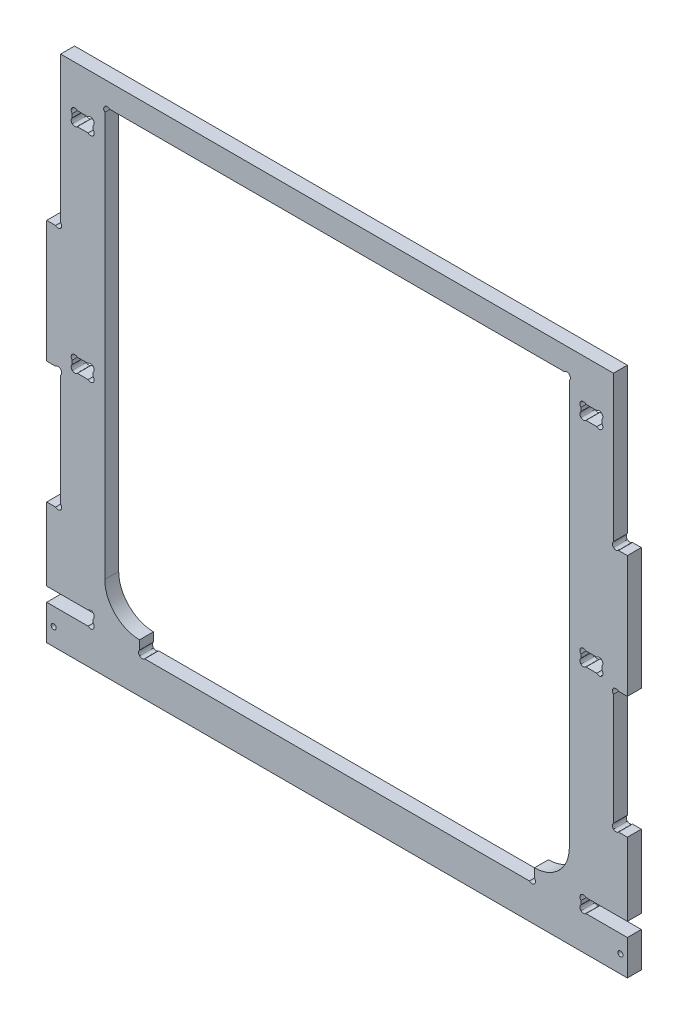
ISO-10303-21;
HEADER;
FILE_DESCRIPTION(('STEP AP214'),'2;1');
FILE_NAME('part.step','',(''),(''),'','','');
FILE_SCHEMA(('AUTOMOTIVE_DESIGN { 1 0 10303 214 1 1 1 1 }'));
ENDSEC;
DATA;
#1=APPLICATION_CONTEXT('core data for automotive mechanical design processes');
#2=APPLICATION_PROTOCOL_DEFINITION('international standard','automotive_design',2000,#1);
#3=PRODUCT_CONTEXT('',#1,'mechanical');
#4=PRODUCT('Part','Part','',(#3));
#5=PRODUCT_RELATED_PRODUCT_CATEGORY('part','',(#4));
#6=PRODUCT_DEFINITION_FORMATION('','',#4);
#7=PRODUCT_DEFINITION_CONTEXT('part definition',#1,'design');
#8=PRODUCT_DEFINITION('design','',#6,#7);
#9=PRODUCT_DEFINITION_SHAPE('','',#8);
#10=(LENGTH_UNIT() NAMED_UNIT(*) SI_UNIT(.MILLI.,.METRE.));
#11=(NAMED_UNIT(*) PLANE_ANGLE_UNIT() SI_UNIT($,.RADIAN.));
#12=(NAMED_UNIT(*) SI_UNIT($,.STERADIAN.) SOLID_ANGLE_UNIT());
#13=UNCERTAINTY_MEASURE_WITH_UNIT(LENGTH_MEASURE(1.E-05),#10,'distance_accuracy_value','');
#14=(GEOMETRIC_REPRESENTATION_CONTEXT(3) GLOBAL_UNCERTAINTY_ASSIGNED_CONTEXT((#13)) GLOBAL_UNIT_ASSIGNED_CONTEXT((#10,
#11,#12)) REPRESENTATION_CONTEXT('',''));
#15=CARTESIAN_POINT('',(0.,0.,0.));
#16=DIRECTION('',(0.,0.,1.));
#17=DIRECTION('',(1.,0.,0.));
#18=AXIS2_PLACEMENT_3D('',#15,#16,#17);
#19=CARTESIAN_POINT('',(2049.29867370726,0.,6.));
#20=DIRECTION('',(1.,0.,0.));
#21=DIRECTION('',(0.,0.,-1.));
#22=AXIS2_PLACEMENT_3D('',#19,#20,#21);
#23=PLANE('',#22);
#24=DIRECTION('',(0.,-1.,0.));
#25=VECTOR('',#24,1.);
#26=CARTESIAN_POINT('',(2049.29867370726,0.,6.));
#27=LINE('',#26,#25);
#28=CARTESIAN_POINT('',(2049.29867370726,-193.265279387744,6.));
#29=VERTEX_POINT('',#28);
#30=CARTESIAN_POINT('',(2049.29867370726,-208.365274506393,6.));
#31=VERTEX_POINT('',#30);
#32=EDGE_CURVE('E746',#29,#31,#27,.T.);
#33=ORIENTED_EDGE('',*,*,#32,.F.);
#34=DIRECTION('',(0.,0.,-1.));
#35=VECTOR('',#34,1.);
#36=CARTESIAN_POINT('',(2049.29867370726,-193.265279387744,6.));
#37=LINE('',#36,#35);
#38=CARTESIAN_POINT('',(2049.29867370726,-193.265279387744,0.));
#39=VERTEX_POINT('',#38);
#40=EDGE_CURVE('E736',#29,#39,#37,.T.);
#41=ORIENTED_EDGE('',*,*,#40,.T.);
#42=DIRECTION('',(0.,-1.,0.));
#43=VECTOR('',#42,1.);
#44=CARTESIAN_POINT('',(2049.29867370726,0.,0.));
#45=LINE('',#44,#43);
#46=CARTESIAN_POINT('',(2049.29867370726,-208.365274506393,0.));
#47=VERTEX_POINT('',#46);
#48=EDGE_CURVE('E1619',#39,#47,#45,.T.);
#49=ORIENTED_EDGE('',*,*,#48,.T.);
#50=DIRECTION('',(0.,0.,-1.));
#51=VECTOR('',#50,1.);
#52=CARTESIAN_POINT('',(2049.29867370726,-208.365274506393,6.));
#53=LINE('',#52,#51);
#54=EDGE_CURVE('E923',#31,#47,#53,.T.);
#55=ORIENTED_EDGE('',*,*,#54,.F.);
#56=EDGE_LOOP('',(#33,#41,#49,#55));
#57=FACE_BOUND('',#56,.T.);
#58=ADVANCED_FACE('F36',(#57),#23,.F.);
#59=CARTESIAN_POINT('',(2299.29865940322,0.,6.));
#60=DIRECTION('',(-1.,0.,0.));
#61=DIRECTION('',(0.,0.,1.));
#62=AXIS2_PLACEMENT_3D('',#59,#60,#61);
#63=PLANE('',#62);
#64=DIRECTION('',(0.,1.,0.));
#65=VECTOR('',#64,1.);
#66=CARTESIAN_POINT('',(2299.29865940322,0.,6.));
#67=LINE('',#66,#65);
#68=CARTESIAN_POINT('',(2299.29865940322,-187.265279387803,6.));
#69=VERTEX_POINT('',#68);
#70=CARTESIAN_POINT('',(2299.29865940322,-155.865270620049,6.));
#71=VERTEX_POINT('',#70);
#72=EDGE_CURVE('E748',#69,#71,#67,.T.);
#73=ORIENTED_EDGE('',*,*,#72,.F.);
#74=DIRECTION('',(0.,0.,-1.));
#75=VECTOR('',#74,1.);
#76=CARTESIAN_POINT('',(2299.29865940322,-187.265279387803,6.));
#77=LINE('',#76,#75);
#78=CARTESIAN_POINT('',(2299.29865940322,-187.265279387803,0.));
#79=VERTEX_POINT('',#78);
#80=EDGE_CURVE('E1132',#69,#79,#77,.T.);
#81=ORIENTED_EDGE('',*,*,#80,.T.);
#82=DIRECTION('',(0.,1.,0.));
#83=VECTOR('',#82,1.);
#84=CARTESIAN_POINT('',(2299.29865940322,0.,0.));
#85=LINE('',#84,#83);
#86=CARTESIAN_POINT('',(2299.29865940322,-155.865270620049,0.));
#87=VERTEX_POINT('',#86);
#88=EDGE_CURVE('E1623',#79,#87,#85,.T.);
#89=ORIENTED_EDGE('',*,*,#88,.T.);
#90=DIRECTION('',(0.,0.,-1.));
#91=VECTOR('',#90,1.);
#92=CARTESIAN_POINT('',(2299.29865940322,-155.865270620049,6.));
#93=LINE('',#92,#91);
#94=EDGE_CURVE('E1753',#71,#87,#93,.T.);
#95=ORIENTED_EDGE('',*,*,#94,.F.);
#96=EDGE_LOOP('',(#73,#81,#89,#95));
#97=FACE_BOUND('',#96,.T.);
#98=ADVANCED_FACE('F787',(#97),#63,.F.);
#99=CARTESIAN_POINT('',(2279.29866675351,-97.5073104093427,6.));
#100=CARTESIAN_POINT('',(2278.69335410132,-96.9019977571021,6.));
#101=CARTESIAN_POINT('',(2278.69335410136,-95.9205920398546,6.));
#102=CARTESIAN_POINT('',(2279.2986667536,-95.3152793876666,6.));
#103=B_SPLINE_CURVE_WITH_KNOTS('',3,(#99,#100,#101,#102),.UNSPECIFIED.,.F.,.F.,(4,4),(10.,11.),.UNSPECIFIED.);
#104=DIRECTION('',(0.,0.,-1.));
#105=VECTOR('',#104,1.);
#106=SURFACE_OF_LINEAR_EXTRUSION('',#103,#105);
#107=CARTESIAN_POINT('',(2279.29866675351,-97.5073104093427,0.));
#108=CARTESIAN_POINT('',(2278.69335410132,-96.9019977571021,0.));
#109=CARTESIAN_POINT('',(2278.69335410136,-95.9205920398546,0.));
#110=CARTESIAN_POINT('',(2279.2986667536,-95.3152793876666,0.));
#111=B_SPLINE_CURVE_WITH_KNOTS('',3,(#107,#108,#109,#110),.UNSPECIFIED.,.F.,.F.,(4,4),(10.,11.),.UNSPECIFIED.);
#112=CARTESIAN_POINT('',(2279.29866675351,-97.5073104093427,0.));
#113=VERTEX_POINT('',#112);
#114=CARTESIAN_POINT('',(2279.2986667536,-95.3152793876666,0.));
#115=VERTEX_POINT('',#114);
#116=EDGE_CURVE('E1645',#113,#115,#111,.T.);
#117=ORIENTED_EDGE('',*,*,#116,.T.);
#118=DIRECTION('',(0.,0.,-1.));
#119=VECTOR('',#118,1.);
#120=CARTESIAN_POINT('',(2279.2986667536,-95.3152793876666,6.));
#121=LINE('',#120,#119);
#122=CARTESIAN_POINT('',(2279.2986667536,-95.3152793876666,6.));
#123=VERTEX_POINT('',#122);
#124=EDGE_CURVE('E11',#123,#115,#121,.T.);
#125=ORIENTED_EDGE('',*,*,#124,.F.);
#126=CARTESIAN_POINT('',(2279.29866675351,-97.5073104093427,6.));
#127=VERTEX_POINT('',#126);
#128=EDGE_CURVE('E1897',#127,#123,#103,.T.);
#129=ORIENTED_EDGE('',*,*,#128,.F.);
#130=DIRECTION('',(0.,0.,-1.));
#131=VECTOR('',#130,1.);
#132=CARTESIAN_POINT('',(2279.29866675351,-97.5073104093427,6.));
#133=LINE('',#132,#131);
#134=EDGE_CURVE('E974',#127,#113,#133,.T.);
#135=ORIENTED_EDGE('',*,*,#134,.T.);
#136=EDGE_LOOP('',(#117,#125,#129,#135));
#137=FACE_BOUND('',#136,.T.);
#138=ADVANCED_FACE('F1856',(#137),#106,.F.);
#139=CARTESIAN_POINT('',(2279.2986667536,-95.3152793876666,6.));
#140=CARTESIAN_POINT('',(2279.90397940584,-94.7099667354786,6.));
#141=CARTESIAN_POINT('',(2280.88538512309,-94.709966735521,6.));
#142=CARTESIAN_POINT('',(2281.49069777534,-95.3152793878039,6.));
#143=B_SPLINE_CURVE_WITH_KNOTS('',3,(#139,#140,#141,#142),.UNSPECIFIED.,.F.,.F.,(4,4),(11.,12.),.UNSPECIFIED.);
#144=DIRECTION('',(0.,0.,-1.));
#145=VECTOR('',#144,1.);
#146=SURFACE_OF_LINEAR_EXTRUSION('',#143,#145);
#147=CARTESIAN_POINT('',(2279.2986667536,-95.3152793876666,0.));
#148=CARTESIAN_POINT('',(2279.90397940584,-94.7099667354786,0.));
#149=CARTESIAN_POINT('',(2280.88538512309,-94.709966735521,0.));
#150=CARTESIAN_POINT('',(2281.49069777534,-95.3152793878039,0.));
#151=B_SPLINE_CURVE_WITH_KNOTS('',3,(#147,#148,#149,#150),.UNSPECIFIED.,.F.,.F.,(4,4),(11.,12.),.UNSPECIFIED.);
#152=CARTESIAN_POINT('',(2281.49069777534,-95.3152793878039,0.));
#153=VERTEX_POINT('',#152);
#154=EDGE_CURVE('E1650',#115,#153,#151,.T.);
#155=ORIENTED_EDGE('',*,*,#154,.T.);
#156=DIRECTION('',(0.,0.,-1.));
#157=VECTOR('',#156,1.);
#158=CARTESIAN_POINT('',(2281.49069777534,-95.3152793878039,6.));
#159=LINE('',#158,#157);
#160=CARTESIAN_POINT('',(2281.49069777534,-95.3152793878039,6.));
#161=VERTEX_POINT('',#160);
#162=EDGE_CURVE('E46',#161,#153,#159,.T.);
#163=ORIENTED_EDGE('',*,*,#162,.F.);
#164=EDGE_CURVE('E1899',#123,#161,#143,.T.);
#165=ORIENTED_EDGE('',*,*,#164,.F.);
#166=ORIENTED_EDGE('',*,*,#124,.T.);
#167=EDGE_LOOP('',(#155,#163,#165,#166));
#168=FACE_BOUND('',#167,.T.);
#169=ADVANCED_FACE('F1861',(#168),#146,.F.);
#170=CARTESIAN_POINT('',(0.,-95.3152793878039,6.));
#171=DIRECTION('',(0.,1.,0.));
#172=DIRECTION('',(0.,0.,1.));
#173=AXIS2_PLACEMENT_3D('',#170,#171,#172);
#174=PLANE('',#173);
#175=DIRECTION('',(1.,0.,0.));
#176=VECTOR('',#175,1.);
#177=CARTESIAN_POINT('',(0.,-95.3152793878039,0.));
#178=LINE('',#177,#176);
#179=CARTESIAN_POINT('',(2286.10663573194,-95.3152793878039,0.));
#180=VERTEX_POINT('',#179);
#181=EDGE_CURVE('E1657',#153,#180,#178,.T.);
#182=ORIENTED_EDGE('',*,*,#181,.T.);
#183=DIRECTION('',(0.,0.,-1.));
#184=VECTOR('',#183,1.);
#185=CARTESIAN_POINT('',(2286.10663573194,-95.3152793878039,6.));
#186=LINE('',#185,#184);
#187=CARTESIAN_POINT('',(2286.10663573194,-95.3152793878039,6.));
#188=VERTEX_POINT('',#187);
#189=EDGE_CURVE('E1737',#188,#180,#186,.T.);
#190=ORIENTED_EDGE('',*,*,#189,.F.);
#191=DIRECTION('',(1.,0.,0.));
#192=VECTOR('',#191,1.);
#193=CARTESIAN_POINT('',(0.,-95.3152793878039,6.));
#194=LINE('',#193,#192);
#195=EDGE_CURVE('E2692',#161,#188,#194,.T.);
#196=ORIENTED_EDGE('',*,*,#195,.F.);
#197=ORIENTED_EDGE('',*,*,#162,.T.);
#198=EDGE_LOOP('',(#182,#190,#196,#197));
#199=FACE_BOUND('',#198,.T.);
#200=ADVANCED_FACE('F2713',(#199),#174,.F.);
#201=CARTESIAN_POINT('',(2286.10663573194,-95.3152793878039,6.));
#202=CARTESIAN_POINT('',(2286.71194838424,-94.7099667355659,6.));
#203=CARTESIAN_POINT('',(2287.69335410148,-94.7099667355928,6.));
#204=CARTESIAN_POINT('',(2288.29866675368,-95.3152793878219,6.));
#205=B_SPLINE_CURVE_WITH_KNOTS('',3,(#201,#202,#203,#204),.UNSPECIFIED.,.F.,.F.,(4,4),(1.,2.),.UNSPECIFIED.);
#206=DIRECTION('',(0.,0.,-1.));
#207=VECTOR('',#206,1.);
#208=SURFACE_OF_LINEAR_EXTRUSION('',#205,#207);
#209=CARTESIAN_POINT('',(2286.10663573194,-95.3152793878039,0.));
#210=CARTESIAN_POINT('',(2286.71194838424,-94.7099667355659,0.));
#211=CARTESIAN_POINT('',(2287.69335410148,-94.7099667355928,0.));
#212=CARTESIAN_POINT('',(2288.29866675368,-95.3152793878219,0.));
#213=B_SPLINE_CURVE_WITH_KNOTS('',3,(#209,#210,#211,#212),.UNSPECIFIED.,.F.,.F.,(4,4),(1.,2.),.UNSPECIFIED.);
#214=CARTESIAN_POINT('',(2288.29866675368,-95.3152793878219,0.));
#215=VERTEX_POINT('',#214);
#216=EDGE_CURVE('E1662',#180,#215,#213,.T.);
#217=ORIENTED_EDGE('',*,*,#216,.T.);
#218=DIRECTION('',(0.,0.,-1.));
#219=VECTOR('',#218,1.);
#220=CARTESIAN_POINT('',(2288.29866675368,-95.3152793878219,6.));
#221=LINE('',#220,#219);
#222=CARTESIAN_POINT('',(2288.29866675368,-95.3152793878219,6.));
#223=VERTEX_POINT('',#222);
#224=EDGE_CURVE('E1734',#223,#215,#221,.T.);
#225=ORIENTED_EDGE('',*,*,#224,.F.);
#226=EDGE_CURVE('E2693',#188,#223,#205,.T.);
#227=ORIENTED_EDGE('',*,*,#226,.F.);
#228=ORIENTED_EDGE('',*,*,#189,.T.);
#229=EDGE_LOOP('',(#217,#225,#227,#228));
#230=FACE_BOUND('',#229,.T.);
#231=ADVANCED_FACE('F2709',(#230),#208,.F.);
#232=CARTESIAN_POINT('',(2288.29866675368,-95.3152793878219,6.));
#233=CARTESIAN_POINT('',(2288.90397940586,-95.920592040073,6.));
#234=CARTESIAN_POINT('',(2288.9039794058,-96.9019977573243,6.));
#235=CARTESIAN_POINT('',(2288.29866675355,-97.5073104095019,6.));
#236=B_SPLINE_CURVE_WITH_KNOTS('',3,(#232,#233,#234,#235),.UNSPECIFIED.,.F.,.F.,(4,4),(2.,3.),.UNSPECIFIED.);
#237=DIRECTION('',(0.,0.,-1.));
#238=VECTOR('',#237,1.);
#239=SURFACE_OF_LINEAR_EXTRUSION('',#236,#238);
#240=CARTESIAN_POINT('',(2288.29866675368,-95.3152793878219,0.));
#241=CARTESIAN_POINT('',(2288.90397940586,-95.920592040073,0.));
#242=CARTESIAN_POINT('',(2288.9039794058,-96.9019977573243,0.));
#243=CARTESIAN_POINT('',(2288.29866675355,-97.5073104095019,0.));
#244=B_SPLINE_CURVE_WITH_KNOTS('',3,(#240,#241,#242,#243),.UNSPECIFIED.,.F.,.F.,(4,4),(2.,3.),.UNSPECIFIED.);
#245=CARTESIAN_POINT('',(2288.29866675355,-97.5073104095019,0.));
#246=VERTEX_POINT('',#245);
#247=EDGE_CURVE('E1666',#215,#246,#244,.T.);
#248=ORIENTED_EDGE('',*,*,#247,.T.);
#249=DIRECTION('',(0.,0.,-1.));
#250=VECTOR('',#249,1.);
#251=CARTESIAN_POINT('',(2288.29866675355,-97.5073104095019,6.));
#252=LINE('',#251,#250);
#253=CARTESIAN_POINT('',(2288.29866675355,-97.5073104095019,6.));
#254=VERTEX_POINT('',#253);
#255=EDGE_CURVE('E1731',#254,#246,#252,.T.);
#256=ORIENTED_EDGE('',*,*,#255,.F.);
#257=EDGE_CURVE('E2695',#223,#254,#236,.T.);
#258=ORIENTED_EDGE('',*,*,#257,.F.);
#259=ORIENTED_EDGE('',*,*,#224,.T.);
#260=EDGE_LOOP('',(#248,#256,#258,#259));
#261=FACE_BOUND('',#260,.T.);
#262=ADVANCED_FACE('F2712',(#261),#239,.F.);
#263=CARTESIAN_POINT('',(2288.29866675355,0.,6.));
#264=DIRECTION('',(1.,0.,0.));
#265=DIRECTION('',(0.,0.,-1.));
#266=AXIS2_PLACEMENT_3D('',#263,#264,#265);
#267=PLANE('',#266);
#268=DIRECTION('',(0.,-1.,0.));
#269=VECTOR('',#268,1.);
#270=CARTESIAN_POINT('',(2288.29866675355,0.,0.));
#271=LINE('',#270,#269);
#272=CARTESIAN_POINT('',(2288.29866675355,-99.123248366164,0.));
#273=VERTEX_POINT('',#272);
#274=EDGE_CURVE('E1673',#246,#273,#271,.T.);
#275=ORIENTED_EDGE('',*,*,#274,.T.);
#276=DIRECTION('',(0.,0.,-1.));
#277=VECTOR('',#276,1.);
#278=CARTESIAN_POINT('',(2288.29866675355,-99.123248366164,6.));
#279=LINE('',#278,#277);
#280=CARTESIAN_POINT('',(2288.29866675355,-99.123248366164,6.));
#281=VERTEX_POINT('',#280);
#282=EDGE_CURVE('E1728',#281,#273,#279,.T.);
#283=ORIENTED_EDGE('',*,*,#282,.F.);
#284=DIRECTION('',(0.,-1.,0.));
#285=VECTOR('',#284,1.);
#286=CARTESIAN_POINT('',(2288.29866675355,0.,6.));
#287=LINE('',#286,#285);
#288=EDGE_CURVE('E2735',#254,#281,#287,.T.);
#289=ORIENTED_EDGE('',*,*,#288,.F.);
#290=ORIENTED_EDGE('',*,*,#255,.T.);
#291=EDGE_LOOP('',(#275,#283,#289,#290));
#292=FACE_BOUND('',#291,.T.);
#293=ADVANCED_FACE('F2733',(#292),#267,.F.);
#294=CARTESIAN_POINT('',(2288.29866675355,-99.123248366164,6.));
#295=CARTESIAN_POINT('',(2288.90397940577,-99.7285610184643,6.));
#296=CARTESIAN_POINT('',(2288.90397940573,-100.709966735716,6.));
#297=CARTESIAN_POINT('',(2288.29866675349,-101.3152793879,6.));
#298=B_SPLINE_CURVE_WITH_KNOTS('',3,(#294,#295,#296,#297),.UNSPECIFIED.,.F.,.F.,(4,4),(4.,5.),.UNSPECIFIED.);
#299=DIRECTION('',(0.,0.,-1.));
#300=VECTOR('',#299,1.);
#301=SURFACE_OF_LINEAR_EXTRUSION('',#298,#300);
#302=CARTESIAN_POINT('',(2288.29866675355,-99.123248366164,0.));
#303=CARTESIAN_POINT('',(2288.90397940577,-99.7285610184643,0.));
#304=CARTESIAN_POINT('',(2288.90397940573,-100.709966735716,0.));
#305=CARTESIAN_POINT('',(2288.29866675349,-101.3152793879,0.));
#306=B_SPLINE_CURVE_WITH_KNOTS('',3,(#302,#303,#304,#305),.UNSPECIFIED.,.F.,.F.,(4,4),(4.,5.),.UNSPECIFIED.);
#307=CARTESIAN_POINT('',(2288.29866675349,-101.3152793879,0.));
#308=VERTEX_POINT('',#307);
#309=EDGE_CURVE('E1678',#273,#308,#306,.T.);
#310=ORIENTED_EDGE('',*,*,#309,.T.);
#311=DIRECTION('',(0.,0.,-1.));
#312=VECTOR('',#311,1.);
#313=CARTESIAN_POINT('',(2288.29866675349,-101.3152793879,6.));
#314=LINE('',#313,#312);
#315=CARTESIAN_POINT('',(2288.29866675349,-101.3152793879,6.));
#316=VERTEX_POINT('',#315);
#317=EDGE_CURVE('E1725',#316,#308,#314,.T.);
#318=ORIENTED_EDGE('',*,*,#317,.F.);
#319=EDGE_CURVE('E2737',#281,#316,#298,.T.);
#320=ORIENTED_EDGE('',*,*,#319,.F.);
#321=ORIENTED_EDGE('',*,*,#282,.T.);
#322=EDGE_LOOP('',(#310,#318,#320,#321));
#323=FACE_BOUND('',#322,.T.);
#324=ADVANCED_FACE('F2751',(#323),#301,.F.);
#325=CARTESIAN_POINT('',(2288.29866675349,-101.3152793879,6.));
#326=CARTESIAN_POINT('',(2287.69335410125,-101.920592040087,6.));
#327=CARTESIAN_POINT('',(2286.71194838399,-101.920592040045,6.));
#328=CARTESIAN_POINT('',(2286.1066357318,-101.315279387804,6.));
#329=B_SPLINE_CURVE_WITH_KNOTS('',3,(#325,#326,#327,#328),.UNSPECIFIED.,.F.,.F.,(4,4),(5.,6.),.UNSPECIFIED.);
#330=DIRECTION('',(0.,0.,-1.));
#331=VECTOR('',#330,1.);
#332=SURFACE_OF_LINEAR_EXTRUSION('',#329,#331);
#333=CARTESIAN_POINT('',(2288.29866675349,-101.3152793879,0.));
#334=CARTESIAN_POINT('',(2287.69335410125,-101.920592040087,0.));
#335=CARTESIAN_POINT('',(2286.71194838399,-101.920592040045,0.));
#336=CARTESIAN_POINT('',(2286.1066357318,-101.315279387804,0.));
#337=B_SPLINE_CURVE_WITH_KNOTS('',3,(#333,#334,#335,#336),.UNSPECIFIED.,.F.,.F.,(4,4),(5.,6.),.UNSPECIFIED.);
#338=CARTESIAN_POINT('',(2286.1066357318,-101.315279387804,0.));
#339=VERTEX_POINT('',#338);
#340=EDGE_CURVE('E1682',#308,#339,#337,.T.);
#341=ORIENTED_EDGE('',*,*,#340,.T.);
#342=DIRECTION('',(0.,0.,-1.));
#343=VECTOR('',#342,1.);
#344=CARTESIAN_POINT('',(2286.1066357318,-101.315279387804,6.));
#345=LINE('',#344,#343);
#346=CARTESIAN_POINT('',(2286.1066357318,-101.315279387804,6.));
#347=VERTEX_POINT('',#346);
#348=EDGE_CURVE('E1722',#347,#339,#345,.T.);
#349=ORIENTED_EDGE('',*,*,#348,.F.);
#350=EDGE_CURVE('E2738',#316,#347,#329,.T.);
#351=ORIENTED_EDGE('',*,*,#350,.F.);
#352=ORIENTED_EDGE('',*,*,#317,.T.);
#353=EDGE_LOOP('',(#341,#349,#351,#352));
#354=FACE_BOUND('',#353,.T.);
#355=ADVANCED_FACE('F2754',(#354),#332,.F.);
#356=CARTESIAN_POINT('',(0.,-101.315279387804,6.));
#357=DIRECTION('',(0.,-1.,0.));
#358=DIRECTION('',(0.,0.,-1.));
#359=AXIS2_PLACEMENT_3D('',#356,#357,#358);
#360=PLANE('',#359);
#361=DIRECTION('',(-1.,0.,0.));
#362=VECTOR('',#361,1.);
#363=CARTESIAN_POINT('',(0.,-101.315279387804,0.));
#364=LINE('',#363,#362);
#365=CARTESIAN_POINT('',(2281.49069777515,-101.315279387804,0.));
#366=VERTEX_POINT('',#365);
#367=EDGE_CURVE('E1689',#339,#366,#364,.T.);
#368=ORIENTED_EDGE('',*,*,#367,.T.);
#369=DIRECTION('',(0.,0.,-1.));
#370=VECTOR('',#369,1.);
#371=CARTESIAN_POINT('',(2281.49069777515,-101.315279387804,6.));
#372=LINE('',#371,#370);
#373=CARTESIAN_POINT('',(2281.49069777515,-101.315279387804,6.));
#374=VERTEX_POINT('',#373);
#375=EDGE_CURVE('E1719',#374,#366,#372,.T.);
#376=ORIENTED_EDGE('',*,*,#375,.F.);
#377=DIRECTION('',(-1.,0.,0.));
#378=VECTOR('',#377,1.);
#379=CARTESIAN_POINT('',(0.,-101.315279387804,6.));
#380=LINE('',#379,#378);
#381=EDGE_CURVE('E3397',#347,#374,#380,.T.);
#382=ORIENTED_EDGE('',*,*,#381,.F.);
#383=ORIENTED_EDGE('',*,*,#348,.T.);
#384=EDGE_LOOP('',(#368,#376,#382,#383));
#385=FACE_BOUND('',#384,.T.);
#386=ADVANCED_FACE('F3367',(#385),#360,.F.);
#387=CARTESIAN_POINT('',(2281.49069777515,-101.315279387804,6.));
#388=CARTESIAN_POINT('',(2280.88538512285,-101.920592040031,6.));
#389=CARTESIAN_POINT('',(2279.9039794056,-101.920592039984,6.));
#390=CARTESIAN_POINT('',(2279.29866675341,-101.315279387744,6.));
#391=B_SPLINE_CURVE_WITH_KNOTS('',3,(#387,#388,#389,#390),.UNSPECIFIED.,.F.,.F.,(4,4),(7.,8.),.UNSPECIFIED.);
#392=DIRECTION('',(0.,0.,-1.));
#393=VECTOR('',#392,1.);
#394=SURFACE_OF_LINEAR_EXTRUSION('',#391,#393);
#395=CARTESIAN_POINT('',(2281.49069777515,-101.315279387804,0.));
#396=CARTESIAN_POINT('',(2280.88538512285,-101.920592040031,0.));
#397=CARTESIAN_POINT('',(2279.9039794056,-101.920592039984,0.));
#398=CARTESIAN_POINT('',(2279.29866675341,-101.315279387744,0.));
#399=B_SPLINE_CURVE_WITH_KNOTS('',3,(#395,#396,#397,#398),.UNSPECIFIED.,.F.,.F.,(4,4),(7.,8.),.UNSPECIFIED.);
#400=CARTESIAN_POINT('',(2279.29866675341,-101.315279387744,0.));
#401=VERTEX_POINT('',#400);
#402=EDGE_CURVE('E1694',#366,#401,#399,.T.);
#403=ORIENTED_EDGE('',*,*,#402,.T.);
#404=DIRECTION('',(0.,0.,-1.));
#405=VECTOR('',#404,1.);
#406=CARTESIAN_POINT('',(2279.29866675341,-101.315279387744,6.));
#407=LINE('',#406,#405);
#408=CARTESIAN_POINT('',(2279.29866675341,-101.315279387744,6.));
#409=VERTEX_POINT('',#408);
#410=EDGE_CURVE('E1716',#409,#401,#407,.T.);
#411=ORIENTED_EDGE('',*,*,#410,.F.);
#412=EDGE_CURVE('E2673',#374,#409,#391,.T.);
#413=ORIENTED_EDGE('',*,*,#412,.F.);
#414=ORIENTED_EDGE('',*,*,#375,.T.);
#415=EDGE_LOOP('',(#403,#411,#413,#414));
#416=FACE_BOUND('',#415,.T.);
#417=ADVANCED_FACE('F2665',(#416),#394,.F.);
#418=CARTESIAN_POINT('',(2279.29866675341,-101.315279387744,6.));
#419=CARTESIAN_POINT('',(2278.69335410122,-100.709966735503,6.));
#420=CARTESIAN_POINT('',(2278.69335410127,-99.7285610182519,6.));
#421=CARTESIAN_POINT('',(2279.29866675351,-99.1232483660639,6.));
#422=B_SPLINE_CURVE_WITH_KNOTS('',3,(#418,#419,#420,#421),.UNSPECIFIED.,.F.,.F.,(4,4),(8.,9.),.UNSPECIFIED.);
#423=DIRECTION('',(0.,0.,-1.));
#424=VECTOR('',#423,1.);
#425=SURFACE_OF_LINEAR_EXTRUSION('',#422,#424);
#426=CARTESIAN_POINT('',(2279.29866675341,-101.315279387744,0.));
#427=CARTESIAN_POINT('',(2278.69335410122,-100.709966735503,0.));
#428=CARTESIAN_POINT('',(2278.69335410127,-99.7285610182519,0.));
#429=CARTESIAN_POINT('',(2279.29866675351,-99.1232483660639,0.));
#430=B_SPLINE_CURVE_WITH_KNOTS('',3,(#426,#427,#428,#429),.UNSPECIFIED.,.F.,.F.,(4,4),(8.,9.),.UNSPECIFIED.);
#431=CARTESIAN_POINT('',(2279.29866675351,-99.1232483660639,0.));
#432=VERTEX_POINT('',#431);
#433=EDGE_CURVE('E1698',#401,#432,#430,.T.);
#434=ORIENTED_EDGE('',*,*,#433,.T.);
#435=DIRECTION('',(0.,0.,-1.));
#436=VECTOR('',#435,1.);
#437=CARTESIAN_POINT('',(2279.29866675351,-99.1232483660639,6.));
#438=LINE('',#437,#436);
#439=CARTESIAN_POINT('',(2279.29866675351,-99.1232483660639,6.));
#440=VERTEX_POINT('',#439);
#441=EDGE_CURVE('E1713',#440,#432,#438,.T.);
#442=ORIENTED_EDGE('',*,*,#441,.F.);
#443=EDGE_CURVE('E2669',#409,#440,#422,.T.);
#444=ORIENTED_EDGE('',*,*,#443,.F.);
#445=ORIENTED_EDGE('',*,*,#410,.T.);
#446=EDGE_LOOP('',(#434,#442,#444,#445));
#447=FACE_BOUND('',#446,.T.);
#448=ADVANCED_FACE('F2468',(#447),#425,.F.);
#449=CARTESIAN_POINT('',(2293.29865957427,-105.557316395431,6.));
#450=CARTESIAN_POINT('',(2292.69335629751,-104.951970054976,6.));
#451=CARTESIAN_POINT('',(2292.69335629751,-103.97059154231,6.));
#452=CARTESIAN_POINT('',(2293.29865957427,-103.365288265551,6.));
#453=B_SPLINE_CURVE_WITH_KNOTS('',3,(#449,#450,#451,#452),.UNSPECIFIED.,.F.,.F.,(4,4),(32.,33.),.UNSPECIFIED.);
#454=DIRECTION('',(0.,0.,-1.));
#455=VECTOR('',#454,1.);
#456=SURFACE_OF_LINEAR_EXTRUSION('',#453,#455);
#457=CARTESIAN_POINT('',(2293.29865957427,-105.557316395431,0.));
#458=CARTESIAN_POINT('',(2292.69335629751,-104.951970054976,0.));
#459=CARTESIAN_POINT('',(2292.69335629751,-103.97059154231,0.));
#460=CARTESIAN_POINT('',(2293.29865957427,-103.365288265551,0.));
#461=B_SPLINE_CURVE_WITH_KNOTS('',3,(#457,#458,#459,#460),.UNSPECIFIED.,.F.,.F.,(4,4),(32.,33.),.UNSPECIFIED.);
#462=CARTESIAN_POINT('',(2293.29865957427,-105.557316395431,0.));
#463=VERTEX_POINT('',#462);
#464=CARTESIAN_POINT('',(2293.29865957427,-103.365288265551,0.));
#465=VERTEX_POINT('',#464);
#466=EDGE_CURVE('E1531',#463,#465,#461,.T.);
#467=ORIENTED_EDGE('',*,*,#466,.T.);
#468=DIRECTION('',(0.,0.,-1.));
#469=VECTOR('',#468,1.);
#470=CARTESIAN_POINT('',(2293.29865957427,-103.365288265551,6.));
#471=LINE('',#470,#469);
#472=CARTESIAN_POINT('',(2293.29865957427,-103.365288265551,6.));
#473=VERTEX_POINT('',#472);
#474=EDGE_CURVE('E971',#473,#465,#471,.T.);
#475=ORIENTED_EDGE('',*,*,#474,.F.);
#476=CARTESIAN_POINT('',(2293.29865957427,-105.557316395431,6.));
#477=VERTEX_POINT('',#476);
#478=EDGE_CURVE('E727',#477,#473,#453,.T.);
#479=ORIENTED_EDGE('',*,*,#478,.F.);
#480=DIRECTION('',(0.,0.,-1.));
#481=VECTOR('',#480,1.);
#482=CARTESIAN_POINT('',(2293.29865957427,-105.557316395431,6.));
#483=LINE('',#482,#481);
#484=EDGE_CURVE('E988',#477,#463,#483,.T.);
#485=ORIENTED_EDGE('',*,*,#484,.T.);
#486=EDGE_LOOP('',(#467,#475,#479,#485));
#487=FACE_BOUND('',#486,.T.);
#488=ADVANCED_FACE('F2464',(#487),#456,.F.);
#489=CARTESIAN_POINT('',(2293.29865957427,-103.365288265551,6.));
#490=CARTESIAN_POINT('',(2293.90398438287,-102.759941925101,6.));
#491=CARTESIAN_POINT('',(2294.88538442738,-102.759941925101,6.));
#492=CARTESIAN_POINT('',(2295.49068770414,-103.365288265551,6.));
#493=B_SPLINE_CURVE_WITH_KNOTS('',3,(#489,#490,#491,#492),.UNSPECIFIED.,.F.,.F.,(4,4),(33.,34.),.UNSPECIFIED.);
#494=DIRECTION('',(0.,0.,-1.));
#495=VECTOR('',#494,1.);
#496=SURFACE_OF_LINEAR_EXTRUSION('',#493,#495);
#497=CARTESIAN_POINT('',(2293.29865957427,-103.365288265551,0.));
#498=CARTESIAN_POINT('',(2293.90398438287,-102.759941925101,0.));
#499=CARTESIAN_POINT('',(2294.88538442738,-102.759941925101,0.));
#500=CARTESIAN_POINT('',(2295.49068770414,-103.365288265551,0.));
#501=B_SPLINE_CURVE_WITH_KNOTS('',3,(#497,#498,#499,#500),.UNSPECIFIED.,.F.,.F.,(4,4),(33.,34.),.UNSPECIFIED.);
#502=CARTESIAN_POINT('',(2295.49068770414,-103.365288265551,0.));
#503=VERTEX_POINT('',#502);
#504=EDGE_CURVE('E1536',#465,#503,#501,.T.);
#505=ORIENTED_EDGE('',*,*,#504,.T.);
#506=DIRECTION('',(0.,0.,-1.));
#507=VECTOR('',#506,1.);
#508=CARTESIAN_POINT('',(2295.49068770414,-103.365288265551,6.));
#509=LINE('',#508,#507);
#510=CARTESIAN_POINT('',(2295.49068770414,-103.365288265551,6.));
#511=VERTEX_POINT('',#510);
#512=EDGE_CURVE('E968',#511,#503,#509,.T.);
#513=ORIENTED_EDGE('',*,*,#512,.F.);
#514=EDGE_CURVE('E2455',#473,#511,#493,.T.);
#515=ORIENTED_EDGE('',*,*,#514,.F.);
#516=ORIENTED_EDGE('',*,*,#474,.T.);
#517=EDGE_LOOP('',(#505,#513,#515,#516));
#518=FACE_BOUND('',#517,.T.);
#519=ADVANCED_FACE('F2467',(#518),#496,.F.);
#520=CARTESIAN_POINT('',(0.,-103.365288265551,6.));
#521=DIRECTION('',(0.,1.,0.));
#522=DIRECTION('',(0.,0.,1.));
#523=AXIS2_PLACEMENT_3D('',#520,#521,#522);
#524=PLANE('',#523);
#525=DIRECTION('',(1.,0.,0.));
#526=VECTOR('',#525,1.);
#527=CARTESIAN_POINT('',(0.,-103.365288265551,0.));
#528=LINE('',#527,#526);
#529=CARTESIAN_POINT('',(2299.29865940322,-103.365288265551,0.));
#530=VERTEX_POINT('',#529);
#531=EDGE_CURVE('E1543',#503,#530,#528,.T.);
#532=ORIENTED_EDGE('',*,*,#531,.T.);
#533=DIRECTION('',(0.,0.,-1.));
#534=VECTOR('',#533,1.);
#535=CARTESIAN_POINT('',(2299.29865940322,-103.365288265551,6.));
#536=LINE('',#535,#534);
#537=CARTESIAN_POINT('',(2299.29865940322,-103.365288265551,6.));
#538=VERTEX_POINT('',#537);
#539=EDGE_CURVE('E965',#538,#530,#536,.T.);
#540=ORIENTED_EDGE('',*,*,#539,.F.);
#541=DIRECTION('',(1.,0.,0.));
#542=VECTOR('',#541,1.);
#543=CARTESIAN_POINT('',(0.,-103.365288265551,6.));
#544=LINE('',#543,#542);
#545=EDGE_CURVE('E3590',#511,#538,#544,.T.);
#546=ORIENTED_EDGE('',*,*,#545,.F.);
#547=ORIENTED_EDGE('',*,*,#512,.T.);
#548=EDGE_LOOP('',(#532,#540,#546,#547));
#549=FACE_BOUND('',#548,.T.);
#550=ADVANCED_FACE('F2807',(#549),#524,.F.);
#551=CARTESIAN_POINT('',(2299.29865940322,0.,6.));
#552=DIRECTION('',(-1.,0.,0.));
#553=DIRECTION('',(0.,0.,1.));
#554=AXIS2_PLACEMENT_3D('',#551,#552,#553);
#555=PLANE('',#554);
#556=DIRECTION('',(0.,1.,0.));
#557=VECTOR('',#556,1.);
#558=CARTESIAN_POINT('',(2299.29865940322,0.,0.));
#559=LINE('',#558,#557);
#560=CARTESIAN_POINT('',(2299.29865940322,-50.8652628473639,0.));
#561=VERTEX_POINT('',#560);
#562=EDGE_CURVE('E1548',#530,#561,#559,.T.);
#563=ORIENTED_EDGE('',*,*,#562,.T.);
#564=DIRECTION('',(0.,0.,-1.));
#565=VECTOR('',#564,1.);
#566=CARTESIAN_POINT('',(2299.29865940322,-50.8652628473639,6.));
#567=LINE('',#566,#565);
#568=CARTESIAN_POINT('',(2299.29865940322,-50.8652628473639,6.));
#569=VERTEX_POINT('',#568);
#570=EDGE_CURVE('E962',#569,#561,#567,.T.);
#571=ORIENTED_EDGE('',*,*,#570,.F.);
#572=DIRECTION('',(0.,1.,0.));
#573=VECTOR('',#572,1.);
#574=CARTESIAN_POINT('',(2299.29865940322,0.,6.));
#575=LINE('',#574,#573);
#576=EDGE_CURVE('E3589',#538,#569,#575,.T.);
#577=ORIENTED_EDGE('',*,*,#576,.F.);
#578=ORIENTED_EDGE('',*,*,#539,.T.);
#579=EDGE_LOOP('',(#563,#571,#577,#578));
#580=FACE_BOUND('',#579,.T.);
#581=ADVANCED_FACE('F2816',(#580),#555,.F.);
#582=CARTESIAN_POINT('',(0.,-50.8652628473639,6.));
#583=DIRECTION('',(0.,-1.,0.));
#584=DIRECTION('',(0.,0.,-1.));
#585=AXIS2_PLACEMENT_3D('',#582,#583,#584);
#586=PLANE('',#585);
#587=DIRECTION('',(-1.,0.,0.));
#588=VECTOR('',#587,1.);
#589=CARTESIAN_POINT('',(0.,-50.8652628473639,0.));
#590=LINE('',#589,#588);
#591=CARTESIAN_POINT('',(2295.49068770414,-50.8652628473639,0.));
#592=VERTEX_POINT('',#591);
#593=EDGE_CURVE('E1550',#561,#592,#590,.T.);
#594=ORIENTED_EDGE('',*,*,#593,.T.);
#595=DIRECTION('',(0.,0.,-1.));
#596=VECTOR('',#595,1.);
#597=CARTESIAN_POINT('',(2295.49068770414,-50.8652628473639,6.));
#598=LINE('',#597,#596);
#599=CARTESIAN_POINT('',(2295.49068770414,-50.8652628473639,6.));
#600=VERTEX_POINT('',#599);
#601=EDGE_CURVE('E959',#600,#592,#598,.T.);
#602=ORIENTED_EDGE('',*,*,#601,.F.);
#603=DIRECTION('',(-1.,0.,0.));
#604=VECTOR('',#603,1.);
#605=CARTESIAN_POINT('',(0.,-50.8652628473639,6.));
#606=LINE('',#605,#604);
#607=EDGE_CURVE('E3584',#569,#600,#606,.T.);
#608=ORIENTED_EDGE('',*,*,#607,.F.);
#609=ORIENTED_EDGE('',*,*,#570,.T.);
#610=EDGE_LOOP('',(#594,#602,#608,#609));
#611=FACE_BOUND('',#610,.T.);
#612=ADVANCED_FACE('F2824',(#611),#586,.F.);
#613=CARTESIAN_POINT('',(2295.49068770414,-50.8652628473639,6.));
#614=CARTESIAN_POINT('',(2294.88538442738,-51.4705661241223,6.));
#615=CARTESIAN_POINT('',(2293.90398438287,-51.4705661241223,6.));
#616=CARTESIAN_POINT('',(2293.29865957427,-50.8652628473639,6.));
#617=B_SPLINE_CURVE_WITH_KNOTS('',3,(#613,#614,#615,#616),.UNSPECIFIED.,.F.,.F.,(4,4),(3.,4.),.UNSPECIFIED.);
#618=DIRECTION('',(0.,0.,-1.));
#619=VECTOR('',#618,1.);
#620=SURFACE_OF_LINEAR_EXTRUSION('',#617,#619);
#621=CARTESIAN_POINT('',(2295.49068770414,-50.8652628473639,0.));
#622=CARTESIAN_POINT('',(2294.88538442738,-51.4705661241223,0.));
#623=CARTESIAN_POINT('',(2293.90398438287,-51.4705661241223,0.));
#624=CARTESIAN_POINT('',(2293.29865957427,-50.8652628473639,0.));
#625=B_SPLINE_CURVE_WITH_KNOTS('',3,(#621,#622,#623,#624),.UNSPECIFIED.,.F.,.F.,(4,4),(3.,4.),.UNSPECIFIED.);
#626=CARTESIAN_POINT('',(2293.29865957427,-50.8652628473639,0.));
#627=VERTEX_POINT('',#626);
#628=EDGE_CURVE('E1552',#592,#627,#625,.T.);
#629=ORIENTED_EDGE('',*,*,#628,.T.);
#630=DIRECTION('',(0.,0.,-1.));
#631=VECTOR('',#630,1.);
#632=CARTESIAN_POINT('',(2293.29865957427,-50.8652628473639,6.));
#633=LINE('',#632,#631);
#634=CARTESIAN_POINT('',(2293.29865957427,-50.8652628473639,6.));
#635=VERTEX_POINT('',#634);
#636=EDGE_CURVE('E956',#635,#627,#633,.T.);
#637=ORIENTED_EDGE('',*,*,#636,.F.);
#638=EDGE_CURVE('E3576',#600,#635,#617,.T.);
#639=ORIENTED_EDGE('',*,*,#638,.F.);
#640=ORIENTED_EDGE('',*,*,#601,.T.);
#641=EDGE_LOOP('',(#629,#637,#639,#640));
#642=FACE_BOUND('',#641,.T.);
#643=ADVANCED_FACE('F2833',(#642),#620,.F.);
#644=CARTESIAN_POINT('',(2293.29865957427,-50.8652628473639,6.));
#645=CARTESIAN_POINT('',(2292.69335629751,-50.2599595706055,6.));
#646=CARTESIAN_POINT('',(2292.69335629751,-49.2785379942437,6.));
#647=CARTESIAN_POINT('',(2293.29865957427,-48.6732347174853,6.));
#648=B_SPLINE_CURVE_WITH_KNOTS('',3,(#644,#645,#646,#647),.UNSPECIFIED.,.F.,.F.,(4,4),(4.,5.),.UNSPECIFIED.);
#649=DIRECTION('',(0.,0.,-1.));
#650=VECTOR('',#649,1.);
#651=SURFACE_OF_LINEAR_EXTRUSION('',#648,#650);
#652=CARTESIAN_POINT('',(2293.29865957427,-50.8652628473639,0.));
#653=CARTESIAN_POINT('',(2292.69335629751,-50.2599595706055,0.));
#654=CARTESIAN_POINT('',(2292.69335629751,-49.2785379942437,0.));
#655=CARTESIAN_POINT('',(2293.29865957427,-48.6732347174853,0.));
#656=B_SPLINE_CURVE_WITH_KNOTS('',3,(#652,#653,#654,#655),.UNSPECIFIED.,.F.,.F.,(4,4),(4.,5.),.UNSPECIFIED.);
#657=CARTESIAN_POINT('',(2293.29865957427,-48.6732347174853,0.));
#658=VERTEX_POINT('',#657);
#659=EDGE_CURVE('E1556',#627,#658,#656,.T.);
#660=ORIENTED_EDGE('',*,*,#659,.T.);
#661=DIRECTION('',(0.,0.,-1.));
#662=VECTOR('',#661,1.);
#663=CARTESIAN_POINT('',(2293.29865957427,-48.6732347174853,6.));
#664=LINE('',#663,#662);
#665=CARTESIAN_POINT('',(2293.29865957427,-48.6732347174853,6.));
#666=VERTEX_POINT('',#665);
#667=EDGE_CURVE('E953',#666,#658,#664,.T.);
#668=ORIENTED_EDGE('',*,*,#667,.F.);
#669=EDGE_CURVE('E3571',#635,#666,#648,.T.);
#670=ORIENTED_EDGE('',*,*,#669,.F.);
#671=ORIENTED_EDGE('',*,*,#636,.T.);
#672=EDGE_LOOP('',(#660,#668,#670,#671));
#673=FACE_BOUND('',#672,.T.);
#674=ADVANCED_FACE('F2842',(#673),#651,.F.);
#675=CARTESIAN_POINT('',(2293.29865957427,0.,6.));
#676=DIRECTION('',(-1.,0.,0.));
#677=DIRECTION('',(0.,0.,1.));
#678=AXIS2_PLACEMENT_3D('',#675,#676,#677);
#679=PLANE('',#678);
#680=DIRECTION('',(0.,1.,0.));
#681=VECTOR('',#680,1.);
#682=CARTESIAN_POINT('',(2293.29865957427,0.,0.));
#683=LINE('',#682,#681);
#684=CARTESIAN_POINT('',(2293.29865957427,14.1347317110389,0.));
#685=VERTEX_POINT('',#684);
#686=EDGE_CURVE('E1563',#658,#685,#683,.T.);
#687=ORIENTED_EDGE('',*,*,#686,.T.);
#688=DIRECTION('',(0.,0.,-1.));
#689=VECTOR('',#688,1.);
#690=CARTESIAN_POINT('',(2293.29865957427,14.1347317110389,6.));
#691=LINE('',#690,#689);
#692=CARTESIAN_POINT('',(2293.29865957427,14.1347317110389,6.));
#693=VERTEX_POINT('',#692);
#694=EDGE_CURVE('E950',#693,#685,#691,.T.);
#695=ORIENTED_EDGE('',*,*,#694,.F.);
#696=DIRECTION('',(0.,1.,0.));
#697=VECTOR('',#696,1.);
#698=CARTESIAN_POINT('',(2293.29865957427,0.,6.));
#699=LINE('',#698,#697);
#700=EDGE_CURVE('E3567',#666,#693,#699,.T.);
#701=ORIENTED_EDGE('',*,*,#700,.F.);
#702=ORIENTED_EDGE('',*,*,#667,.T.);
#703=EDGE_LOOP('',(#687,#695,#701,#702));
#704=FACE_BOUND('',#703,.T.);
#705=ADVANCED_FACE('F2851',(#704),#679,.F.);
#706=CARTESIAN_POINT('',(0.,14.1347317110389,6.));
#707=DIRECTION('',(0.,-1.,0.));
#708=DIRECTION('',(0.,0.,-1.));
#709=AXIS2_PLACEMENT_3D('',#706,#707,#708);
#710=PLANE('',#709);
#711=DIRECTION('',(-1.,0.,0.));
#712=VECTOR('',#711,1.);
#713=CARTESIAN_POINT('',(0.,14.1347317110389,0.));
#714=LINE('',#713,#712);
#715=CARTESIAN_POINT('',(2055.29867353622,14.1347317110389,0.));
#716=VERTEX_POINT('',#715);
#717=EDGE_CURVE('E1568',#685,#716,#714,.T.);
#718=ORIENTED_EDGE('',*,*,#717,.T.);
#719=DIRECTION('',(0.,0.,-1.));
#720=VECTOR('',#719,1.);
#721=CARTESIAN_POINT('',(2055.29867353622,14.1347317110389,6.));
#722=LINE('',#721,#720);
#723=CARTESIAN_POINT('',(2055.29867353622,14.1347317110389,6.));
#724=VERTEX_POINT('',#723);
#725=EDGE_CURVE('E947',#724,#716,#722,.T.);
#726=ORIENTED_EDGE('',*,*,#725,.F.);
#727=DIRECTION('',(-1.,0.,0.));
#728=VECTOR('',#727,1.);
#729=CARTESIAN_POINT('',(0.,14.1347317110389,6.));
#730=LINE('',#729,#728);
#731=EDGE_CURVE('E3566',#693,#724,#730,.T.);
#732=ORIENTED_EDGE('',*,*,#731,.F.);
#733=ORIENTED_EDGE('',*,*,#694,.T.);
#734=EDGE_LOOP('',(#718,#726,#732,#733));
#735=FACE_BOUND('',#734,.T.);
#736=ADVANCED_FACE('F2860',(#735),#710,.F.);
#737=CARTESIAN_POINT('',(2055.29867353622,0.,6.));
#738=DIRECTION('',(1.,0.,0.));
#739=DIRECTION('',(0.,0.,-1.));
#740=AXIS2_PLACEMENT_3D('',#737,#738,#739);
#741=PLANE('',#740);
#742=DIRECTION('',(0.,-1.,0.));
#743=VECTOR('',#742,1.);
#744=CARTESIAN_POINT('',(2055.29867353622,0.,0.));
#745=LINE('',#744,#743);
#746=CARTESIAN_POINT('',(2055.29867353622,-48.6732347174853,0.));
#747=VERTEX_POINT('',#746);
#748=EDGE_CURVE('E1570',#716,#747,#745,.T.);
#749=ORIENTED_EDGE('',*,*,#748,.T.);
#750=DIRECTION('',(0.,0.,-1.));
#751=VECTOR('',#750,1.);
#752=CARTESIAN_POINT('',(2055.29867353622,-48.6732347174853,6.));
#753=LINE('',#752,#751);
#754=CARTESIAN_POINT('',(2055.29867353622,-48.6732347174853,6.));
#755=VERTEX_POINT('',#754);
#756=EDGE_CURVE('E944',#755,#747,#753,.T.);
#757=ORIENTED_EDGE('',*,*,#756,.F.);
#758=DIRECTION('',(0.,-1.,0.));
#759=VECTOR('',#758,1.);
#760=CARTESIAN_POINT('',(2055.29867353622,0.,6.));
#761=LINE('',#760,#759);
#762=EDGE_CURVE('E3565',#724,#755,#761,.T.);
#763=ORIENTED_EDGE('',*,*,#762,.F.);
#764=ORIENTED_EDGE('',*,*,#725,.T.);
#765=EDGE_LOOP('',(#749,#757,#763,#764));
#766=FACE_BOUND('',#765,.T.);
#767=ADVANCED_FACE('F2870',(#766),#741,.F.);
#768=CARTESIAN_POINT('',(2055.29867353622,-48.6732347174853,6.));
#769=CARTESIAN_POINT('',(2055.90397681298,-49.2785379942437,6.));
#770=CARTESIAN_POINT('',(2055.90397681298,-50.2599595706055,6.));
#771=CARTESIAN_POINT('',(2055.29867353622,-50.8652628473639,6.));
#772=B_SPLINE_CURVE_WITH_KNOTS('',3,(#768,#769,#770,#771),.UNSPECIFIED.,.F.,.F.,(4,4),(12.,13.),.UNSPECIFIED.);
#773=DIRECTION('',(0.,0.,-1.));
#774=VECTOR('',#773,1.);
#775=SURFACE_OF_LINEAR_EXTRUSION('',#772,#774);
#776=CARTESIAN_POINT('',(2055.29867353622,-48.6732347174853,0.));
#777=CARTESIAN_POINT('',(2055.90397681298,-49.2785379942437,0.));
#778=CARTESIAN_POINT('',(2055.90397681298,-50.2599595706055,0.));
#779=CARTESIAN_POINT('',(2055.29867353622,-50.8652628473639,0.));
#780=B_SPLINE_CURVE_WITH_KNOTS('',3,(#776,#777,#778,#779),.UNSPECIFIED.,.F.,.F.,(4,4),(12.,13.),.UNSPECIFIED.);
#781=CARTESIAN_POINT('',(2055.29867353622,-50.8652628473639,0.));
#782=VERTEX_POINT('',#781);
#783=EDGE_CURVE('E1572',#747,#782,#780,.T.);
#784=ORIENTED_EDGE('',*,*,#783,.T.);
#785=DIRECTION('',(0.,0.,-1.));
#786=VECTOR('',#785,1.);
#787=CARTESIAN_POINT('',(2055.29867353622,-50.8652628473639,6.));
#788=LINE('',#787,#786);
#789=CARTESIAN_POINT('',(2055.29867353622,-50.8652628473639,6.));
#790=VERTEX_POINT('',#789);
#791=EDGE_CURVE('E941',#790,#782,#788,.T.);
#792=ORIENTED_EDGE('',*,*,#791,.F.);
#793=EDGE_CURVE('E870',#755,#790,#772,.T.);
#794=ORIENTED_EDGE('',*,*,#793,.F.);
#795=ORIENTED_EDGE('',*,*,#756,.T.);
#796=EDGE_LOOP('',(#784,#792,#794,#795));
#797=FACE_BOUND('',#796,.T.);
#798=ADVANCED_FACE('F860',(#797),#775,.F.);
#799=CARTESIAN_POINT('',(2055.29867353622,-50.8652628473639,6.));
#800=CARTESIAN_POINT('',(2054.69334872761,-51.4705661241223,6.));
#801=CARTESIAN_POINT('',(2053.7119486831,-51.4705661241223,6.));
#802=CARTESIAN_POINT('',(2053.10664540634,-50.8652628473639,6.));
#803=B_SPLINE_CURVE_WITH_KNOTS('',3,(#799,#800,#801,#802),.UNSPECIFIED.,.F.,.F.,(4,4),(13.,14.),.UNSPECIFIED.);
#804=DIRECTION('',(0.,0.,-1.));
#805=VECTOR('',#804,1.);
#806=SURFACE_OF_LINEAR_EXTRUSION('',#803,#805);
#807=CARTESIAN_POINT('',(2055.29867353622,-50.8652628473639,0.));
#808=CARTESIAN_POINT('',(2054.69334872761,-51.4705661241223,0.));
#809=CARTESIAN_POINT('',(2053.7119486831,-51.4705661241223,0.));
#810=CARTESIAN_POINT('',(2053.10664540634,-50.8652628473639,0.));
#811=B_SPLINE_CURVE_WITH_KNOTS('',3,(#807,#808,#809,#810),.UNSPECIFIED.,.F.,.F.,(4,4),(13.,14.),.UNSPECIFIED.);
#812=CARTESIAN_POINT('',(2053.10664540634,-50.8652628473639,0.));
#813=VERTEX_POINT('',#812);
#814=EDGE_CURVE('E1576',#782,#813,#811,.T.);
#815=ORIENTED_EDGE('',*,*,#814,.T.);
#816=DIRECTION('',(0.,0.,-1.));
#817=VECTOR('',#816,1.);
#818=CARTESIAN_POINT('',(2053.10664540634,-50.8652628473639,6.));
#819=LINE('',#818,#817);
#820=CARTESIAN_POINT('',(2053.10664540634,-50.8652628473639,6.));
#821=VERTEX_POINT('',#820);
#822=EDGE_CURVE('E938',#821,#813,#819,.T.);
#823=ORIENTED_EDGE('',*,*,#822,.F.);
#824=EDGE_CURVE('E864',#790,#821,#803,.T.);
#825=ORIENTED_EDGE('',*,*,#824,.F.);
#826=ORIENTED_EDGE('',*,*,#791,.T.);
#827=EDGE_LOOP('',(#815,#823,#825,#826));
#828=FACE_BOUND('',#827,.T.);
#829=ADVANCED_FACE('F855',(#828),#806,.F.);
#830=CARTESIAN_POINT('',(0.,-50.8652628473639,6.));
#831=DIRECTION('',(0.,-1.,0.));
#832=DIRECTION('',(0.,0.,-1.));
#833=AXIS2_PLACEMENT_3D('',#830,#831,#832);
#834=PLANE('',#833);
#835=DIRECTION('',(-1.,0.,0.));
#836=VECTOR('',#835,1.);
#837=CARTESIAN_POINT('',(0.,-50.8652628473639,0.));
#838=LINE('',#837,#836);
#839=CARTESIAN_POINT('',(2049.29867370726,-50.8652628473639,0.));
#840=VERTEX_POINT('',#839);
#841=EDGE_CURVE('E1583',#813,#840,#838,.T.);
#842=ORIENTED_EDGE('',*,*,#841,.T.);
#843=DIRECTION('',(0.,0.,-1.));
#844=VECTOR('',#843,1.);
#845=CARTESIAN_POINT('',(2049.29867370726,-50.8652628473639,6.));
#846=LINE('',#845,#844);
#847=CARTESIAN_POINT('',(2049.29867370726,-50.8652628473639,6.));
#848=VERTEX_POINT('',#847);
#849=EDGE_CURVE('E935',#848,#840,#846,.T.);
#850=ORIENTED_EDGE('',*,*,#849,.F.);
#851=DIRECTION('',(-1.,0.,0.));
#852=VECTOR('',#851,1.);
#853=CARTESIAN_POINT('',(0.,-50.8652628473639,6.));
#854=LINE('',#853,#852);
#855=EDGE_CURVE('E869',#821,#848,#854,.T.);
#856=ORIENTED_EDGE('',*,*,#855,.F.);
#857=ORIENTED_EDGE('',*,*,#822,.T.);
#858=EDGE_LOOP('',(#842,#850,#856,#857));
#859=FACE_BOUND('',#858,.T.);
#860=ADVANCED_FACE('F851',(#859),#834,.F.);
#861=CARTESIAN_POINT('',(2049.29867370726,0.,6.));
#862=DIRECTION('',(1.,0.,0.));
#863=DIRECTION('',(0.,0.,-1.));
#864=AXIS2_PLACEMENT_3D('',#861,#862,#863);
#865=PLANE('',#864);
#866=DIRECTION('',(0.,-1.,0.));
#867=VECTOR('',#866,1.);
#868=CARTESIAN_POINT('',(2049.29867370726,0.,0.));
#869=LINE('',#868,#867);
#870=CARTESIAN_POINT('',(2049.29867370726,-103.365288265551,0.));
#871=VERTEX_POINT('',#870);
#872=EDGE_CURVE('E1588',#840,#871,#869,.T.);
#873=ORIENTED_EDGE('',*,*,#872,.T.);
#874=DIRECTION('',(0.,0.,-1.));
#875=VECTOR('',#874,1.);
#876=CARTESIAN_POINT('',(2049.29867370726,-103.365288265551,6.));
#877=LINE('',#876,#875);
#878=CARTESIAN_POINT('',(2049.29867370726,-103.365288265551,6.));
#879=VERTEX_POINT('',#878);
#880=EDGE_CURVE('E932',#879,#871,#877,.T.);
#881=ORIENTED_EDGE('',*,*,#880,.F.);
#882=DIRECTION('',(0.,-1.,0.));
#883=VECTOR('',#882,1.);
#884=CARTESIAN_POINT('',(2049.29867370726,0.,6.));
#885=LINE('',#884,#883);
#886=EDGE_CURVE('E879',#848,#879,#885,.T.);
#887=ORIENTED_EDGE('',*,*,#886,.F.);
#888=ORIENTED_EDGE('',*,*,#849,.T.);
#889=EDGE_LOOP('',(#873,#881,#887,#888));
#890=FACE_BOUND('',#889,.T.);
#891=ADVANCED_FACE('F847',(#890),#865,.F.);
#892=CARTESIAN_POINT('',(0.,-103.365288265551,6.));
#893=DIRECTION('',(0.,1.,0.));
#894=DIRECTION('',(0.,0.,1.));
#895=AXIS2_PLACEMENT_3D('',#892,#893,#894);
#896=PLANE('',#895);
#897=DIRECTION('',(1.,0.,0.));
#898=VECTOR('',#897,1.);
#899=CARTESIAN_POINT('',(0.,-103.365288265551,0.));
#900=LINE('',#899,#898);
#901=CARTESIAN_POINT('',(2053.10664540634,-103.365288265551,0.));
#902=VERTEX_POINT('',#901);
#903=EDGE_CURVE('E1590',#871,#902,#900,.T.);
#904=ORIENTED_EDGE('',*,*,#903,.T.);
#905=DIRECTION('',(0.,0.,-1.));
#906=VECTOR('',#905,1.);
#907=CARTESIAN_POINT('',(2053.10664540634,-103.365288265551,6.));
#908=LINE('',#907,#906);
#909=CARTESIAN_POINT('',(2053.10664540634,-103.365288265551,6.));
#910=VERTEX_POINT('',#909);
#911=EDGE_CURVE('E893',#910,#902,#908,.T.);
#912=ORIENTED_EDGE('',*,*,#911,.F.);
#913=DIRECTION('',(1.,0.,0.));
#914=VECTOR('',#913,1.);
#915=CARTESIAN_POINT('',(0.,-103.365288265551,6.));
#916=LINE('',#915,#914);
#917=EDGE_CURVE('E880',#879,#910,#916,.T.);
#918=ORIENTED_EDGE('',*,*,#917,.F.);
#919=ORIENTED_EDGE('',*,*,#880,.T.);
#920=EDGE_LOOP('',(#904,#912,#918,#919));
#921=FACE_BOUND('',#920,.T.);
#922=ADVANCED_FACE('F843',(#921),#896,.F.);
#923=CARTESIAN_POINT('',(2053.10664540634,-103.365288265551,6.));
#924=CARTESIAN_POINT('',(2053.7119486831,-102.759941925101,6.));
#925=CARTESIAN_POINT('',(2054.69334872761,-102.759941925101,6.));
#926=CARTESIAN_POINT('',(2055.29867353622,-103.365288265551,6.));
#927=B_SPLINE_CURVE_WITH_KNOTS('',3,(#923,#924,#925,#926),.UNSPECIFIED.,.F.,.F.,(4,4),(17.,18.),.UNSPECIFIED.);
#928=DIRECTION('',(0.,0.,-1.));
#929=VECTOR('',#928,1.);
#930=SURFACE_OF_LINEAR_EXTRUSION('',#927,#929);
#931=CARTESIAN_POINT('',(2053.10664540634,-103.365288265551,0.));
#932=CARTESIAN_POINT('',(2053.7119486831,-102.759941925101,0.));
#933=CARTESIAN_POINT('',(2054.69334872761,-102.759941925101,0.));
#934=CARTESIAN_POINT('',(2055.29867353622,-103.365288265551,0.));
#935=B_SPLINE_CURVE_WITH_KNOTS('',3,(#931,#932,#933,#934),.UNSPECIFIED.,.F.,.F.,(4,4),(17.,18.),.UNSPECIFIED.);
#936=CARTESIAN_POINT('',(2055.29867353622,-103.365288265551,0.));
#937=VERTEX_POINT('',#936);
#938=EDGE_CURVE('E891',#902,#937,#935,.T.);
#939=ORIENTED_EDGE('',*,*,#938,.T.);
#940=DIRECTION('',(0.,0.,-1.));
#941=VECTOR('',#940,1.);
#942=CARTESIAN_POINT('',(2055.29867353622,-103.365288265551,6.));
#943=LINE('',#942,#941);
#944=CARTESIAN_POINT('',(2055.29867353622,-103.365288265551,6.));
#945=VERTEX_POINT('',#944);
#946=EDGE_CURVE('E889',#945,#937,#943,.T.);
#947=ORIENTED_EDGE('',*,*,#946,.F.);
#948=EDGE_CURVE('E826',#910,#945,#927,.T.);
#949=ORIENTED_EDGE('',*,*,#948,.F.);
#950=ORIENTED_EDGE('',*,*,#911,.T.);
#951=EDGE_LOOP('',(#939,#947,#949,#950));
#952=FACE_BOUND('',#951,.T.);
#953=ADVANCED_FACE('F839',(#952),#930,.F.);
#954=CARTESIAN_POINT('',(2055.29867353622,-103.365288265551,6.));
#955=CARTESIAN_POINT('',(2055.90397681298,-103.97059154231,6.));
#956=CARTESIAN_POINT('',(2055.90397681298,-104.951970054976,6.));
#957=CARTESIAN_POINT('',(2055.29867353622,-105.557316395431,6.));
#958=B_SPLINE_CURVE_WITH_KNOTS('',3,(#954,#955,#956,#957),.UNSPECIFIED.,.F.,.F.,(4,4),(18.,19.),.UNSPECIFIED.);
#959=DIRECTION('',(0.,0.,-1.));
#960=VECTOR('',#959,1.);
#961=SURFACE_OF_LINEAR_EXTRUSION('',#958,#960);
#962=CARTESIAN_POINT('',(2055.29867353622,-103.365288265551,0.));
#963=CARTESIAN_POINT('',(2055.90397681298,-103.97059154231,0.));
#964=CARTESIAN_POINT('',(2055.90397681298,-104.951970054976,0.));
#965=CARTESIAN_POINT('',(2055.29867353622,-105.557316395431,0.));
#966=B_SPLINE_CURVE_WITH_KNOTS('',3,(#962,#963,#964,#965),.UNSPECIFIED.,.F.,.F.,(4,4),(18.,19.),.UNSPECIFIED.);
#967=CARTESIAN_POINT('',(2055.29867353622,-105.557316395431,0.));
#968=VERTEX_POINT('',#967);
#969=EDGE_CURVE('E898',#937,#968,#966,.T.);
#970=ORIENTED_EDGE('',*,*,#969,.T.);
#971=DIRECTION('',(0.,0.,-1.));
#972=VECTOR('',#971,1.);
#973=CARTESIAN_POINT('',(2055.29867353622,-105.557316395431,6.));
#974=LINE('',#973,#972);
#975=CARTESIAN_POINT('',(2055.29867353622,-105.557316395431,6.));
#976=VERTEX_POINT('',#975);
#977=EDGE_CURVE('E894',#976,#968,#974,.T.);
#978=ORIENTED_EDGE('',*,*,#977,.F.);
#979=EDGE_CURVE('E821',#945,#976,#958,.T.);
#980=ORIENTED_EDGE('',*,*,#979,.F.);
#981=ORIENTED_EDGE('',*,*,#946,.T.);
#982=EDGE_LOOP('',(#970,#978,#980,#981));
#983=FACE_BOUND('',#982,.T.);
#984=ADVANCED_FACE('F835',(#983),#961,.F.);
#985=CARTESIAN_POINT('',(2055.29867353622,0.,6.));
#986=DIRECTION('',(1.,0.,0.));
#987=DIRECTION('',(0.,0.,-1.));
#988=AXIS2_PLACEMENT_3D('',#985,#986,#987);
#989=PLANE('',#988);
#990=DIRECTION('',(0.,-1.,0.));
#991=VECTOR('',#990,1.);
#992=CARTESIAN_POINT('',(2055.29867353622,0.,0.));
#993=LINE('',#992,#991);
#994=CARTESIAN_POINT('',(2055.29867353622,-153.673242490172,0.));
#995=VERTEX_POINT('',#994);
#996=EDGE_CURVE('E1601',#968,#995,#993,.T.);
#997=ORIENTED_EDGE('',*,*,#996,.T.);
#998=DIRECTION('',(0.,0.,-1.));
#999=VECTOR('',#998,1.);
#1000=CARTESIAN_POINT('',(2055.29867353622,-153.673242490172,6.));
#1001=LINE('',#1000,#999);
#1002=CARTESIAN_POINT('',(2055.29867353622,-153.673242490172,6.));
#1003=VERTEX_POINT('',#1002);
#1004=EDGE_CURVE('E901',#1003,#995,#1001,.T.);
#1005=ORIENTED_EDGE('',*,*,#1004,.F.);
#1006=DIRECTION('',(0.,-1.,0.));
#1007=VECTOR('',#1006,1.);
#1008=CARTESIAN_POINT('',(2055.29867353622,0.,6.));
#1009=LINE('',#1008,#1007);
#1010=EDGE_CURVE('E816',#976,#1003,#1009,.T.);
#1011=ORIENTED_EDGE('',*,*,#1010,.F.);
#1012=ORIENTED_EDGE('',*,*,#977,.T.);
#1013=EDGE_LOOP('',(#997,#1005,#1011,#1012));
#1014=FACE_BOUND('',#1013,.T.);
#1015=ADVANCED_FACE('F838',(#1014),#989,.F.);
#1016=CARTESIAN_POINT('',(2055.29867353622,-153.673242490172,6.));
#1017=CARTESIAN_POINT('',(2055.90397681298,-154.278567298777,6.));
#1018=CARTESIAN_POINT('',(2055.90397681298,-155.259967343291,6.));
#1019=CARTESIAN_POINT('',(2055.29867353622,-155.865270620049,6.));
#1020=B_SPLINE_CURVE_WITH_KNOTS('',3,(#1016,#1017,#1018,#1019),.UNSPECIFIED.,.F.,.F.,(4,4),(20.,
21.),.UNSPECIFIED.);
#1021=DIRECTION('',(0.,0.,-1.));
#1022=VECTOR('',#1021,1.);
#1023=SURFACE_OF_LINEAR_EXTRUSION('',#1020,#1022);
#1024=CARTESIAN_POINT('',(2055.29867353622,-153.673242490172,0.));
#1025=CARTESIAN_POINT('',(2055.90397681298,-154.278567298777,0.));
#1026=CARTESIAN_POINT('',(2055.90397681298,-155.259967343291,0.));
#1027=CARTESIAN_POINT('',(2055.29867353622,-155.865270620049,0.));
#1028=B_SPLINE_CURVE_WITH_KNOTS('',3,(#1024,#1025,#1026,#1027),.UNSPECIFIED.,.F.,.F.,(4,4),(20.,
21.),.UNSPECIFIED.);
#1029=CARTESIAN_POINT('',(2055.29867353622,-155.865270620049,0.));
#1030=VERTEX_POINT('',#1029);
#1031=EDGE_CURVE('E913',#995,#1030,#1028,.T.);
#1032=ORIENTED_EDGE('',*,*,#1031,.T.);
#1033=DIRECTION('',(0.,0.,-1.));
#1034=VECTOR('',#1033,1.);
#1035=CARTESIAN_POINT('',(2055.29867353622,-155.865270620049,6.));
#1036=LINE('',#1035,#1034);
#1037=CARTESIAN_POINT('',(2055.29867353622,-155.865270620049,6.));
#1038=VERTEX_POINT('',#1037);
#1039=EDGE_CURVE('E911',#1038,#1030,#1036,.T.);
#1040=ORIENTED_EDGE('',*,*,#1039,.F.);
#1041=EDGE_CURVE('E808',#1003,#1038,#1020,.T.);
#1042=ORIENTED_EDGE('',*,*,#1041,.F.);
#1043=ORIENTED_EDGE('',*,*,#1004,.T.);
#1044=EDGE_LOOP('',(#1032,#1040,#1042,#1043));
#1045=FACE_BOUND('',#1044,.T.);
#1046=ADVANCED_FACE('F800',(#1045),#1023,.F.);
#1047=CARTESIAN_POINT('',(2055.29867353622,-155.865270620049,6.));
#1048=CARTESIAN_POINT('',(2054.69334872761,-156.470595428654,6.));
#1049=CARTESIAN_POINT('',(2053.7119486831,-156.470595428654,6.));
#1050=CARTESIAN_POINT('',(2053.10664540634,-155.865270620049,6.));
#1051=B_SPLINE_CURVE_WITH_KNOTS('',3,(#1047,#1048,#1049,#1050),.UNSPECIFIED.,.F.,.F.,(4,4),(21.,
22.),.UNSPECIFIED.);
#1052=DIRECTION('',(0.,0.,-1.));
#1053=VECTOR('',#1052,1.);
#1054=SURFACE_OF_LINEAR_EXTRUSION('',#1051,#1053);
#1055=CARTESIAN_POINT('',(2055.29867353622,-155.865270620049,0.));
#1056=CARTESIAN_POINT('',(2054.69334872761,-156.470595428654,0.));
#1057=CARTESIAN_POINT('',(2053.7119486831,-156.470595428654,0.));
#1058=CARTESIAN_POINT('',(2053.10664540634,-155.865270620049,0.));
#1059=B_SPLINE_CURVE_WITH_KNOTS('',3,(#1055,#1056,#1057,#1058),.UNSPECIFIED.,.F.,.F.,(4,4),(21.,
22.),.UNSPECIFIED.);
#1060=CARTESIAN_POINT('',(2053.10664540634,-155.865270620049,0.));
#1061=VERTEX_POINT('',#1060);
#1062=EDGE_CURVE('E918',#1030,#1061,#1059,.T.);
#1063=ORIENTED_EDGE('',*,*,#1062,.T.);
#1064=DIRECTION('',(0.,0.,-1.));
#1065=VECTOR('',#1064,1.);
#1066=CARTESIAN_POINT('',(2053.10664540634,-155.865270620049,6.));
#1067=LINE('',#1066,#1065);
#1068=CARTESIAN_POINT('',(2053.10664540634,-155.865270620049,6.));
#1069=VERTEX_POINT('',#1068);
#1070=EDGE_CURVE('E915',#1069,#1061,#1067,.T.);
#1071=ORIENTED_EDGE('',*,*,#1070,.F.);
#1072=EDGE_CURVE('E804',#1038,#1069,#1051,.T.);
#1073=ORIENTED_EDGE('',*,*,#1072,.F.);
#1074=ORIENTED_EDGE('',*,*,#1039,.T.);
#1075=EDGE_LOOP('',(#1063,#1071,#1073,#1074));
#1076=FACE_BOUND('',#1075,.T.);
#1077=ADVANCED_FACE('F796',(#1076),#1054,.F.);
#1078=CARTESIAN_POINT('',(0.,-155.865270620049,6.));
#1079=DIRECTION('',(0.,-1.,0.));
#1080=DIRECTION('',(0.,0.,-1.));
#1081=AXIS2_PLACEMENT_3D('',#1078,#1079,#1080);
#1082=PLANE('',#1081);
#1083=DIRECTION('',(-1.,0.,0.));
#1084=VECTOR('',#1083,1.);
#1085=CARTESIAN_POINT('',(0.,-155.865270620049,0.));
#1086=LINE('',#1085,#1084);
#1087=CARTESIAN_POINT('',(2049.29867370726,-155.865270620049,0.));
#1088=VERTEX_POINT('',#1087);
#1089=EDGE_CURVE('E922',#1061,#1088,#1086,.T.);
#1090=ORIENTED_EDGE('',*,*,#1089,.T.);
#1091=DIRECTION('',(0.,0.,-1.));
#1092=VECTOR('',#1091,1.);
#1093=CARTESIAN_POINT('',(2049.29867370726,-155.865270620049,6.));
#1094=LINE('',#1093,#1092);
#1095=CARTESIAN_POINT('',(2049.29867370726,-155.865270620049,6.));
#1096=VERTEX_POINT('',#1095);
#1097=EDGE_CURVE('E920',#1096,#1088,#1094,.T.);
#1098=ORIENTED_EDGE('',*,*,#1097,.F.);
#1099=DIRECTION('',(-1.,0.,0.));
#1100=VECTOR('',#1099,1.);
#1101=CARTESIAN_POINT('',(0.,-155.865270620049,6.));
#1102=LINE('',#1101,#1100);
#1103=EDGE_CURVE('E743',#1069,#1096,#1102,.T.);
#1104=ORIENTED_EDGE('',*,*,#1103,.F.);
#1105=ORIENTED_EDGE('',*,*,#1070,.T.);
#1106=EDGE_LOOP('',(#1090,#1098,#1104,#1105));
#1107=FACE_BOUND('',#1106,.T.);
#1108=ADVANCED_FACE('F793',(#1107),#1082,.F.);
#1109=CARTESIAN_POINT('',(2049.29867370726,-187.265279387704,0.));
#1110=VERTEX_POINT('',#1109);
#1111=EDGE_CURVE('E735',#1088,#1110,#45,.T.);
#1112=ORIENTED_EDGE('',*,*,#1111,.T.);
#1113=DIRECTION('',(0.,0.,1.));
#1114=VECTOR('',#1113,1.);
#1115=CARTESIAN_POINT('',(2049.29867370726,-187.265279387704,6.));
#1116=LINE('',#1115,#1114);
#1117=CARTESIAN_POINT('',(2049.29867370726,-187.265279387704,6.));
#1118=VERTEX_POINT('',#1117);
#1119=EDGE_CURVE('E720',#1110,#1118,#1116,.T.);
#1120=ORIENTED_EDGE('',*,*,#1119,.T.);
#1121=EDGE_CURVE('E734',#1096,#1118,#27,.T.);
#1122=ORIENTED_EDGE('',*,*,#1121,.F.);
#1123=ORIENTED_EDGE('',*,*,#1097,.T.);
#1124=EDGE_LOOP('',(#1112,#1120,#1122,#1123));
#1125=FACE_BOUND('',#1124,.T.);
#1126=ADVANCED_FACE('F732',(#1125),#23,.F.);
#1127=CARTESIAN_POINT('',(0.,-208.365274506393,6.));
#1128=DIRECTION('',(0.,1.,0.));
#1129=DIRECTION('',(0.,0.,1.));
#1130=AXIS2_PLACEMENT_3D('',#1127,#1128,#1129);
#1131=PLANE('',#1130);
#1132=DIRECTION('',(1.,0.,0.));
#1133=VECTOR('',#1132,1.);
#1134=CARTESIAN_POINT('',(0.,-208.365274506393,0.));
#1135=LINE('',#1134,#1133);
#1136=CARTESIAN_POINT('',(2299.29865940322,-208.365274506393,0.));
#1137=VERTEX_POINT('',#1136);
#1138=EDGE_CURVE('E1621',#47,#1137,#1135,.T.);
#1139=ORIENTED_EDGE('',*,*,#1138,.T.);
#1140=DIRECTION('',(0.,0.,-1.));
#1141=VECTOR('',#1140,1.);
#1142=CARTESIAN_POINT('',(2299.29865940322,-208.365274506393,6.));
#1143=LINE('',#1142,#1141);
#1144=CARTESIAN_POINT('',(2299.29865940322,-208.365274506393,6.));
#1145=VERTEX_POINT('',#1144);
#1146=EDGE_CURVE('E926',#1145,#1137,#1143,.T.);
#1147=ORIENTED_EDGE('',*,*,#1146,.F.);
#1148=DIRECTION('',(1.,0.,0.));
#1149=VECTOR('',#1148,1.);
#1150=CARTESIAN_POINT('',(0.,-208.365274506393,6.));
#1151=LINE('',#1150,#1149);
#1152=EDGE_CURVE('E745',#31,#1145,#1151,.T.);
#1153=ORIENTED_EDGE('',*,*,#1152,.F.);
#1154=ORIENTED_EDGE('',*,*,#54,.T.);
#1155=EDGE_LOOP('',(#1139,#1147,#1153,#1154));
#1156=FACE_BOUND('',#1155,.T.);
#1157=ADVANCED_FACE('F785',(#1156),#1131,.F.);
#1158=CARTESIAN_POINT('',(2299.29865940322,-193.265279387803,0.));
#1159=VERTEX_POINT('',#1158);
#1160=EDGE_CURVE('E1624',#1137,#1159,#85,.T.);
#1161=ORIENTED_EDGE('',*,*,#1160,.T.);
#1162=DIRECTION('',(0.,0.,1.));
#1163=VECTOR('',#1162,1.);
#1164=CARTESIAN_POINT('',(2299.29865940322,-193.265279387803,6.));
#1165=LINE('',#1164,#1163);
#1166=CARTESIAN_POINT('',(2299.29865940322,-193.265279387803,6.));
#1167=VERTEX_POINT('',#1166);
#1168=EDGE_CURVE('E1768',#1159,#1167,#1165,.T.);
#1169=ORIENTED_EDGE('',*,*,#1168,.T.);
#1170=EDGE_CURVE('E753',#1145,#1167,#67,.T.);
#1171=ORIENTED_EDGE('',*,*,#1170,.F.);
#1172=ORIENTED_EDGE('',*,*,#1146,.T.);
#1173=EDGE_LOOP('',(#1161,#1169,#1171,#1172));
#1174=FACE_BOUND('',#1173,.T.);
#1175=ADVANCED_FACE('F781',(#1174),#63,.F.);
#1176=CARTESIAN_POINT('',(0.,-155.865270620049,6.));
#1177=DIRECTION('',(0.,-1.,0.));
#1178=DIRECTION('',(0.,0.,-1.));
#1179=AXIS2_PLACEMENT_3D('',#1176,#1177,#1178);
#1180=PLANE('',#1179);
#1181=DIRECTION('',(-1.,0.,0.));
#1182=VECTOR('',#1181,1.);
#1183=CARTESIAN_POINT('',(0.,-155.865270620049,0.));
#1184=LINE('',#1183,#1182);
#1185=CARTESIAN_POINT('',(2295.49068770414,-155.865270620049,0.));
#1186=VERTEX_POINT('',#1185);
#1187=EDGE_CURVE('E1627',#87,#1186,#1184,.T.);
#1188=ORIENTED_EDGE('',*,*,#1187,.T.);
#1189=DIRECTION('',(0.,0.,-1.));
#1190=VECTOR('',#1189,1.);
#1191=CARTESIAN_POINT('',(2295.49068770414,-155.865270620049,6.));
#1192=LINE('',#1191,#1190);
#1193=CARTESIAN_POINT('',(2295.49068770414,-155.865270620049,6.));
#1194=VERTEX_POINT('',#1193);
#1195=EDGE_CURVE('E1750',#1194,#1186,#1192,.T.);
#1196=ORIENTED_EDGE('',*,*,#1195,.F.);
#1197=DIRECTION('',(-1.,0.,0.));
#1198=VECTOR('',#1197,1.);
#1199=CARTESIAN_POINT('',(0.,-155.865270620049,6.));
#1200=LINE('',#1199,#1198);
#1201=EDGE_CURVE('E755',#71,#1194,#1200,.T.);
#1202=ORIENTED_EDGE('',*,*,#1201,.F.);
#1203=ORIENTED_EDGE('',*,*,#94,.T.);
#1204=EDGE_LOOP('',(#1188,#1196,#1202,#1203));
#1205=FACE_BOUND('',#1204,.T.);
#1206=ADVANCED_FACE('F776',(#1205),#1180,.F.);
#1207=CARTESIAN_POINT('',(2295.49068770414,-155.865270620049,6.));
#1208=CARTESIAN_POINT('',(2294.88538442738,-156.470595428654,6.));
#1209=CARTESIAN_POINT('',(2293.90398438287,-156.470595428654,6.));
#1210=CARTESIAN_POINT('',(2293.29865957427,-155.865270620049,6.));
#1211=B_SPLINE_CURVE_WITH_KNOTS('',3,(#1207,#1208,#1209,#1210),.UNSPECIFIED.,.F.,.F.,(4,4),(29.,
30.),.UNSPECIFIED.);
#1212=DIRECTION('',(0.,0.,-1.));
#1213=VECTOR('',#1212,1.);
#1214=SURFACE_OF_LINEAR_EXTRUSION('',#1211,#1213);
#1215=CARTESIAN_POINT('',(2295.49068770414,-155.865270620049,0.));
#1216=CARTESIAN_POINT('',(2294.88538442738,-156.470595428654,0.));
#1217=CARTESIAN_POINT('',(2293.90398438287,-156.470595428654,0.));
#1218=CARTESIAN_POINT('',(2293.29865957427,-155.865270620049,0.));
#1219=B_SPLINE_CURVE_WITH_KNOTS('',3,(#1215,#1216,#1217,#1218),.UNSPECIFIED.,.F.,.F.,(4,4),(29.,
30.),.UNSPECIFIED.);
#1220=CARTESIAN_POINT('',(2293.29865957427,-155.865270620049,0.));
#1221=VERTEX_POINT('',#1220);
#1222=EDGE_CURVE('E1629',#1186,#1221,#1219,.T.);
#1223=ORIENTED_EDGE('',*,*,#1222,.T.);
#1224=DIRECTION('',(0.,0.,-1.));
#1225=VECTOR('',#1224,1.);
#1226=CARTESIAN_POINT('',(2293.29865957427,-155.865270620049,6.));
#1227=LINE('',#1226,#1225);
#1228=CARTESIAN_POINT('',(2293.29865957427,-155.865270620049,6.));
#1229=VERTEX_POINT('',#1228);
#1230=EDGE_CURVE('E1747',#1229,#1221,#1227,.T.);
#1231=ORIENTED_EDGE('',*,*,#1230,.F.);
#1232=EDGE_CURVE('E757',#1194,#1229,#1211,.T.);
#1233=ORIENTED_EDGE('',*,*,#1232,.F.);
#1234=ORIENTED_EDGE('',*,*,#1195,.T.);
#1235=EDGE_LOOP('',(#1223,#1231,#1233,#1234));
#1236=FACE_BOUND('',#1235,.T.);
#1237=ADVANCED_FACE('F771',(#1236),#1214,.F.);
#1238=CARTESIAN_POINT('',(2293.29865957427,-155.865270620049,6.));
#1239=CARTESIAN_POINT('',(2292.69335629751,-155.259967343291,6.));
#1240=CARTESIAN_POINT('',(2292.69335629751,-154.278567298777,6.));
#1241=CARTESIAN_POINT('',(2293.29865957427,-153.673242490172,6.));
#1242=B_SPLINE_CURVE_WITH_KNOTS('',3,(#1238,#1239,#1240,#1241),.UNSPECIFIED.,.F.,.F.,(4,4),(30.,
31.),.UNSPECIFIED.);
#1243=DIRECTION('',(0.,0.,-1.));
#1244=VECTOR('',#1243,1.);
#1245=SURFACE_OF_LINEAR_EXTRUSION('',#1242,#1244);
#1246=CARTESIAN_POINT('',(2293.29865957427,-155.865270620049,0.));
#1247=CARTESIAN_POINT('',(2292.69335629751,-155.259967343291,0.));
#1248=CARTESIAN_POINT('',(2292.69335629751,-154.278567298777,0.));
#1249=CARTESIAN_POINT('',(2293.29865957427,-153.673242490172,0.));
#1250=B_SPLINE_CURVE_WITH_KNOTS('',3,(#1246,#1247,#1248,#1249),.UNSPECIFIED.,.F.,.F.,(4,4),(30.,
31.),.UNSPECIFIED.);
#1251=CARTESIAN_POINT('',(2293.29865957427,-153.673242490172,0.));
#1252=VERTEX_POINT('',#1251);
#1253=EDGE_CURVE('E1633',#1221,#1252,#1250,.T.);
#1254=ORIENTED_EDGE('',*,*,#1253,.T.);
#1255=DIRECTION('',(0.,0.,-1.));
#1256=VECTOR('',#1255,1.);
#1257=CARTESIAN_POINT('',(2293.29865957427,-153.673242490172,6.));
#1258=LINE('',#1257,#1256);
#1259=CARTESIAN_POINT('',(2293.29865957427,-153.673242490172,6.));
#1260=VERTEX_POINT('',#1259);
#1261=EDGE_CURVE('E1744',#1260,#1252,#1258,.T.);
#1262=ORIENTED_EDGE('',*,*,#1261,.F.);
#1263=EDGE_CURVE('E762',#1229,#1260,#1242,.T.);
#1264=ORIENTED_EDGE('',*,*,#1263,.F.);
#1265=ORIENTED_EDGE('',*,*,#1230,.T.);
#1266=EDGE_LOOP('',(#1254,#1262,#1264,#1265));
#1267=FACE_BOUND('',#1266,.T.);
#1268=ADVANCED_FACE('F775',(#1267),#1245,.F.);
#1269=CARTESIAN_POINT('',(2069.29866675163,-187.265279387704,6.));
#1270=CARTESIAN_POINT('',(2068.69335409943,-186.659966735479,6.));
#1271=CARTESIAN_POINT('',(2067.71194838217,-186.659966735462,6.));
#1272=CARTESIAN_POINT('',(2067.10663572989,-187.265279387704,6.));
#1273=B_SPLINE_CURVE_WITH_KNOTS('',3,(#1269,#1270,#1271,#1272),.UNSPECIFIED.,.F.,.F.,(4,4),(11.,
12.),.UNSPECIFIED.);
#1274=DIRECTION('',(0.,0.,-1.));
#1275=VECTOR('',#1274,1.);
#1276=SURFACE_OF_LINEAR_EXTRUSION('',#1273,#1275);
#1277=CARTESIAN_POINT('',(2069.29866675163,-187.265279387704,0.));
#1278=CARTESIAN_POINT('',(2068.69335409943,-186.659966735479,0.));
#1279=CARTESIAN_POINT('',(2067.71194838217,-186.659966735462,0.));
#1280=CARTESIAN_POINT('',(2067.10663572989,-187.265279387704,0.));
#1281=B_SPLINE_CURVE_WITH_KNOTS('',3,(#1277,#1278,#1279,#1280),.UNSPECIFIED.,.F.,.F.,(4,4),(11.,
12.),.UNSPECIFIED.);
#1282=CARTESIAN_POINT('',(2069.29866675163,-187.265279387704,0.));
#1283=VERTEX_POINT('',#1282);
#1284=CARTESIAN_POINT('',(2067.10663572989,-187.265279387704,0.));
#1285=VERTEX_POINT('',#1284);
#1286=EDGE_CURVE('E1494',#1283,#1285,#1281,.T.);
#1287=ORIENTED_EDGE('',*,*,#1286,.F.);
#1288=DIRECTION('',(0.,0.,-1.));
#1289=VECTOR('',#1288,1.);
#1290=CARTESIAN_POINT('',(2069.29866675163,-187.265279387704,6.));
#1291=LINE('',#1290,#1289);
#1292=CARTESIAN_POINT('',(2069.29866675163,-187.265279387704,6.));
#1293=VERTEX_POINT('',#1292);
#1294=EDGE_CURVE('E986',#1293,#1283,#1291,.T.);
#1295=ORIENTED_EDGE('',*,*,#1294,.F.);
#1296=CARTESIAN_POINT('',(2067.10663572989,-187.265279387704,6.));
#1297=VERTEX_POINT('',#1296);
#1298=EDGE_CURVE('E2500',#1293,#1297,#1273,.T.);
#1299=ORIENTED_EDGE('',*,*,#1298,.T.);
#1300=DIRECTION('',(0.,0.,-1.));
#1301=VECTOR('',#1300,1.);
#1302=CARTESIAN_POINT('',(2067.10663572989,-187.265279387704,6.));
#1303=LINE('',#1302,#1301);
#1304=EDGE_CURVE('E722',#1297,#1285,#1303,.T.);
#1305=ORIENTED_EDGE('',*,*,#1304,.T.);
#1306=EDGE_LOOP('',(#1287,#1295,#1299,#1305));
#1307=FACE_BOUND('',#1306,.T.);
#1308=ADVANCED_FACE('F2510',(#1307),#1276,.T.);
#1309=CARTESIAN_POINT('',(2069.29866675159,-189.457310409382,6.));
#1310=CARTESIAN_POINT('',(2069.90397940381,-188.851997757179,6.));
#1311=CARTESIAN_POINT('',(2069.90397940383,-187.870592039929,6.));
#1312=CARTESIAN_POINT('',(2069.29866675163,-187.265279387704,6.));
#1313=B_SPLINE_CURVE_WITH_KNOTS('',3,(#1309,#1310,#1311,#1312),.UNSPECIFIED.,.F.,.F.,(4,4),(10.,
11.),.UNSPECIFIED.);
#1314=DIRECTION('',(0.,0.,-1.));
#1315=VECTOR('',#1314,1.);
#1316=SURFACE_OF_LINEAR_EXTRUSION('',#1313,#1315);
#1317=CARTESIAN_POINT('',(2069.29866675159,-189.457310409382,0.));
#1318=CARTESIAN_POINT('',(2069.90397940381,-188.851997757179,0.));
#1319=CARTESIAN_POINT('',(2069.90397940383,-187.870592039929,0.));
#1320=CARTESIAN_POINT('',(2069.29866675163,-187.265279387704,0.));
#1321=B_SPLINE_CURVE_WITH_KNOTS('',3,(#1317,#1318,#1319,#1320),.UNSPECIFIED.,.F.,.F.,(4,4),(10.,
11.),.UNSPECIFIED.);
#1322=CARTESIAN_POINT('',(2069.29866675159,-189.457310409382,0.));
#1323=VERTEX_POINT('',#1322);
#1324=EDGE_CURVE('E1498',#1323,#1283,#1321,.T.);
#1325=ORIENTED_EDGE('',*,*,#1324,.F.);
#1326=DIRECTION('',(0.,0.,-1.));
#1327=VECTOR('',#1326,1.);
#1328=CARTESIAN_POINT('',(2069.29866675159,-189.457310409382,6.));
#1329=LINE('',#1328,#1327);
#1330=CARTESIAN_POINT('',(2069.29866675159,-189.457310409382,6.));
#1331=VERTEX_POINT('',#1330);
#1332=EDGE_CURVE('E984',#1331,#1323,#1329,.T.);
#1333=ORIENTED_EDGE('',*,*,#1332,.F.);
#1334=EDGE_CURVE('E2494',#1331,#1293,#1313,.T.);
#1335=ORIENTED_EDGE('',*,*,#1334,.T.);
#1336=ORIENTED_EDGE('',*,*,#1294,.T.);
#1337=EDGE_LOOP('',(#1325,#1333,#1335,#1336));
#1338=FACE_BOUND('',#1337,.T.);
#1339=ADVANCED_FACE('F2507',(#1338),#1316,.T.);
#1340=CARTESIAN_POINT('',(2069.29866675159,0.,6.));
#1341=DIRECTION('',(-1.,0.,0.));
#1342=DIRECTION('',(0.,0.,1.));
#1343=AXIS2_PLACEMENT_3D('',#1340,#1341,#1342);
#1344=PLANE('',#1343);
#1345=DIRECTION('',(0.,1.,0.));
#1346=VECTOR('',#1345,1.);
#1347=CARTESIAN_POINT('',(2069.29866675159,0.,0.));
#1348=LINE('',#1347,#1346);
#1349=CARTESIAN_POINT('',(2069.29866675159,-191.073248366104,0.));
#1350=VERTEX_POINT('',#1349);
#1351=EDGE_CURVE('E1506',#1350,#1323,#1348,.T.);
#1352=ORIENTED_EDGE('',*,*,#1351,.F.);
#1353=DIRECTION('',(0.,0.,-1.));
#1354=VECTOR('',#1353,1.);
#1355=CARTESIAN_POINT('',(2069.29866675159,-191.073248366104,6.));
#1356=LINE('',#1355,#1354);
#1357=CARTESIAN_POINT('',(2069.29866675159,-191.073248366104,6.));
#1358=VERTEX_POINT('',#1357);
#1359=EDGE_CURVE('E982',#1358,#1350,#1356,.T.);
#1360=ORIENTED_EDGE('',*,*,#1359,.F.);
#1361=DIRECTION('',(0.,1.,0.));
#1362=VECTOR('',#1361,1.);
#1363=CARTESIAN_POINT('',(2069.29866675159,0.,6.));
#1364=LINE('',#1363,#1362);
#1365=EDGE_CURVE('E2488',#1358,#1331,#1364,.T.);
#1366=ORIENTED_EDGE('',*,*,#1365,.T.);
#1367=ORIENTED_EDGE('',*,*,#1332,.T.);
#1368=EDGE_LOOP('',(#1352,#1360,#1366,#1367));
#1369=FACE_BOUND('',#1368,.T.);
#1370=ADVANCED_FACE('F2480',(#1369),#1344,.T.);
#1371=CARTESIAN_POINT('',(2069.29866675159,-193.265279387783,6.));
#1372=CARTESIAN_POINT('',(2069.9039794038,-192.659966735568,6.));
#1373=CARTESIAN_POINT('',(2069.9039794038,-191.678561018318,6.));
#1374=CARTESIAN_POINT('',(2069.29866675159,-191.073248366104,6.));
#1375=B_SPLINE_CURVE_WITH_KNOTS('',3,(#1371,#1372,#1373,#1374),.UNSPECIFIED.,.F.,.F.,(4,4),(8.,
9.),.UNSPECIFIED.);
#1376=DIRECTION('',(0.,0.,-1.));
#1377=VECTOR('',#1376,1.);
#1378=SURFACE_OF_LINEAR_EXTRUSION('',#1375,#1377);
#1379=CARTESIAN_POINT('',(2069.29866675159,-193.265279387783,0.));
#1380=CARTESIAN_POINT('',(2069.9039794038,-192.659966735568,0.));
#1381=CARTESIAN_POINT('',(2069.9039794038,-191.678561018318,0.));
#1382=CARTESIAN_POINT('',(2069.29866675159,-191.073248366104,0.));
#1383=B_SPLINE_CURVE_WITH_KNOTS('',3,(#1379,#1380,#1381,#1382),.UNSPECIFIED.,.F.,.F.,(4,4),(8.,
9.),.UNSPECIFIED.);
#1384=CARTESIAN_POINT('',(2069.29866675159,-193.265279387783,0.));
#1385=VERTEX_POINT('',#1384);
#1386=EDGE_CURVE('E1512',#1385,#1350,#1383,.T.);
#1387=ORIENTED_EDGE('',*,*,#1386,.F.);
#1388=DIRECTION('',(0.,0.,-1.));
#1389=VECTOR('',#1388,1.);
#1390=CARTESIAN_POINT('',(2069.29866675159,-193.265279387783,6.));
#1391=LINE('',#1390,#1389);
#1392=CARTESIAN_POINT('',(2069.29866675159,-193.265279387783,6.));
#1393=VERTEX_POINT('',#1392);
#1394=EDGE_CURVE('E980',#1393,#1385,#1391,.T.);
#1395=ORIENTED_EDGE('',*,*,#1394,.F.);
#1396=EDGE_CURVE('E2444',#1393,#1358,#1375,.T.);
#1397=ORIENTED_EDGE('',*,*,#1396,.T.);
#1398=ORIENTED_EDGE('',*,*,#1359,.T.);
#1399=EDGE_LOOP('',(#1387,#1395,#1397,#1398));
#1400=FACE_BOUND('',#1399,.T.);
#1401=ADVANCED_FACE('F2476',(#1400),#1378,.T.);
#1402=CARTESIAN_POINT('',(2067.10663572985,-193.265279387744,6.));
#1403=CARTESIAN_POINT('',(2067.71194838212,-193.870592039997,6.));
#1404=CARTESIAN_POINT('',(2068.69335409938,-193.870592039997,6.));
#1405=CARTESIAN_POINT('',(2069.29866675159,-193.265279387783,6.));
#1406=B_SPLINE_CURVE_WITH_KNOTS('',3,(#1402,#1403,#1404,#1405),.UNSPECIFIED.,.F.,.F.,(4,4),(7.,
8.),.UNSPECIFIED.);
#1407=DIRECTION('',(0.,0.,-1.));
#1408=VECTOR('',#1407,1.);
#1409=SURFACE_OF_LINEAR_EXTRUSION('',#1406,#1408);
#1410=CARTESIAN_POINT('',(2067.10663572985,-193.265279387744,0.));
#1411=CARTESIAN_POINT('',(2067.71194838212,-193.870592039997,0.));
#1412=CARTESIAN_POINT('',(2068.69335409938,-193.870592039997,0.));
#1413=CARTESIAN_POINT('',(2069.29866675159,-193.265279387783,0.));
#1414=B_SPLINE_CURVE_WITH_KNOTS('',3,(#1410,#1411,#1412,#1413),.UNSPECIFIED.,.F.,.F.,(4,4),(7.,
8.),.UNSPECIFIED.);
#1415=CARTESIAN_POINT('',(2067.10663572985,-193.265279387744,0.));
#1416=VERTEX_POINT('',#1415);
#1417=EDGE_CURVE('E1517',#1416,#1385,#1414,.T.);
#1418=ORIENTED_EDGE('',*,*,#1417,.F.);
#1419=DIRECTION('',(0.,0.,-1.));
#1420=VECTOR('',#1419,1.);
#1421=CARTESIAN_POINT('',(2067.10663572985,-193.265279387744,6.));
#1422=LINE('',#1421,#1420);
#1423=CARTESIAN_POINT('',(2067.10663572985,-193.265279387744,6.));
#1424=VERTEX_POINT('',#1423);
#1425=EDGE_CURVE('E976',#1424,#1416,#1422,.T.);
#1426=ORIENTED_EDGE('',*,*,#1425,.F.);
#1427=EDGE_CURVE('E2441',#1424,#1393,#1406,.T.);
#1428=ORIENTED_EDGE('',*,*,#1427,.T.);
#1429=ORIENTED_EDGE('',*,*,#1394,.T.);
#1430=EDGE_LOOP('',(#1418,#1426,#1428,#1429));
#1431=FACE_BOUND('',#1430,.T.);
#1432=ADVANCED_FACE('F2473',(#1431),#1409,.T.);
#1433=CARTESIAN_POINT('',(0.,-193.265279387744,6.));
#1434=DIRECTION('',(0.,1.,0.));
#1435=DIRECTION('',(0.,0.,1.));
#1436=AXIS2_PLACEMENT_3D('',#1433,#1434,#1435);
#1437=PLANE('',#1436);
#1438=ORIENTED_EDGE('',*,*,#1425,.T.);
#1439=DIRECTION('',(1.,0.,0.));
#1440=VECTOR('',#1439,1.);
#1441=CARTESIAN_POINT('',(0.,-193.265279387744,0.));
#1442=LINE('',#1441,#1440);
#1443=EDGE_CURVE('E1525',#39,#1416,#1442,.T.);
#1444=ORIENTED_EDGE('',*,*,#1443,.F.);
#1445=ORIENTED_EDGE('',*,*,#40,.F.);
#1446=DIRECTION('',(1.,0.,0.));
#1447=VECTOR('',#1446,1.);
#1448=CARTESIAN_POINT('',(0.,-193.265279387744,6.));
#1449=LINE('',#1448,#1447);
#1450=EDGE_CURVE('E728',#29,#1424,#1449,.T.);
#1451=ORIENTED_EDGE('',*,*,#1450,.T.);
#1452=EDGE_LOOP('',(#1438,#1444,#1445,#1451));
#1453=FACE_BOUND('',#1452,.T.);
#1454=ADVANCED_FACE('F2374',(#1453),#1437,.T.);
#1455=CARTESIAN_POINT('',(2279.29866674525,-189.457310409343,6.));
#1456=CARTESIAN_POINT('',(2278.69335409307,-188.851997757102,6.));
#1457=CARTESIAN_POINT('',(2278.69335409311,-187.870592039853,6.));
#1458=CARTESIAN_POINT('',(2279.29866674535,-187.265279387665,6.));
#1459=B_SPLINE_CURVE_WITH_KNOTS('',3,(#1455,#1456,#1457,#1458),.UNSPECIFIED.,.F.,.F.,(4,4),(10.,
11.),.UNSPECIFIED.);
#1460=DIRECTION('',(0.,0.,-1.));
#1461=VECTOR('',#1460,1.);
#1462=SURFACE_OF_LINEAR_EXTRUSION('',#1459,#1461);
#1463=CARTESIAN_POINT('',(2279.29866674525,-189.457310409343,0.));
#1464=CARTESIAN_POINT('',(2278.69335409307,-188.851997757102,0.));
#1465=CARTESIAN_POINT('',(2278.69335409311,-187.870592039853,0.));
#1466=CARTESIAN_POINT('',(2279.29866674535,-187.265279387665,0.));
#1467=B_SPLINE_CURVE_WITH_KNOTS('',3,(#1463,#1464,#1465,#1466),.UNSPECIFIED.,.F.,.F.,(4,4),(10.,
11.),.UNSPECIFIED.);
#1468=CARTESIAN_POINT('',(2279.29866674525,-189.457310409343,0.));
#1469=VERTEX_POINT('',#1468);
#1470=CARTESIAN_POINT('',(2279.29866674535,-187.265279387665,0.));
#1471=VERTEX_POINT('',#1470);
#1472=EDGE_CURVE('E1460',#1469,#1471,#1467,.T.);
#1473=ORIENTED_EDGE('',*,*,#1472,.T.);
#1474=DIRECTION('',(0.,0.,-1.));
#1475=VECTOR('',#1474,1.);
#1476=CARTESIAN_POINT('',(2279.29866674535,-187.265279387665,6.));
#1477=LINE('',#1476,#1475);
#1478=CARTESIAN_POINT('',(2279.29866674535,-187.265279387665,6.));
#1479=VERTEX_POINT('',#1478);
#1480=EDGE_CURVE('E977',#1479,#1471,#1477,.T.);
#1481=ORIENTED_EDGE('',*,*,#1480,.F.);
#1482=CARTESIAN_POINT('',(2279.29866674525,-189.457310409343,6.));
#1483=VERTEX_POINT('',#1482);
#1484=EDGE_CURVE('E2378',#1483,#1479,#1459,.T.);
#1485=ORIENTED_EDGE('',*,*,#1484,.F.);
#1486=DIRECTION('',(0.,0.,-1.));
#1487=VECTOR('',#1486,1.);
#1488=CARTESIAN_POINT('',(2279.29866674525,-189.457310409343,6.));
#1489=LINE('',#1488,#1487);
#1490=EDGE_CURVE('E989',#1483,#1469,#1489,.T.);
#1491=ORIENTED_EDGE('',*,*,#1490,.T.);
#1492=EDGE_LOOP('',(#1473,#1481,#1485,#1491));
#1493=FACE_BOUND('',#1492,.T.);
#1494=ADVANCED_FACE('F2370',(#1493),#1462,.F.);
#1495=CARTESIAN_POINT('',(2279.29866674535,-187.265279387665,6.));
#1496=CARTESIAN_POINT('',(2279.90397939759,-186.659966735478,6.));
#1497=CARTESIAN_POINT('',(2280.88538511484,-186.659966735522,6.));
#1498=CARTESIAN_POINT('',(2281.49069776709,-187.265279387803,6.));
#1499=B_SPLINE_CURVE_WITH_KNOTS('',3,(#1495,#1496,#1497,#1498),.UNSPECIFIED.,.F.,.F.,(4,4),(11.,
12.),.UNSPECIFIED.);
#1500=DIRECTION('',(0.,0.,-1.));
#1501=VECTOR('',#1500,1.);
#1502=SURFACE_OF_LINEAR_EXTRUSION('',#1499,#1501);
#1503=CARTESIAN_POINT('',(2279.29866674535,-187.265279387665,0.));
#1504=CARTESIAN_POINT('',(2279.90397939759,-186.659966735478,0.));
#1505=CARTESIAN_POINT('',(2280.88538511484,-186.659966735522,0.));
#1506=CARTESIAN_POINT('',(2281.49069776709,-187.265279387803,0.));
#1507=B_SPLINE_CURVE_WITH_KNOTS('',3,(#1503,#1504,#1505,#1506),.UNSPECIFIED.,.F.,.F.,(4,4),(11.,
12.),.UNSPECIFIED.);
#1508=CARTESIAN_POINT('',(2281.49069776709,-187.265279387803,0.));
#1509=VERTEX_POINT('',#1508);
#1510=EDGE_CURVE('E1465',#1471,#1509,#1507,.T.);
#1511=ORIENTED_EDGE('',*,*,#1510,.T.);
#1512=DIRECTION('',(0.,0.,-1.));
#1513=VECTOR('',#1512,1.);
#1514=CARTESIAN_POINT('',(2281.49069776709,-187.265279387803,6.));
#1515=LINE('',#1514,#1513);
#1516=CARTESIAN_POINT('',(2281.49069776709,-187.265279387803,6.));
#1517=VERTEX_POINT('',#1516);
#1518=EDGE_CURVE('E1002',#1517,#1509,#1515,.T.);
#1519=ORIENTED_EDGE('',*,*,#1518,.F.);
#1520=EDGE_CURVE('E1873',#1479,#1517,#1499,.T.);
#1521=ORIENTED_EDGE('',*,*,#1520,.F.);
#1522=ORIENTED_EDGE('',*,*,#1480,.T.);
#1523=EDGE_LOOP('',(#1511,#1519,#1521,#1522));
#1524=FACE_BOUND('',#1523,.T.);
#1525=ADVANCED_FACE('F2373',(#1524),#1502,.F.);
#1526=CARTESIAN_POINT('',(0.,-187.265279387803,6.));
#1527=DIRECTION('',(0.,1.,0.));
#1528=DIRECTION('',(0.,0.,1.));
#1529=AXIS2_PLACEMENT_3D('',#1526,#1527,#1528);
#1530=PLANE('',#1529);
#1531=DIRECTION('',(1.,0.,0.));
#1532=VECTOR('',#1531,1.);
#1533=CARTESIAN_POINT('',(0.,-187.265279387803,0.));
#1534=LINE('',#1533,#1532);
#1535=EDGE_CURVE('E1472',#1509,#79,#1534,.T.);
#1536=ORIENTED_EDGE('',*,*,#1535,.T.);
#1537=ORIENTED_EDGE('',*,*,#80,.F.);
#1538=DIRECTION('',(1.,0.,0.));
#1539=VECTOR('',#1538,1.);
#1540=CARTESIAN_POINT('',(0.,-187.265279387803,6.));
#1541=LINE('',#1540,#1539);
#1542=EDGE_CURVE('E1871',#1517,#69,#1541,.T.);
#1543=ORIENTED_EDGE('',*,*,#1542,.F.);
#1544=ORIENTED_EDGE('',*,*,#1518,.T.);
#1545=EDGE_LOOP('',(#1536,#1537,#1543,#1544));
#1546=FACE_BOUND('',#1545,.T.);
#1547=ADVANCED_FACE('F1878',(#1546),#1530,.F.);
#1548=CARTESIAN_POINT('',(0.,-193.265279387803,6.));
#1549=DIRECTION('',(0.,-1.,0.));
#1550=DIRECTION('',(0.,0.,-1.));
#1551=AXIS2_PLACEMENT_3D('',#1548,#1549,#1550);
#1552=PLANE('',#1551);
#1553=DIRECTION('',(0.,0.,-1.));
#1554=VECTOR('',#1553,1.);
#1555=CARTESIAN_POINT('',(2281.49069776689,-193.265279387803,6.));
#1556=LINE('',#1555,#1554);
#1557=CARTESIAN_POINT('',(2281.49069776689,-193.265279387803,6.));
#1558=VERTEX_POINT('',#1557);
#1559=CARTESIAN_POINT('',(2281.49069776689,-193.265279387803,0.));
#1560=VERTEX_POINT('',#1559);
#1561=EDGE_CURVE('E999',#1558,#1560,#1556,.T.);
#1562=ORIENTED_EDGE('',*,*,#1561,.F.);
#1563=DIRECTION('',(-1.,0.,0.));
#1564=VECTOR('',#1563,1.);
#1565=CARTESIAN_POINT('',(0.,-193.265279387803,6.));
#1566=LINE('',#1565,#1564);
#1567=EDGE_CURVE('E1876',#1167,#1558,#1566,.T.);
#1568=ORIENTED_EDGE('',*,*,#1567,.F.);
#1569=ORIENTED_EDGE('',*,*,#1168,.F.);
#1570=DIRECTION('',(-1.,0.,0.));
#1571=VECTOR('',#1570,1.);
#1572=CARTESIAN_POINT('',(0.,-193.265279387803,0.));
#1573=LINE('',#1572,#1571);
#1574=EDGE_CURVE('E61',#1159,#1560,#1573,.T.);
#1575=ORIENTED_EDGE('',*,*,#1574,.T.);
#1576=EDGE_LOOP('',(#1562,#1568,#1569,#1575));
#1577=FACE_BOUND('',#1576,.T.);
#1578=ADVANCED_FACE('F2411',(#1577),#1552,.F.);
#1579=CARTESIAN_POINT('',(2281.49069776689,-193.265279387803,6.));
#1580=CARTESIAN_POINT('',(2280.88538511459,-193.870592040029,6.));
#1581=CARTESIAN_POINT('',(2279.90397939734,-193.870592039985,6.));
#1582=CARTESIAN_POINT('',(2279.29866674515,-193.265279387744,6.));
#1583=B_SPLINE_CURVE_WITH_KNOTS('',3,(#1579,#1580,#1581,#1582),.UNSPECIFIED.,.F.,.F.,(4,4),(7.,
8.),.UNSPECIFIED.);
#1584=DIRECTION('',(0.,0.,-1.));
#1585=VECTOR('',#1584,1.);
#1586=SURFACE_OF_LINEAR_EXTRUSION('',#1583,#1585);
#1587=CARTESIAN_POINT('',(2281.49069776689,-193.265279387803,0.));
#1588=CARTESIAN_POINT('',(2280.88538511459,-193.870592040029,0.));
#1589=CARTESIAN_POINT('',(2279.90397939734,-193.870592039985,0.));
#1590=CARTESIAN_POINT('',(2279.29866674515,-193.265279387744,0.));
#1591=B_SPLINE_CURVE_WITH_KNOTS('',3,(#1587,#1588,#1589,#1590),.UNSPECIFIED.,.F.,.F.,(4,4),(7.,
8.),.UNSPECIFIED.);
#1592=CARTESIAN_POINT('',(2279.29866674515,-193.265279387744,0.));
#1593=VERTEX_POINT('',#1592);
#1594=EDGE_CURVE('E1478',#1560,#1593,#1591,.T.);
#1595=ORIENTED_EDGE('',*,*,#1594,.T.);
#1596=DIRECTION('',(0.,0.,-1.));
#1597=VECTOR('',#1596,1.);
#1598=CARTESIAN_POINT('',(2279.29866674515,-193.265279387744,6.));
#1599=LINE('',#1598,#1597);
#1600=CARTESIAN_POINT('',(2279.29866674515,-193.265279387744,6.));
#1601=VERTEX_POINT('',#1600);
#1602=EDGE_CURVE('E996',#1601,#1593,#1599,.T.);
#1603=ORIENTED_EDGE('',*,*,#1602,.F.);
#1604=EDGE_CURVE('E2393',#1558,#1601,#1583,.T.);
#1605=ORIENTED_EDGE('',*,*,#1604,.F.);
#1606=ORIENTED_EDGE('',*,*,#1561,.T.);
#1607=EDGE_LOOP('',(#1595,#1603,#1605,#1606));
#1608=FACE_BOUND('',#1607,.T.);
#1609=ADVANCED_FACE('F2407',(#1608),#1586,.F.);
#1610=CARTESIAN_POINT('',(2279.29866674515,-193.265279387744,6.));
#1611=CARTESIAN_POINT('',(2278.69335409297,-192.659966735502,6.));
#1612=CARTESIAN_POINT('',(2278.69335409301,-191.678561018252,6.));
#1613=CARTESIAN_POINT('',(2279.29866674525,-191.073248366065,6.));
#1614=B_SPLINE_CURVE_WITH_KNOTS('',3,(#1610,#1611,#1612,#1613),.UNSPECIFIED.,.F.,.F.,(4,4),(8.,
9.),.UNSPECIFIED.);
#1615=DIRECTION('',(0.,0.,-1.));
#1616=VECTOR('',#1615,1.);
#1617=SURFACE_OF_LINEAR_EXTRUSION('',#1614,#1616);
#1618=CARTESIAN_POINT('',(2279.29866674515,-193.265279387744,0.));
#1619=CARTESIAN_POINT('',(2278.69335409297,-192.659966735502,0.));
#1620=CARTESIAN_POINT('',(2278.69335409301,-191.678561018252,0.));
#1621=CARTESIAN_POINT('',(2279.29866674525,-191.073248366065,0.));
#1622=B_SPLINE_CURVE_WITH_KNOTS('',3,(#1618,#1619,#1620,#1621),.UNSPECIFIED.,.F.,.F.,(4,4),(8.,
9.),.UNSPECIFIED.);
#1623=CARTESIAN_POINT('',(2279.29866674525,-191.073248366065,0.));
#1624=VERTEX_POINT('',#1623);
#1625=EDGE_CURVE('E1482',#1593,#1624,#1622,.T.);
#1626=ORIENTED_EDGE('',*,*,#1625,.T.);
#1627=DIRECTION('',(0.,0.,-1.));
#1628=VECTOR('',#1627,1.);
#1629=CARTESIAN_POINT('',(2279.29866674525,-191.073248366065,6.));
#1630=LINE('',#1629,#1628);
#1631=CARTESIAN_POINT('',(2279.29866674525,-191.073248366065,6.));
#1632=VERTEX_POINT('',#1631);
#1633=EDGE_CURVE('E992',#1632,#1624,#1630,.T.);
#1634=ORIENTED_EDGE('',*,*,#1633,.F.);
#1635=EDGE_CURVE('E2398',#1601,#1632,#1614,.T.);
#1636=ORIENTED_EDGE('',*,*,#1635,.F.);
#1637=ORIENTED_EDGE('',*,*,#1602,.T.);
#1638=EDGE_LOOP('',(#1626,#1634,#1636,#1637));
#1639=FACE_BOUND('',#1638,.T.);
#1640=ADVANCED_FACE('F2209',(#1639),#1617,.F.);
#1641=CARTESIAN_POINT('',(2274.29865652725,1.93349541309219,6.));
#1642=CARTESIAN_POINT('',(2274.90395980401,2.53879868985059,6.));
#1643=CARTESIAN_POINT('',(2274.90395980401,3.52022026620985,6.));
#1644=CARTESIAN_POINT('',(2274.29865652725,4.12552354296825,6.));
#1645=B_SPLINE_CURVE_WITH_KNOTS('',3,(#1641,#1642,#1643,#1644),.UNSPECIFIED.,.F.,.F.,(4,4),(19.,
20.),.UNSPECIFIED.);
#1646=DIRECTION('',(0.,0.,-1.));
#1647=VECTOR('',#1646,1.);
#1648=SURFACE_OF_LINEAR_EXTRUSION('',#1645,#1647);
#1649=CARTESIAN_POINT('',(2274.29865652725,1.93349541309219,0.));
#1650=CARTESIAN_POINT('',(2274.90395980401,2.53879868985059,0.));
#1651=CARTESIAN_POINT('',(2274.90395980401,3.52022026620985,0.));
#1652=CARTESIAN_POINT('',(2274.29865652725,4.12552354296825,0.));
#1653=B_SPLINE_CURVE_WITH_KNOTS('',3,(#1649,#1650,#1651,#1652),.UNSPECIFIED.,.F.,.F.,(4,4),(19.,
20.),.UNSPECIFIED.);
#1654=CARTESIAN_POINT('',(2274.29865652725,1.93349541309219,0.));
#1655=VERTEX_POINT('',#1654);
#1656=CARTESIAN_POINT('',(2274.29865652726,4.12552354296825,0.));
#1657=VERTEX_POINT('',#1656);
#1658=EDGE_CURVE('E1356',#1655,#1657,#1653,.T.);
#1659=ORIENTED_EDGE('',*,*,#1658,.F.);
#1660=DIRECTION('',(0.,0.,-1.));
#1661=VECTOR('',#1660,1.);
#1662=CARTESIAN_POINT('',(2274.29865652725,1.93349541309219,6.));
#1663=LINE('',#1662,#1661);
#1664=CARTESIAN_POINT('',(2274.29865652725,1.93349541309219,6.));
#1665=VERTEX_POINT('',#1664);
#1666=EDGE_CURVE('E993',#1665,#1655,#1663,.T.);
#1667=ORIENTED_EDGE('',*,*,#1666,.F.);
#1668=CARTESIAN_POINT('',(2274.29865652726,4.12552354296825,6.));
#1669=VERTEX_POINT('',#1668);
#1670=EDGE_CURVE('E2173',#1665,#1669,#1645,.T.);
#1671=ORIENTED_EDGE('',*,*,#1670,.T.);
#1672=DIRECTION('',(0.,0.,-1.));
#1673=VECTOR('',#1672,1.);
#1674=CARTESIAN_POINT('',(2274.29865652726,4.12552354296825,6.));
#1675=LINE('',#1674,#1673);
#1676=EDGE_CURVE('E1007',#1669,#1657,#1675,.T.);
#1677=ORIENTED_EDGE('',*,*,#1676,.T.);
#1678=EDGE_LOOP('',(#1659,#1667,#1671,#1677));
#1679=FACE_BOUND('',#1678,.T.);
#1680=ADVANCED_FACE('F2147',(#1679),#1648,.T.);
#1681=CARTESIAN_POINT('',(2274.29865652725,0.,6.));
#1682=DIRECTION('',(-1.,0.,0.));
#1683=DIRECTION('',(0.,0.,1.));
#1684=AXIS2_PLACEMENT_3D('',#1681,#1682,#1683);
#1685=PLANE('',#1684);
#1686=DIRECTION('',(0.,1.,0.));
#1687=VECTOR('',#1686,1.);
#1688=CARTESIAN_POINT('',(2274.29865652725,0.,0.));
#1689=LINE('',#1688,#1687);
#1690=CARTESIAN_POINT('',(2274.29865652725,-172.265281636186,0.));
#1691=VERTEX_POINT('',#1690);
#1692=EDGE_CURVE('E1361',#1691,#1655,#1689,.T.);
#1693=ORIENTED_EDGE('',*,*,#1692,.F.);
#1694=DIRECTION('',(0.,0.,-1.));
#1695=VECTOR('',#1694,1.);
#1696=CARTESIAN_POINT('',(2274.29865652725,-172.265281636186,6.));
#1697=LINE('',#1696,#1695);
#1698=CARTESIAN_POINT('',(2274.29865652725,-172.265281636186,6.));
#1699=VERTEX_POINT('',#1698);
#1700=EDGE_CURVE('E1040',#1699,#1691,#1697,.T.);
#1701=ORIENTED_EDGE('',*,*,#1700,.F.);
#1702=DIRECTION('',(0.,1.,0.));
#1703=VECTOR('',#1702,1.);
#1704=CARTESIAN_POINT('',(2274.29865652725,0.,6.));
#1705=LINE('',#1704,#1703);
#1706=EDGE_CURVE('E2179',#1699,#1665,#1705,.T.);
#1707=ORIENTED_EDGE('',*,*,#1706,.T.);
#1708=ORIENTED_EDGE('',*,*,#1666,.T.);
#1709=EDGE_LOOP('',(#1693,#1701,#1707,#1708));
#1710=FACE_BOUND('',#1709,.T.);
#1711=ADVANCED_FACE('F2201',(#1710),#1685,.T.);
#1712=CARTESIAN_POINT('',(2259.29866772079,-187.265270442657,6.));
#1713=CARTESIAN_POINT('',(2267.58293811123,-187.265270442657,6.));
#1714=CARTESIAN_POINT('',(2274.29865652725,-180.549552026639,6.));
#1715=CARTESIAN_POINT('',(2274.29865652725,-172.265281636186,6.));
#1716=B_SPLINE_CURVE_WITH_KNOTS('',3,(#1712,#1713,#1714,#1715),.UNSPECIFIED.,.F.,.F.,(4,4),(17.,
18.),.UNSPECIFIED.);
#1717=DIRECTION('',(0.,0.,-1.));
#1718=VECTOR('',#1717,1.);
#1719=SURFACE_OF_LINEAR_EXTRUSION('',#1716,#1718);
#1720=CARTESIAN_POINT('',(2259.29866772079,-187.265270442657,0.));
#1721=CARTESIAN_POINT('',(2267.58293811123,-187.265270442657,0.));
#1722=CARTESIAN_POINT('',(2274.29865652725,-180.549552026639,0.));
#1723=CARTESIAN_POINT('',(2274.29865652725,-172.265281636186,0.));
#1724=B_SPLINE_CURVE_WITH_KNOTS('',3,(#1720,#1721,#1722,#1723),.UNSPECIFIED.,.F.,.F.,(4,4),(17.,
18.),.UNSPECIFIED.);
#1725=CARTESIAN_POINT('',(2259.29866772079,-187.265270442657,0.));
#1726=VERTEX_POINT('',#1725);
#1727=EDGE_CURVE('E1367',#1726,#1691,#1724,.T.);
#1728=ORIENTED_EDGE('',*,*,#1727,.F.);
#1729=DIRECTION('',(0.,0.,-1.));
#1730=VECTOR('',#1729,1.);
#1731=CARTESIAN_POINT('',(2259.29866772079,-187.265270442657,6.));
#1732=LINE('',#1731,#1730);
#1733=CARTESIAN_POINT('',(2259.29866772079,-187.265270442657,6.));
#1734=VERTEX_POINT('',#1733);
#1735=EDGE_CURVE('E1038',#1734,#1726,#1732,.T.);
#1736=ORIENTED_EDGE('',*,*,#1735,.F.);
#1737=EDGE_CURVE('E2185',#1734,#1699,#1716,.T.);
#1738=ORIENTED_EDGE('',*,*,#1737,.T.);
#1739=ORIENTED_EDGE('',*,*,#1700,.T.);
#1740=EDGE_LOOP('',(#1728,#1736,#1738,#1739));
#1741=FACE_BOUND('',#1740,.T.);
#1742=ADVANCED_FACE('F2197',(#1741),#1719,.T.);
#1743=CARTESIAN_POINT('',(2259.29866772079,0.,6.));
#1744=DIRECTION('',(-1.,0.,0.));
#1745=DIRECTION('',(0.,0.,1.));
#1746=AXIS2_PLACEMENT_3D('',#1743,#1744,#1745);
#1747=PLANE('',#1746);
#1748=DIRECTION('',(0.,1.,0.));
#1749=VECTOR('',#1748,1.);
#1750=CARTESIAN_POINT('',(2259.29866772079,0.,0.));
#1751=LINE('',#1750,#1749);
#1752=CARTESIAN_POINT('',(2259.29866772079,-191.073242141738,0.));
#1753=VERTEX_POINT('',#1752);
#1754=EDGE_CURVE('E1372',#1753,#1726,#1751,.T.);
#1755=ORIENTED_EDGE('',*,*,#1754,.F.);
#1756=DIRECTION('',(0.,0.,-1.));
#1757=VECTOR('',#1756,1.);
#1758=CARTESIAN_POINT('',(2259.29866772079,-191.073242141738,6.));
#1759=LINE('',#1758,#1757);
#1760=CARTESIAN_POINT('',(2259.29866772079,-191.073242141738,6.));
#1761=VERTEX_POINT('',#1760);
#1762=EDGE_CURVE('E1036',#1761,#1753,#1759,.T.);
#1763=ORIENTED_EDGE('',*,*,#1762,.F.);
#1764=DIRECTION('',(0.,1.,0.));
#1765=VECTOR('',#1764,1.);
#1766=CARTESIAN_POINT('',(2259.29866772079,0.,6.));
#1767=LINE('',#1766,#1765);
#1768=EDGE_CURVE('E2191',#1761,#1734,#1767,.T.);
#1769=ORIENTED_EDGE('',*,*,#1768,.T.);
#1770=ORIENTED_EDGE('',*,*,#1735,.T.);
#1771=EDGE_LOOP('',(#1755,#1763,#1769,#1770));
#1772=FACE_BOUND('',#1771,.T.);
#1773=ADVANCED_FACE('F2200',(#1772),#1747,.T.);
#1774=CARTESIAN_POINT('',(2259.29866772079,-193.265270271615,6.));
#1775=CARTESIAN_POINT('',(2259.90397099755,-192.659966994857,6.));
#1776=CARTESIAN_POINT('',(2259.90397099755,-191.678545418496,6.));
#1777=CARTESIAN_POINT('',(2259.29866772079,-191.073242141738,6.));
#1778=B_SPLINE_CURVE_WITH_KNOTS('',3,(#1774,#1775,#1776,#1777),.UNSPECIFIED.,.F.,.F.,(4,4),(15.,
16.),.UNSPECIFIED.);
#1779=DIRECTION('',(0.,0.,-1.));
#1780=VECTOR('',#1779,1.);
#1781=SURFACE_OF_LINEAR_EXTRUSION('',#1778,#1780);
#1782=CARTESIAN_POINT('',(2259.29866772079,-193.265270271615,0.));
#1783=CARTESIAN_POINT('',(2259.90397099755,-192.659966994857,0.));
#1784=CARTESIAN_POINT('',(2259.90397099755,-191.678545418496,0.));
#1785=CARTESIAN_POINT('',(2259.29866772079,-191.073242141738,0.));
#1786=B_SPLINE_CURVE_WITH_KNOTS('',3,(#1782,#1783,#1784,#1785),.UNSPECIFIED.,.F.,.F.,(4,4),(15.,
16.),.UNSPECIFIED.);
#1787=CARTESIAN_POINT('',(2259.29866772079,-193.265270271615,0.));
#1788=VERTEX_POINT('',#1787);
#1789=EDGE_CURVE('E1378',#1788,#1753,#1786,.T.);
#1790=ORIENTED_EDGE('',*,*,#1789,.F.);
#1791=DIRECTION('',(0.,0.,-1.));
#1792=VECTOR('',#1791,1.);
#1793=CARTESIAN_POINT('',(2259.29866772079,-193.265270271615,6.));
#1794=LINE('',#1793,#1792);
#1795=CARTESIAN_POINT('',(2259.29866772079,-193.265270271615,6.));
#1796=VERTEX_POINT('',#1795);
#1797=EDGE_CURVE('E1034',#1796,#1788,#1794,.T.);
#1798=ORIENTED_EDGE('',*,*,#1797,.F.);
#1799=EDGE_CURVE('E2227',#1796,#1761,#1778,.T.);
#1800=ORIENTED_EDGE('',*,*,#1799,.T.);
#1801=ORIENTED_EDGE('',*,*,#1762,.T.);
#1802=EDGE_LOOP('',(#1790,#1798,#1800,#1801));
#1803=FACE_BOUND('',#1802,.T.);
#1804=ADVANCED_FACE('F2243',(#1803),#1781,.T.);
#1805=CARTESIAN_POINT('',(2257.10663959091,-193.265270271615,6.));
#1806=CARTESIAN_POINT('',(2257.71194286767,-193.870573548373,6.));
#1807=CARTESIAN_POINT('',(2258.69336444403,-193.870573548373,6.));
#1808=CARTESIAN_POINT('',(2259.29866772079,-193.265270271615,6.));
#1809=B_SPLINE_CURVE_WITH_KNOTS('',3,(#1805,#1806,#1807,#1808),.UNSPECIFIED.,.F.,.F.,(4,4),(14.,
15.),.UNSPECIFIED.);
#1810=DIRECTION('',(0.,0.,-1.));
#1811=VECTOR('',#1810,1.);
#1812=SURFACE_OF_LINEAR_EXTRUSION('',#1809,#1811);
#1813=CARTESIAN_POINT('',(2257.10663959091,-193.265270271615,0.));
#1814=CARTESIAN_POINT('',(2257.71194286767,-193.870573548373,0.));
#1815=CARTESIAN_POINT('',(2258.69336444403,-193.870573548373,0.));
#1816=CARTESIAN_POINT('',(2259.29866772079,-193.265270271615,0.));
#1817=B_SPLINE_CURVE_WITH_KNOTS('',3,(#1813,#1814,#1815,#1816),.UNSPECIFIED.,.F.,.F.,(4,4),(14.,
15.),.UNSPECIFIED.);
#1818=CARTESIAN_POINT('',(2257.10663959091,-193.265270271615,0.));
#1819=VERTEX_POINT('',#1818);
#1820=EDGE_CURVE('E1383',#1819,#1788,#1817,.T.);
#1821=ORIENTED_EDGE('',*,*,#1820,.F.);
#1822=DIRECTION('',(0.,0.,-1.));
#1823=VECTOR('',#1822,1.);
#1824=CARTESIAN_POINT('',(2257.10663959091,-193.265270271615,6.));
#1825=LINE('',#1824,#1823);
#1826=CARTESIAN_POINT('',(2257.10663959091,-193.265270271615,6.));
#1827=VERTEX_POINT('',#1826);
#1828=EDGE_CURVE('E1032',#1827,#1819,#1825,.T.);
#1829=ORIENTED_EDGE('',*,*,#1828,.F.);
#1830=EDGE_CURVE('E2228',#1827,#1796,#1809,.T.);
#1831=ORIENTED_EDGE('',*,*,#1830,.T.);
#1832=ORIENTED_EDGE('',*,*,#1797,.T.);
#1833=EDGE_LOOP('',(#1821,#1829,#1831,#1832));
#1834=FACE_BOUND('',#1833,.T.);
#1835=ADVANCED_FACE('F2246',(#1834),#1812,.T.);
#1836=CARTESIAN_POINT('',(0.,-193.265270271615,6.));
#1837=DIRECTION('',(0.,1.,0.));
#1838=DIRECTION('',(0.,0.,1.));
#1839=AXIS2_PLACEMENT_3D('',#1836,#1837,#1838);
#1840=PLANE('',#1839);
#1841=DIRECTION('',(1.,0.,0.));
#1842=VECTOR('',#1841,1.);
#1843=CARTESIAN_POINT('',(0.,-193.265270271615,0.));
#1844=LINE('',#1843,#1842);
#1845=CARTESIAN_POINT('',(2091.49069351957,-193.265270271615,0.));
#1846=VERTEX_POINT('',#1845);
#1847=EDGE_CURVE('E1391',#1846,#1819,#1844,.T.);
#1848=ORIENTED_EDGE('',*,*,#1847,.F.);
#1849=DIRECTION('',(0.,0.,-1.));
#1850=VECTOR('',#1849,1.);
#1851=CARTESIAN_POINT('',(2091.49069351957,-193.265270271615,6.));
#1852=LINE('',#1851,#1850);
#1853=CARTESIAN_POINT('',(2091.49069351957,-193.265270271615,6.));
#1854=VERTEX_POINT('',#1853);
#1855=EDGE_CURVE('E1030',#1854,#1846,#1852,.T.);
#1856=ORIENTED_EDGE('',*,*,#1855,.F.);
#1857=DIRECTION('',(1.,0.,0.));
#1858=VECTOR('',#1857,1.);
#1859=CARTESIAN_POINT('',(0.,-193.265270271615,6.));
#1860=LINE('',#1859,#1858);
#1861=EDGE_CURVE('E2231',#1854,#1827,#1860,.T.);
#1862=ORIENTED_EDGE('',*,*,#1861,.T.);
#1863=ORIENTED_EDGE('',*,*,#1828,.T.);
#1864=EDGE_LOOP('',(#1848,#1856,#1862,#1863));
#1865=FACE_BOUND('',#1864,.T.);
#1866=ADVANCED_FACE('F2249',(#1865),#1840,.T.);
#1867=CARTESIAN_POINT('',(2089.2986653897,-193.265270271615,6.));
#1868=CARTESIAN_POINT('',(2089.90396866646,-193.870573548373,6.));
#1869=CARTESIAN_POINT('',(2090.88539024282,-193.870573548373,6.));
#1870=CARTESIAN_POINT('',(2091.49069351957,-193.265270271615,6.));
#1871=B_SPLINE_CURVE_WITH_KNOTS('',3,(#1867,#1868,#1869,#1870),.UNSPECIFIED.,.F.,.F.,(4,4),(12.,
13.),.UNSPECIFIED.);
#1872=DIRECTION('',(0.,0.,-1.));
#1873=VECTOR('',#1872,1.);
#1874=SURFACE_OF_LINEAR_EXTRUSION('',#1871,#1873);
#1875=CARTESIAN_POINT('',(2089.2986653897,-193.265270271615,0.));
#1876=CARTESIAN_POINT('',(2089.90396866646,-193.870573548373,0.));
#1877=CARTESIAN_POINT('',(2090.88539024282,-193.870573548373,0.));
#1878=CARTESIAN_POINT('',(2091.49069351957,-193.265270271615,0.));
#1879=B_SPLINE_CURVE_WITH_KNOTS('',3,(#1875,#1876,#1877,#1878),.UNSPECIFIED.,.F.,.F.,(4,4),(12.,
13.),.UNSPECIFIED.);
#1880=CARTESIAN_POINT('',(2089.2986653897,-193.265270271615,0.));
#1881=VERTEX_POINT('',#1880);
#1882=EDGE_CURVE('E1397',#1881,#1846,#1879,.T.);
#1883=ORIENTED_EDGE('',*,*,#1882,.F.);
#1884=DIRECTION('',(0.,0.,-1.));
#1885=VECTOR('',#1884,1.);
#1886=CARTESIAN_POINT('',(2089.2986653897,-193.265270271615,6.));
#1887=LINE('',#1886,#1885);
#1888=CARTESIAN_POINT('',(2089.2986653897,-193.265270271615,6.));
#1889=VERTEX_POINT('',#1888);
#1890=EDGE_CURVE('E1028',#1889,#1881,#1887,.T.);
#1891=ORIENTED_EDGE('',*,*,#1890,.F.);
#1892=EDGE_CURVE('E2262',#1889,#1854,#1871,.T.);
#1893=ORIENTED_EDGE('',*,*,#1892,.T.);
#1894=ORIENTED_EDGE('',*,*,#1855,.T.);
#1895=EDGE_LOOP('',(#1883,#1891,#1893,#1894));
#1896=FACE_BOUND('',#1895,.T.);
#1897=ADVANCED_FACE('F2253',(#1896),#1874,.T.);
#1898=CARTESIAN_POINT('',(2089.2986653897,-191.073242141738,6.));
#1899=CARTESIAN_POINT('',(2088.69336211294,-191.678545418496,6.));
#1900=CARTESIAN_POINT('',(2088.69336211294,-192.659966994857,6.));
#1901=CARTESIAN_POINT('',(2089.2986653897,-193.265270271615,6.));
#1902=B_SPLINE_CURVE_WITH_KNOTS('',3,(#1898,#1899,#1900,#1901),.UNSPECIFIED.,.F.,.F.,(4,4),(11.,
12.),.UNSPECIFIED.);
#1903=DIRECTION('',(0.,0.,-1.));
#1904=VECTOR('',#1903,1.);
#1905=SURFACE_OF_LINEAR_EXTRUSION('',#1902,#1904);
#1906=CARTESIAN_POINT('',(2089.2986653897,-191.073242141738,0.));
#1907=CARTESIAN_POINT('',(2088.69336211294,-191.678545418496,0.));
#1908=CARTESIAN_POINT('',(2088.69336211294,-192.659966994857,0.));
#1909=CARTESIAN_POINT('',(2089.2986653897,-193.265270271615,0.));
#1910=B_SPLINE_CURVE_WITH_KNOTS('',3,(#1906,#1907,#1908,#1909),.UNSPECIFIED.,.F.,.F.,(4,4),(11.,
12.),.UNSPECIFIED.);
#1911=CARTESIAN_POINT('',(2089.2986653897,-191.073242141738,0.));
#1912=VERTEX_POINT('',#1911);
#1913=EDGE_CURVE('E1402',#1912,#1881,#1910,.T.);
#1914=ORIENTED_EDGE('',*,*,#1913,.F.);
#1915=DIRECTION('',(0.,0.,-1.));
#1916=VECTOR('',#1915,1.);
#1917=CARTESIAN_POINT('',(2089.2986653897,-191.073242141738,6.));
#1918=LINE('',#1917,#1916);
#1919=CARTESIAN_POINT('',(2089.2986653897,-191.073242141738,6.));
#1920=VERTEX_POINT('',#1919);
#1921=EDGE_CURVE('E1026',#1920,#1912,#1918,.T.);
#1922=ORIENTED_EDGE('',*,*,#1921,.F.);
#1923=EDGE_CURVE('E2267',#1920,#1889,#1902,.T.);
#1924=ORIENTED_EDGE('',*,*,#1923,.T.);
#1925=ORIENTED_EDGE('',*,*,#1890,.T.);
#1926=EDGE_LOOP('',(#1914,#1922,#1924,#1925));
#1927=FACE_BOUND('',#1926,.T.);
#1928=ADVANCED_FACE('F2258',(#1927),#1905,.T.);
#1929=CARTESIAN_POINT('',(2089.2986653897,0.,6.));
#1930=DIRECTION('',(1.,0.,0.));
#1931=DIRECTION('',(0.,0.,-1.));
#1932=AXIS2_PLACEMENT_3D('',#1929,#1930,#1931);
#1933=PLANE('',#1932);
#1934=DIRECTION('',(0.,-1.,0.));
#1935=VECTOR('',#1934,1.);
#1936=CARTESIAN_POINT('',(2089.2986653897,0.,0.));
#1937=LINE('',#1936,#1935);
#1938=CARTESIAN_POINT('',(2089.2986653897,-187.265270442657,0.));
#1939=VERTEX_POINT('',#1938);
#1940=EDGE_CURVE('E1410',#1939,#1912,#1937,.T.);
#1941=ORIENTED_EDGE('',*,*,#1940,.F.);
#1942=DIRECTION('',(0.,0.,-1.));
#1943=VECTOR('',#1942,1.);
#1944=CARTESIAN_POINT('',(2089.2986653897,-187.265270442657,6.));
#1945=LINE('',#1944,#1943);
#1946=CARTESIAN_POINT('',(2089.2986653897,-187.265270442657,6.));
#1947=VERTEX_POINT('',#1946);
#1948=EDGE_CURVE('E1024',#1947,#1939,#1945,.T.);
#1949=ORIENTED_EDGE('',*,*,#1948,.F.);
#1950=DIRECTION('',(0.,-1.,0.));
#1951=VECTOR('',#1950,1.);
#1952=CARTESIAN_POINT('',(2089.2986653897,0.,6.));
#1953=LINE('',#1952,#1951);
#1954=EDGE_CURVE('E2276',#1947,#1920,#1953,.T.);
#1955=ORIENTED_EDGE('',*,*,#1954,.T.);
#1956=ORIENTED_EDGE('',*,*,#1921,.T.);
#1957=EDGE_LOOP('',(#1941,#1949,#1955,#1956));
#1958=FACE_BOUND('',#1957,.T.);
#1959=ADVANCED_FACE('F2298',(#1958),#1933,.T.);
#1960=CARTESIAN_POINT('',(2074.29867658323,-172.265281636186,6.));
#1961=CARTESIAN_POINT('',(2074.29867658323,-180.549552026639,6.));
#1962=CARTESIAN_POINT('',(2081.01439499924,-187.265270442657,6.));
#1963=CARTESIAN_POINT('',(2089.2986653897,-187.265270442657,6.));
#1964=B_SPLINE_CURVE_WITH_KNOTS('',3,(#1960,#1961,#1962,#1963),.UNSPECIFIED.,.F.,.F.,(4,4),(9.,
10.),.UNSPECIFIED.);
#1965=DIRECTION('',(0.,0.,-1.));
#1966=VECTOR('',#1965,1.);
#1967=SURFACE_OF_LINEAR_EXTRUSION('',#1964,#1966);
#1968=CARTESIAN_POINT('',(2074.29867658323,-172.265281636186,0.));
#1969=CARTESIAN_POINT('',(2074.29867658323,-180.549552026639,0.));
#1970=CARTESIAN_POINT('',(2081.01439499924,-187.265270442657,0.));
#1971=CARTESIAN_POINT('',(2089.2986653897,-187.265270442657,0.));
#1972=B_SPLINE_CURVE_WITH_KNOTS('',3,(#1968,#1969,#1970,#1971),.UNSPECIFIED.,.F.,.F.,(4,4),(9.,
10.),.UNSPECIFIED.);
#1973=CARTESIAN_POINT('',(2074.29867658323,-172.265281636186,0.));
#1974=VERTEX_POINT('',#1973);
#1975=EDGE_CURVE('E1416',#1974,#1939,#1972,.T.);
#1976=ORIENTED_EDGE('',*,*,#1975,.F.);
#1977=DIRECTION('',(0.,0.,-1.));
#1978=VECTOR('',#1977,1.);
#1979=CARTESIAN_POINT('',(2074.29867658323,-172.265281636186,6.));
#1980=LINE('',#1979,#1978);
#1981=CARTESIAN_POINT('',(2074.29867658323,-172.265281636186,6.));
#1982=VERTEX_POINT('',#1981);
#1983=EDGE_CURVE('E1022',#1982,#1974,#1980,.T.);
#1984=ORIENTED_EDGE('',*,*,#1983,.F.);
#1985=EDGE_CURVE('E2282',#1982,#1947,#1964,.T.);
#1986=ORIENTED_EDGE('',*,*,#1985,.T.);
#1987=ORIENTED_EDGE('',*,*,#1948,.T.);
#1988=EDGE_LOOP('',(#1976,#1984,#1986,#1987));
#1989=FACE_BOUND('',#1988,.T.);
#1990=ADVANCED_FACE('F2294',(#1989),#1967,.T.);
#1991=CARTESIAN_POINT('',(2074.29867658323,0.,6.));
#1992=DIRECTION('',(1.,0.,0.));
#1993=DIRECTION('',(0.,0.,-1.));
#1994=AXIS2_PLACEMENT_3D('',#1991,#1992,#1993);
#1995=PLANE('',#1994);
#1996=DIRECTION('',(0.,-1.,0.));
#1997=VECTOR('',#1996,1.);
#1998=CARTESIAN_POINT('',(2074.29867658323,0.,0.));
#1999=LINE('',#1998,#1997);
#2000=CARTESIAN_POINT('',(2074.29867658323,1.93349541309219,0.));
#2001=VERTEX_POINT('',#2000);
#2002=EDGE_CURVE('E1421',#2001,#1974,#1999,.T.);
#2003=ORIENTED_EDGE('',*,*,#2002,.F.);
#2004=DIRECTION('',(0.,0.,-1.));
#2005=VECTOR('',#2004,1.);
#2006=CARTESIAN_POINT('',(2074.29867658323,1.93349541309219,6.));
#2007=LINE('',#2006,#2005);
#2008=CARTESIAN_POINT('',(2074.29867658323,1.93349541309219,6.));
#2009=VERTEX_POINT('',#2008);
#2010=EDGE_CURVE('E1020',#2009,#2001,#2007,.T.);
#2011=ORIENTED_EDGE('',*,*,#2010,.F.);
#2012=DIRECTION('',(0.,-1.,0.));
#2013=VECTOR('',#2012,1.);
#2014=CARTESIAN_POINT('',(2074.29867658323,0.,6.));
#2015=LINE('',#2014,#2013);
#2016=EDGE_CURVE('E2288',#2009,#1982,#2015,.T.);
#2017=ORIENTED_EDGE('',*,*,#2016,.T.);
#2018=ORIENTED_EDGE('',*,*,#1983,.T.);
#2019=EDGE_LOOP('',(#2003,#2011,#2017,#2018));
#2020=FACE_BOUND('',#2019,.T.);
#2021=ADVANCED_FACE('F2297',(#2020),#1995,.T.);
#2022=CARTESIAN_POINT('',(2074.29867658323,4.12552354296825,6.));
#2023=CARTESIAN_POINT('',(2073.69337330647,3.52022026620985,6.));
#2024=CARTESIAN_POINT('',(2073.69337330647,2.53879868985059,6.));
#2025=CARTESIAN_POINT('',(2074.29867658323,1.93349541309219,6.));
#2026=B_SPLINE_CURVE_WITH_KNOTS('',3,(#2022,#2023,#2024,#2025),.UNSPECIFIED.,.F.,.F.,(4,4),(7.,
8.),.UNSPECIFIED.);
#2027=DIRECTION('',(0.,0.,-1.));
#2028=VECTOR('',#2027,1.);
#2029=SURFACE_OF_LINEAR_EXTRUSION('',#2026,#2028);
#2030=CARTESIAN_POINT('',(2074.29867658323,4.12552354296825,0.));
#2031=CARTESIAN_POINT('',(2073.69337330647,3.52022026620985,0.));
#2032=CARTESIAN_POINT('',(2073.69337330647,2.53879868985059,0.));
#2033=CARTESIAN_POINT('',(2074.29867658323,1.93349541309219,0.));
#2034=B_SPLINE_CURVE_WITH_KNOTS('',3,(#2030,#2031,#2032,#2033),.UNSPECIFIED.,.F.,.F.,(4,4),(7.,
8.),.UNSPECIFIED.);
#2035=CARTESIAN_POINT('',(2074.29867658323,4.12552354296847,0.));
#2036=VERTEX_POINT('',#2035);
#2037=EDGE_CURVE('E1427',#2036,#2001,#2034,.T.);
#2038=ORIENTED_EDGE('',*,*,#2037,.F.);
#2039=DIRECTION('',(0.,0.,-1.));
#2040=VECTOR('',#2039,1.);
#2041=CARTESIAN_POINT('',(2074.29867658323,4.12552354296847,6.));
#2042=LINE('',#2041,#2040);
#2043=CARTESIAN_POINT('',(2074.29867658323,4.12552354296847,6.));
#2044=VERTEX_POINT('',#2043);
#2045=EDGE_CURVE('E1018',#2044,#2036,#2042,.T.);
#2046=ORIENTED_EDGE('',*,*,#2045,.F.);
#2047=EDGE_CURVE('E2319',#2044,#2009,#2026,.T.);
#2048=ORIENTED_EDGE('',*,*,#2047,.T.);
#2049=ORIENTED_EDGE('',*,*,#2010,.T.);
#2050=EDGE_LOOP('',(#2038,#2046,#2048,#2049));
#2051=FACE_BOUND('',#2050,.T.);
#2052=ADVANCED_FACE('F2332',(#2051),#2029,.T.);
#2053=CARTESIAN_POINT('',(828.06075095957,-1013.79400350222,6.));
#2054=DIRECTION('',(0.632593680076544,-0.774483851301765,0.));
#2055=DIRECTION('',(0.774483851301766,0.632593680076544,0.));
#2056=AXIS2_PLACEMENT_3D('',#2053,#2054,#2055);
#2057=PLANE('',#2056);
#2058=DIRECTION('',(-0.774483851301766,-0.632593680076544,0.));
#2059=VECTOR('',#2058,1.);
#2060=CARTESIAN_POINT('',(828.06075095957,-1013.79400350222,0.));
#2061=LINE('',#2060,#2059);
#2062=CARTESIAN_POINT('',(2074.30995927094,4.1347391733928,0.));
#2063=VERTEX_POINT('',#2062);
#2064=EDGE_CURVE('E1432',#2063,#2036,#2061,.T.);
#2065=ORIENTED_EDGE('',*,*,#2064,.F.);
#2066=DIRECTION('',(0.,0.,-1.));
#2067=VECTOR('',#2066,1.);
#2068=CARTESIAN_POINT('',(2074.30995927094,4.1347391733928,6.));
#2069=LINE('',#2068,#2067);
#2070=CARTESIAN_POINT('',(2074.30995927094,4.1347391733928,6.));
#2071=VERTEX_POINT('',#2070);
#2072=EDGE_CURVE('E1016',#2071,#2063,#2069,.T.);
#2073=ORIENTED_EDGE('',*,*,#2072,.F.);
#2074=DIRECTION('',(-0.774483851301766,-0.632593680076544,0.));
#2075=VECTOR('',#2074,1.);
#2076=CARTESIAN_POINT('',(828.06075095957,-1013.79400350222,6.));
#2077=LINE('',#2076,#2075);
#2078=EDGE_CURVE('E2320',#2071,#2044,#2077,.T.);
#2079=ORIENTED_EDGE('',*,*,#2078,.T.);
#2080=ORIENTED_EDGE('',*,*,#2045,.T.);
#2081=EDGE_LOOP('',(#2065,#2073,#2079,#2080));
#2082=FACE_BOUND('',#2081,.T.);
#2083=ADVANCED_FACE('F2335',(#2082),#2057,.T.);
#2084=CARTESIAN_POINT('',(2076.49070471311,4.13473917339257,6.));
#2085=CARTESIAN_POINT('',(2075.88891112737,4.73651122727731,6.));
#2086=CARTESIAN_POINT('',(2074.91608075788,4.72966409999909,6.));
#2087=CARTESIAN_POINT('',(2074.30995927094,4.13473917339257,6.));
#2088=B_SPLINE_CURVE_WITH_KNOTS('',3,(#2084,#2085,#2086,#2087),.UNSPECIFIED.,.F.,.F.,(4,4),(5.,
6.),.UNSPECIFIED.);
#2089=DIRECTION('',(0.,0.,-1.));
#2090=VECTOR('',#2089,1.);
#2091=SURFACE_OF_LINEAR_EXTRUSION('',#2088,#2090);
#2092=CARTESIAN_POINT('',(2076.49070471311,4.13473917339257,0.));
#2093=CARTESIAN_POINT('',(2075.88891112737,4.73651122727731,0.));
#2094=CARTESIAN_POINT('',(2074.91608075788,4.72966409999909,0.));
#2095=CARTESIAN_POINT('',(2074.30995927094,4.13473917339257,0.));
#2096=B_SPLINE_CURVE_WITH_KNOTS('',3,(#2092,#2093,#2094,#2095),.UNSPECIFIED.,.F.,.F.,(4,4),(5.,
6.),.UNSPECIFIED.);
#2097=CARTESIAN_POINT('',(2076.49070471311,4.13473917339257,0.));
#2098=VERTEX_POINT('',#2097);
#2099=EDGE_CURVE('E1438',#2098,#2063,#2096,.T.);
#2100=ORIENTED_EDGE('',*,*,#2099,.F.);
#2101=DIRECTION('',(0.,0.,-1.));
#2102=VECTOR('',#2101,1.);
#2103=CARTESIAN_POINT('',(2076.49070471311,4.13473917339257,6.));
#2104=LINE('',#2103,#2102);
#2105=CARTESIAN_POINT('',(2076.49070471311,4.13473917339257,6.));
#2106=VERTEX_POINT('',#2105);
#2107=EDGE_CURVE('E1014',#2106,#2098,#2104,.T.);
#2108=ORIENTED_EDGE('',*,*,#2107,.F.);
#2109=EDGE_CURVE('E2323',#2106,#2071,#2088,.T.);
#2110=ORIENTED_EDGE('',*,*,#2109,.T.);
#2111=ORIENTED_EDGE('',*,*,#2072,.T.);
#2112=EDGE_LOOP('',(#2100,#2108,#2110,#2111));
#2113=FACE_BOUND('',#2112,.T.);
#2114=ADVANCED_FACE('F2338',(#2113),#2091,.T.);
#2115=CARTESIAN_POINT('',(0.,4.13473917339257,6.));
#2116=DIRECTION('',(0.,-1.,0.));
#2117=DIRECTION('',(0.,0.,-1.));
#2118=AXIS2_PLACEMENT_3D('',#2115,#2116,#2117);
#2119=PLANE('',#2118);
#2120=DIRECTION('',(-1.,0.,0.));
#2121=VECTOR('',#2120,1.);
#2122=CARTESIAN_POINT('',(0.,4.13473917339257,0.));
#2123=LINE('',#2122,#2121);
#2124=CARTESIAN_POINT('',(2272.10662839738,4.13473917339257,0.));
#2125=VERTEX_POINT('',#2124);
#2126=EDGE_CURVE('E1443',#2125,#2098,#2123,.T.);
#2127=ORIENTED_EDGE('',*,*,#2126,.F.);
#2128=DIRECTION('',(0.,0.,-1.));
#2129=VECTOR('',#2128,1.);
#2130=CARTESIAN_POINT('',(2272.10662839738,4.13473917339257,6.));
#2131=LINE('',#2130,#2129);
#2132=CARTESIAN_POINT('',(2272.10662839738,4.13473917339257,6.));
#2133=VERTEX_POINT('',#2132);
#2134=EDGE_CURVE('E1012',#2133,#2125,#2131,.T.);
#2135=ORIENTED_EDGE('',*,*,#2134,.F.);
#2136=DIRECTION('',(-1.,0.,0.));
#2137=VECTOR('',#2136,1.);
#2138=CARTESIAN_POINT('',(0.,4.13473917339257,6.));
#2139=LINE('',#2138,#2137);
#2140=EDGE_CURVE('E2350',#2133,#2106,#2139,.T.);
#2141=ORIENTED_EDGE('',*,*,#2140,.T.);
#2142=ORIENTED_EDGE('',*,*,#2107,.T.);
#2143=EDGE_LOOP('',(#2127,#2135,#2141,#2142));
#2144=FACE_BOUND('',#2143,.T.);
#2145=ADVANCED_FACE('F2342',(#2144),#2119,.T.);
#2146=CARTESIAN_POINT('',(2274.28737383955,4.13473917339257,6.));
#2147=CARTESIAN_POINT('',(2273.68125235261,4.72966409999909,6.));
#2148=CARTESIAN_POINT('',(2272.70842198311,4.73651122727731,6.));
#2149=CARTESIAN_POINT('',(2272.10662839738,4.13473917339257,6.));
#2150=B_SPLINE_CURVE_WITH_KNOTS('',3,(#2146,#2147,#2148,#2149),.UNSPECIFIED.,.F.,.F.,(4,4),(1.,
2.),.UNSPECIFIED.);
#2151=DIRECTION('',(0.,0.,-1.));
#2152=VECTOR('',#2151,1.);
#2153=SURFACE_OF_LINEAR_EXTRUSION('',#2150,#2152);
#2154=CARTESIAN_POINT('',(2274.28737383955,4.13473917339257,0.));
#2155=CARTESIAN_POINT('',(2273.68125235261,4.72966409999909,0.));
#2156=CARTESIAN_POINT('',(2272.70842198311,4.73651122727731,0.));
#2157=CARTESIAN_POINT('',(2272.10662839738,4.13473917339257,0.));
#2158=B_SPLINE_CURVE_WITH_KNOTS('',3,(#2154,#2155,#2156,#2157),.UNSPECIFIED.,.F.,.F.,(4,4),(1.,
2.),.UNSPECIFIED.);
#2159=CARTESIAN_POINT('',(2274.28737383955,4.1347391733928,0.));
#2160=VERTEX_POINT('',#2159);
#2161=EDGE_CURVE('E1449',#2160,#2125,#2158,.T.);
#2162=ORIENTED_EDGE('',*,*,#2161,.F.);
#2163=DIRECTION('',(0.,0.,-1.));
#2164=VECTOR('',#2163,1.);
#2165=CARTESIAN_POINT('',(2274.28737383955,4.1347391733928,6.));
#2166=LINE('',#2165,#2164);
#2167=CARTESIAN_POINT('',(2274.28737383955,4.1347391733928,6.));
#2168=VERTEX_POINT('',#2167);
#2169=EDGE_CURVE('E1009',#2168,#2160,#2166,.T.);
#2170=ORIENTED_EDGE('',*,*,#2169,.F.);
#2171=EDGE_CURVE('E2356',#2168,#2133,#2150,.T.);
#2172=ORIENTED_EDGE('',*,*,#2171,.T.);
#2173=ORIENTED_EDGE('',*,*,#2134,.T.);
#2174=EDGE_LOOP('',(#2162,#2170,#2172,#2173));
#2175=FACE_BOUND('',#2174,.T.);
#2176=ADVANCED_FACE('F2114',(#2175),#2153,.T.);
#2177=CARTESIAN_POINT('',(2069.29866675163,-95.3152793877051,6.));
#2178=CARTESIAN_POINT('',(2068.69335409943,-94.7099667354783,6.));
#2179=CARTESIAN_POINT('',(2067.71194838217,-94.709966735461,6.));
#2180=CARTESIAN_POINT('',(2067.10663572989,-95.3152793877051,6.));
#2181=B_SPLINE_CURVE_WITH_KNOTS('',3,(#2177,#2178,#2179,#2180),.UNSPECIFIED.,.F.,.F.,(4,4),(11.,
12.),.UNSPECIFIED.);
#2182=DIRECTION('',(0.,0.,-1.));
#2183=VECTOR('',#2182,1.);
#2184=SURFACE_OF_LINEAR_EXTRUSION('',#2181,#2183);
#2185=CARTESIAN_POINT('',(2069.29866675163,-95.3152793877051,0.));
#2186=CARTESIAN_POINT('',(2068.69335409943,-94.7099667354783,0.));
#2187=CARTESIAN_POINT('',(2067.71194838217,-94.709966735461,0.));
#2188=CARTESIAN_POINT('',(2067.10663572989,-95.3152793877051,0.));
#2189=B_SPLINE_CURVE_WITH_KNOTS('',3,(#2185,#2186,#2187,#2188),.UNSPECIFIED.,.F.,.F.,(4,4),(11.,
12.),.UNSPECIFIED.);
#2190=CARTESIAN_POINT('',(2069.29866675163,-95.3152793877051,0.));
#2191=VERTEX_POINT('',#2190);
#2192=CARTESIAN_POINT('',(2067.10663572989,-95.3152793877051,0.));
#2193=VERTEX_POINT('',#2192);
#2194=EDGE_CURVE('E1280',#2191,#2193,#2189,.T.);
#2195=ORIENTED_EDGE('',*,*,#2194,.F.);
#2196=DIRECTION('',(0.,0.,-1.));
#2197=VECTOR('',#2196,1.);
#2198=CARTESIAN_POINT('',(2069.29866675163,-95.3152793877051,6.));
#2199=LINE('',#2198,#2197);
#2200=CARTESIAN_POINT('',(2069.29866675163,-95.3152793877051,6.));
#2201=VERTEX_POINT('',#2200);
#2202=EDGE_CURVE('E1010',#2201,#2191,#2199,.T.);
#2203=ORIENTED_EDGE('',*,*,#2202,.F.);
#2204=CARTESIAN_POINT('',(2067.10663572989,-95.3152793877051,6.));
#2205=VERTEX_POINT('',#2204);
#2206=EDGE_CURVE('E2093',#2201,#2205,#2181,.T.);
#2207=ORIENTED_EDGE('',*,*,#2206,.T.);
#2208=DIRECTION('',(0.,0.,-1.));
#2209=VECTOR('',#2208,1.);
#2210=CARTESIAN_POINT('',(2067.10663572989,-95.3152793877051,6.));
#2211=LINE('',#2210,#2209);
#2212=EDGE_CURVE('E1043',#2205,#2193,#2211,.T.);
#2213=ORIENTED_EDGE('',*,*,#2212,.T.);
#2214=EDGE_LOOP('',(#2195,#2203,#2207,#2213));
#2215=FACE_BOUND('',#2214,.T.);
#2216=ADVANCED_FACE('F2110',(#2215),#2184,.T.);
#2217=CARTESIAN_POINT('',(2069.29866675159,-97.5073104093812,6.));
#2218=CARTESIAN_POINT('',(2069.90397940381,-96.9019977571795,6.));
#2219=CARTESIAN_POINT('',(2069.90397940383,-95.9205920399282,6.));
#2220=CARTESIAN_POINT('',(2069.29866675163,-95.3152793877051,6.));
#2221=B_SPLINE_CURVE_WITH_KNOTS('',3,(#2217,#2218,#2219,#2220),.UNSPECIFIED.,.F.,.F.,(4,4),(10.,
11.),.UNSPECIFIED.);
#2222=DIRECTION('',(0.,0.,-1.));
#2223=VECTOR('',#2222,1.);
#2224=SURFACE_OF_LINEAR_EXTRUSION('',#2221,#2223);
#2225=CARTESIAN_POINT('',(2069.29866675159,-97.5073104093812,0.));
#2226=CARTESIAN_POINT('',(2069.90397940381,-96.9019977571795,0.));
#2227=CARTESIAN_POINT('',(2069.90397940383,-95.9205920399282,0.));
#2228=CARTESIAN_POINT('',(2069.29866675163,-95.3152793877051,0.));
#2229=B_SPLINE_CURVE_WITH_KNOTS('',3,(#2225,#2226,#2227,#2228),.UNSPECIFIED.,.F.,.F.,(4,4),(10.,
11.),.UNSPECIFIED.);
#2230=CARTESIAN_POINT('',(2069.29866675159,-97.5073104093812,0.));
#2231=VERTEX_POINT('',#2230);
#2232=EDGE_CURVE('E1285',#2231,#2191,#2229,.T.);
#2233=ORIENTED_EDGE('',*,*,#2232,.F.);
#2234=DIRECTION('',(0.,0.,-1.));
#2235=VECTOR('',#2234,1.);
#2236=CARTESIAN_POINT('',(2069.29866675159,-97.5073104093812,6.));
#2237=LINE('',#2236,#2235);
#2238=CARTESIAN_POINT('',(2069.29866675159,-97.5073104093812,6.));
#2239=VERTEX_POINT('',#2238);
#2240=EDGE_CURVE('E1064',#2239,#2231,#2237,.T.);
#2241=ORIENTED_EDGE('',*,*,#2240,.F.);
#2242=EDGE_CURVE('E2096',#2239,#2201,#2221,.T.);
#2243=ORIENTED_EDGE('',*,*,#2242,.T.);
#2244=ORIENTED_EDGE('',*,*,#2202,.T.);
#2245=EDGE_LOOP('',(#2233,#2241,#2243,#2244));
#2246=FACE_BOUND('',#2245,.T.);
#2247=ADVANCED_FACE('F2113',(#2246),#2224,.T.);
#2248=CARTESIAN_POINT('',(2069.29866675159,0.,6.));
#2249=DIRECTION('',(-1.,0.,0.));
#2250=DIRECTION('',(0.,0.,1.));
#2251=AXIS2_PLACEMENT_3D('',#2248,#2249,#2250);
#2252=PLANE('',#2251);
#2253=DIRECTION('',(0.,1.,0.));
#2254=VECTOR('',#2253,1.);
#2255=CARTESIAN_POINT('',(2069.29866675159,0.,0.));
#2256=LINE('',#2255,#2254);
#2257=CARTESIAN_POINT('',(2069.29866675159,-99.1232483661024,0.));
#2258=VERTEX_POINT('',#2257);
#2259=EDGE_CURVE('E1293',#2258,#2231,#2256,.T.);
#2260=ORIENTED_EDGE('',*,*,#2259,.F.);
#2261=DIRECTION('',(0.,0.,-1.));
#2262=VECTOR('',#2261,1.);
#2263=CARTESIAN_POINT('',(2069.29866675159,-99.1232483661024,6.));
#2264=LINE('',#2263,#2262);
#2265=CARTESIAN_POINT('',(2069.29866675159,-99.1232483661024,6.));
#2266=VERTEX_POINT('',#2265);
#2267=EDGE_CURVE('E1062',#2266,#2258,#2264,.T.);
#2268=ORIENTED_EDGE('',*,*,#2267,.F.);
#2269=DIRECTION('',(0.,1.,0.));
#2270=VECTOR('',#2269,1.);
#2271=CARTESIAN_POINT('',(2069.29866675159,0.,6.));
#2272=LINE('',#2271,#2270);
#2273=EDGE_CURVE('E3479',#2266,#2239,#2272,.T.);
#2274=ORIENTED_EDGE('',*,*,#2273,.T.);
#2275=ORIENTED_EDGE('',*,*,#2240,.T.);
#2276=EDGE_LOOP('',(#2260,#2268,#2274,#2275));
#2277=FACE_BOUND('',#2276,.T.);
#2278=ADVANCED_FACE('F3041',(#2277),#2252,.T.);
#2279=CARTESIAN_POINT('',(2069.29866675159,-101.315279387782,6.));
#2280=CARTESIAN_POINT('',(2069.9039794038,-100.709966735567,6.));
#2281=CARTESIAN_POINT('',(2069.9039794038,-99.7285610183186,6.));
#2282=CARTESIAN_POINT('',(2069.29866675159,-99.1232483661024,6.));
#2283=B_SPLINE_CURVE_WITH_KNOTS('',3,(#2279,#2280,#2281,#2282),.UNSPECIFIED.,.F.,.F.,(4,4),(8.,
9.),.UNSPECIFIED.);
#2284=DIRECTION('',(0.,0.,-1.));
#2285=VECTOR('',#2284,1.);
#2286=SURFACE_OF_LINEAR_EXTRUSION('',#2283,#2285);
#2287=CARTESIAN_POINT('',(2069.29866675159,-101.315279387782,0.));
#2288=CARTESIAN_POINT('',(2069.9039794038,-100.709966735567,0.));
#2289=CARTESIAN_POINT('',(2069.9039794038,-99.7285610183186,0.));
#2290=CARTESIAN_POINT('',(2069.29866675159,-99.1232483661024,0.));
#2291=B_SPLINE_CURVE_WITH_KNOTS('',3,(#2287,#2288,#2289,#2290),.UNSPECIFIED.,.F.,.F.,(4,4),(8.,
9.),.UNSPECIFIED.);
#2292=CARTESIAN_POINT('',(2069.29866675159,-101.315279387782,0.));
#2293=VERTEX_POINT('',#2292);
#2294=EDGE_CURVE('E1299',#2293,#2258,#2291,.T.);
#2295=ORIENTED_EDGE('',*,*,#2294,.F.);
#2296=DIRECTION('',(0.,0.,-1.));
#2297=VECTOR('',#2296,1.);
#2298=CARTESIAN_POINT('',(2069.29866675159,-101.315279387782,6.));
#2299=LINE('',#2298,#2297);
#2300=CARTESIAN_POINT('',(2069.29866675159,-101.315279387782,6.));
#2301=VERTEX_POINT('',#2300);
#2302=EDGE_CURVE('E1060',#2301,#2293,#2299,.T.);
#2303=ORIENTED_EDGE('',*,*,#2302,.F.);
#2304=EDGE_CURVE('E3435',#2301,#2266,#2283,.T.);
#2305=ORIENTED_EDGE('',*,*,#2304,.T.);
#2306=ORIENTED_EDGE('',*,*,#2267,.T.);
#2307=EDGE_LOOP('',(#2295,#2303,#2305,#2306));
#2308=FACE_BOUND('',#2307,.T.);
#2309=ADVANCED_FACE('F3050',(#2308),#2286,.T.);
#2310=CARTESIAN_POINT('',(2067.10663572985,-101.315279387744,6.));
#2311=CARTESIAN_POINT('',(2067.71194838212,-101.920592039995,6.));
#2312=CARTESIAN_POINT('',(2068.69335409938,-101.920592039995,6.));
#2313=CARTESIAN_POINT('',(2069.29866675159,-101.315279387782,6.));
#2314=B_SPLINE_CURVE_WITH_KNOTS('',3,(#2310,#2311,#2312,#2313),.UNSPECIFIED.,.F.,.F.,(4,4),(7.,
8.),.UNSPECIFIED.);
#2315=DIRECTION('',(0.,0.,-1.));
#2316=VECTOR('',#2315,1.);
#2317=SURFACE_OF_LINEAR_EXTRUSION('',#2314,#2316);
#2318=CARTESIAN_POINT('',(2067.10663572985,-101.315279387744,0.));
#2319=CARTESIAN_POINT('',(2067.71194838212,-101.920592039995,0.));
#2320=CARTESIAN_POINT('',(2068.69335409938,-101.920592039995,0.));
#2321=CARTESIAN_POINT('',(2069.29866675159,-101.315279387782,0.));
#2322=B_SPLINE_CURVE_WITH_KNOTS('',3,(#2318,#2319,#2320,#2321),.UNSPECIFIED.,.F.,.F.,(4,4),(7.,
8.),.UNSPECIFIED.);
#2323=CARTESIAN_POINT('',(2067.10663572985,-101.315279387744,0.));
#2324=VERTEX_POINT('',#2323);
#2325=EDGE_CURVE('E1304',#2324,#2293,#2322,.T.);
#2326=ORIENTED_EDGE('',*,*,#2325,.F.);
#2327=DIRECTION('',(0.,0.,-1.));
#2328=VECTOR('',#2327,1.);
#2329=CARTESIAN_POINT('',(2067.10663572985,-101.315279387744,6.));
#2330=LINE('',#2329,#2328);
#2331=CARTESIAN_POINT('',(2067.10663572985,-101.315279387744,6.));
#2332=VERTEX_POINT('',#2331);
#2333=EDGE_CURVE('E1058',#2332,#2324,#2330,.T.);
#2334=ORIENTED_EDGE('',*,*,#2333,.F.);
#2335=EDGE_CURVE('E3428',#2332,#2301,#2314,.T.);
#2336=ORIENTED_EDGE('',*,*,#2335,.T.);
#2337=ORIENTED_EDGE('',*,*,#2302,.T.);
#2338=EDGE_LOOP('',(#2326,#2334,#2336,#2337));
#2339=FACE_BOUND('',#2338,.T.);
#2340=ADVANCED_FACE('F3058',(#2339),#2317,.T.);
#2341=CARTESIAN_POINT('',(0.,-101.315279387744,6.));
#2342=DIRECTION('',(0.,1.,0.));
#2343=DIRECTION('',(0.,0.,1.));
#2344=AXIS2_PLACEMENT_3D('',#2341,#2342,#2343);
#2345=PLANE('',#2344);
#2346=DIRECTION('',(1.,0.,0.));
#2347=VECTOR('',#2346,1.);
#2348=CARTESIAN_POINT('',(0.,-101.315279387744,0.));
#2349=LINE('',#2348,#2347);
#2350=CARTESIAN_POINT('',(2062.49069777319,-101.315279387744,0.));
#2351=VERTEX_POINT('',#2350);
#2352=EDGE_CURVE('E1312',#2351,#2324,#2349,.T.);
#2353=ORIENTED_EDGE('',*,*,#2352,.F.);
#2354=DIRECTION('',(0.,0.,-1.));
#2355=VECTOR('',#2354,1.);
#2356=CARTESIAN_POINT('',(2062.49069777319,-101.315279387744,6.));
#2357=LINE('',#2356,#2355);
#2358=CARTESIAN_POINT('',(2062.49069777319,-101.315279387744,6.));
#2359=VERTEX_POINT('',#2358);
#2360=EDGE_CURVE('E1056',#2359,#2351,#2357,.T.);
#2361=ORIENTED_EDGE('',*,*,#2360,.F.);
#2362=DIRECTION('',(1.,0.,0.));
#2363=VECTOR('',#2362,1.);
#2364=CARTESIAN_POINT('',(0.,-101.315279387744,6.));
#2365=LINE('',#2364,#2363);
#2366=EDGE_CURVE('E3434',#2359,#2332,#2365,.T.);
#2367=ORIENTED_EDGE('',*,*,#2366,.T.);
#2368=ORIENTED_EDGE('',*,*,#2333,.T.);
#2369=EDGE_LOOP('',(#2353,#2361,#2367,#2368));
#2370=FACE_BOUND('',#2369,.T.);
#2371=ADVANCED_FACE('F3215',(#2370),#2345,.T.);
#2372=CARTESIAN_POINT('',(2060.29866675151,-101.315279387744,6.));
#2373=CARTESIAN_POINT('',(2060.90397940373,-101.920592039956,6.));
#2374=CARTESIAN_POINT('',(2061.88538512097,-101.920592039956,6.));
#2375=CARTESIAN_POINT('',(2062.49069777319,-101.315279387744,6.));
#2376=B_SPLINE_CURVE_WITH_KNOTS('',3,(#2372,#2373,#2374,#2375),.UNSPECIFIED.,.F.,.F.,(4,4),(5.,
6.),.UNSPECIFIED.);
#2377=DIRECTION('',(0.,0.,-1.));
#2378=VECTOR('',#2377,1.);
#2379=SURFACE_OF_LINEAR_EXTRUSION('',#2376,#2378);
#2380=CARTESIAN_POINT('',(2060.29866675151,-101.315279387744,0.));
#2381=CARTESIAN_POINT('',(2060.90397940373,-101.920592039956,0.));
#2382=CARTESIAN_POINT('',(2061.88538512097,-101.920592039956,0.));
#2383=CARTESIAN_POINT('',(2062.49069777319,-101.315279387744,0.));
#2384=B_SPLINE_CURVE_WITH_KNOTS('',3,(#2380,#2381,#2382,#2383),.UNSPECIFIED.,.F.,.F.,(4,4),(5.,
6.),.UNSPECIFIED.);
#2385=CARTESIAN_POINT('',(2060.29866675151,-101.315279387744,0.));
#2386=VERTEX_POINT('',#2385);
#2387=EDGE_CURVE('E1318',#2386,#2351,#2384,.T.);
#2388=ORIENTED_EDGE('',*,*,#2387,.F.);
#2389=DIRECTION('',(0.,0.,-1.));
#2390=VECTOR('',#2389,1.);
#2391=CARTESIAN_POINT('',(2060.29866675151,-101.315279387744,6.));
#2392=LINE('',#2391,#2390);
#2393=CARTESIAN_POINT('',(2060.29866675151,-101.315279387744,6.));
#2394=VERTEX_POINT('',#2393);
#2395=EDGE_CURVE('E1054',#2394,#2386,#2392,.T.);
#2396=ORIENTED_EDGE('',*,*,#2395,.F.);
#2397=EDGE_CURVE('E3444',#2394,#2359,#2376,.T.);
#2398=ORIENTED_EDGE('',*,*,#2397,.T.);
#2399=ORIENTED_EDGE('',*,*,#2360,.T.);
#2400=EDGE_LOOP('',(#2388,#2396,#2398,#2399));
#2401=FACE_BOUND('',#2400,.T.);
#2402=ADVANCED_FACE('F3207',(#2401),#2379,.T.);
#2403=CARTESIAN_POINT('',(2060.29866675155,-99.1232483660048,6.));
#2404=CARTESIAN_POINT('',(2059.69335409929,-99.7285610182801,6.));
#2405=CARTESIAN_POINT('',(2059.69335409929,-100.709966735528,6.));
#2406=CARTESIAN_POINT('',(2060.29866675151,-101.315279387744,6.));
#2407=B_SPLINE_CURVE_WITH_KNOTS('',3,(#2403,#2404,#2405,#2406),.UNSPECIFIED.,.F.,.F.,(4,4),(4.,
5.),.UNSPECIFIED.);
#2408=DIRECTION('',(0.,0.,-1.));
#2409=VECTOR('',#2408,1.);
#2410=SURFACE_OF_LINEAR_EXTRUSION('',#2407,#2409);
#2411=CARTESIAN_POINT('',(2060.29866675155,-99.1232483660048,0.));
#2412=CARTESIAN_POINT('',(2059.69335409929,-99.7285610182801,0.));
#2413=CARTESIAN_POINT('',(2059.69335409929,-100.709966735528,0.));
#2414=CARTESIAN_POINT('',(2060.29866675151,-101.315279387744,0.));
#2415=B_SPLINE_CURVE_WITH_KNOTS('',3,(#2411,#2412,#2413,#2414),.UNSPECIFIED.,.F.,.F.,(4,4),(4.,
5.),.UNSPECIFIED.);
#2416=CARTESIAN_POINT('',(2060.29866675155,-99.1232483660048,0.));
#2417=VERTEX_POINT('',#2416);
#2418=EDGE_CURVE('E1323',#2417,#2386,#2415,.T.);
#2419=ORIENTED_EDGE('',*,*,#2418,.F.);
#2420=DIRECTION('',(0.,0.,-1.));
#2421=VECTOR('',#2420,1.);
#2422=CARTESIAN_POINT('',(2060.29866675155,-99.1232483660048,6.));
#2423=LINE('',#2422,#2421);
#2424=CARTESIAN_POINT('',(2060.29866675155,-99.1232483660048,6.));
#2425=VERTEX_POINT('',#2424);
#2426=EDGE_CURVE('E1052',#2425,#2417,#2423,.T.);
#2427=ORIENTED_EDGE('',*,*,#2426,.F.);
#2428=EDGE_CURVE('E3450',#2425,#2394,#2407,.T.);
#2429=ORIENTED_EDGE('',*,*,#2428,.T.);
#2430=ORIENTED_EDGE('',*,*,#2395,.T.);
#2431=EDGE_LOOP('',(#2419,#2427,#2429,#2430));
#2432=FACE_BOUND('',#2431,.T.);
#2433=ADVANCED_FACE('F3069',(#2432),#2410,.T.);
#2434=CARTESIAN_POINT('',(2060.29866675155,0.,6.));
#2435=DIRECTION('',(1.,0.,0.));
#2436=DIRECTION('',(0.,0.,-1.));
#2437=AXIS2_PLACEMENT_3D('',#2434,#2435,#2436);
#2438=PLANE('',#2437);
#2439=DIRECTION('',(0.,-1.,0.));
#2440=VECTOR('',#2439,1.);
#2441=CARTESIAN_POINT('',(2060.29866675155,0.,0.));
#2442=LINE('',#2441,#2440);
#2443=CARTESIAN_POINT('',(2060.29866675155,-97.5073104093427,0.));
#2444=VERTEX_POINT('',#2443);
#2445=EDGE_CURVE('E1331',#2444,#2417,#2442,.T.);
#2446=ORIENTED_EDGE('',*,*,#2445,.F.);
#2447=DIRECTION('',(0.,0.,-1.));
#2448=VECTOR('',#2447,1.);
#2449=CARTESIAN_POINT('',(2060.29866675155,-97.5073104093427,6.));
#2450=LINE('',#2449,#2448);
#2451=CARTESIAN_POINT('',(2060.29866675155,-97.5073104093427,6.));
#2452=VERTEX_POINT('',#2451);
#2453=EDGE_CURVE('E1050',#2452,#2444,#2450,.T.);
#2454=ORIENTED_EDGE('',*,*,#2453,.F.);
#2455=DIRECTION('',(0.,-1.,0.));
#2456=VECTOR('',#2455,1.);
#2457=CARTESIAN_POINT('',(2060.29866675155,0.,6.));
#2458=LINE('',#2457,#2456);
#2459=EDGE_CURVE('E3458',#2452,#2425,#2458,.T.);
#2460=ORIENTED_EDGE('',*,*,#2459,.T.);
#2461=ORIENTED_EDGE('',*,*,#2426,.T.);
#2462=EDGE_LOOP('',(#2446,#2454,#2460,#2461));
#2463=FACE_BOUND('',#2462,.T.);
#2464=ADVANCED_FACE('F3064',(#2463),#2438,.T.);
#2465=CARTESIAN_POINT('',(2060.29866675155,-95.3152793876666,6.));
#2466=CARTESIAN_POINT('',(2059.69335409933,-95.920592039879,6.));
#2467=CARTESIAN_POINT('',(2059.69335409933,-96.9019977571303,6.));
#2468=CARTESIAN_POINT('',(2060.29866675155,-97.5073104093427,6.));
#2469=B_SPLINE_CURVE_WITH_KNOTS('',3,(#2465,#2466,#2467,#2468),.UNSPECIFIED.,.F.,.F.,(4,4),(2.,
3.),.UNSPECIFIED.);
#2470=DIRECTION('',(0.,0.,-1.));
#2471=VECTOR('',#2470,1.);
#2472=SURFACE_OF_LINEAR_EXTRUSION('',#2469,#2471);
#2473=CARTESIAN_POINT('',(2060.29866675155,-95.3152793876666,0.));
#2474=CARTESIAN_POINT('',(2059.69335409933,-95.920592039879,0.));
#2475=CARTESIAN_POINT('',(2059.69335409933,-96.9019977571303,0.));
#2476=CARTESIAN_POINT('',(2060.29866675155,-97.5073104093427,0.));
#2477=B_SPLINE_CURVE_WITH_KNOTS('',3,(#2473,#2474,#2475,#2476),.UNSPECIFIED.,.F.,.F.,(4,4),(2.,
3.),.UNSPECIFIED.);
#2478=CARTESIAN_POINT('',(2060.29866675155,-95.3152793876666,0.));
#2479=VERTEX_POINT('',#2478);
#2480=EDGE_CURVE('E1337',#2479,#2444,#2477,.T.);
#2481=ORIENTED_EDGE('',*,*,#2480,.F.);
#2482=DIRECTION('',(0.,0.,-1.));
#2483=VECTOR('',#2482,1.);
#2484=CARTESIAN_POINT('',(2060.29866675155,-95.3152793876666,6.));
#2485=LINE('',#2484,#2483);
#2486=CARTESIAN_POINT('',(2060.29866675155,-95.3152793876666,6.));
#2487=VERTEX_POINT('',#2486);
#2488=EDGE_CURVE('E1048',#2487,#2479,#2485,.T.);
#2489=ORIENTED_EDGE('',*,*,#2488,.F.);
#2490=EDGE_CURVE('E2164',#2487,#2452,#2469,.T.);
#2491=ORIENTED_EDGE('',*,*,#2490,.T.);
#2492=ORIENTED_EDGE('',*,*,#2453,.T.);
#2493=EDGE_LOOP('',(#2481,#2489,#2491,#2492));
#2494=FACE_BOUND('',#2493,.T.);
#2495=ADVANCED_FACE('F2153',(#2494),#2472,.T.);
#2496=CARTESIAN_POINT('',(2062.49069777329,-95.3152793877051,6.));
#2497=CARTESIAN_POINT('',(2061.88538512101,-94.7099667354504,6.));
#2498=CARTESIAN_POINT('',(2060.90397940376,-94.7099667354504,6.));
#2499=CARTESIAN_POINT('',(2060.29866675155,-95.3152793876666,6.));
#2500=B_SPLINE_CURVE_WITH_KNOTS('',3,(#2496,#2497,#2498,#2499),.UNSPECIFIED.,.F.,.F.,(4,4),(1.,
2.),.UNSPECIFIED.);
#2501=DIRECTION('',(0.,0.,-1.));
#2502=VECTOR('',#2501,1.);
#2503=SURFACE_OF_LINEAR_EXTRUSION('',#2500,#2502);
#2504=CARTESIAN_POINT('',(2062.49069777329,-95.3152793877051,0.));
#2505=CARTESIAN_POINT('',(2061.88538512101,-94.7099667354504,0.));
#2506=CARTESIAN_POINT('',(2060.90397940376,-94.7099667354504,0.));
#2507=CARTESIAN_POINT('',(2060.29866675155,-95.3152793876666,0.));
#2508=B_SPLINE_CURVE_WITH_KNOTS('',3,(#2504,#2505,#2506,#2507),.UNSPECIFIED.,.F.,.F.,(4,4),(1.,
2.),.UNSPECIFIED.);
#2509=CARTESIAN_POINT('',(2062.49069777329,-95.3152793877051,0.));
#2510=VERTEX_POINT('',#2509);
#2511=EDGE_CURVE('E1342',#2510,#2479,#2508,.T.);
#2512=ORIENTED_EDGE('',*,*,#2511,.F.);
#2513=DIRECTION('',(0.,0.,-1.));
#2514=VECTOR('',#2513,1.);
#2515=CARTESIAN_POINT('',(2062.49069777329,-95.3152793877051,6.));
#2516=LINE('',#2515,#2514);
#2517=CARTESIAN_POINT('',(2062.49069777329,-95.3152793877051,6.));
#2518=VERTEX_POINT('',#2517);
#2519=EDGE_CURVE('E1045',#2518,#2510,#2516,.T.);
#2520=ORIENTED_EDGE('',*,*,#2519,.F.);
#2521=EDGE_CURVE('E2157',#2518,#2487,#2500,.T.);
#2522=ORIENTED_EDGE('',*,*,#2521,.T.);
#2523=ORIENTED_EDGE('',*,*,#2488,.T.);
#2524=EDGE_LOOP('',(#2512,#2520,#2522,#2523));
#2525=FACE_BOUND('',#2524,.T.);
#2526=ADVANCED_FACE('F1972',(#2525),#2503,.T.);
#2527=CARTESIAN_POINT('',(2069.29636804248,-3.3652793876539,6.));
#2528=CARTESIAN_POINT('',(2068.69105539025,-2.75996673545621,6.));
#2529=CARTESIAN_POINT('',(2067.709649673,-2.75996673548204,6.));
#2530=CARTESIAN_POINT('',(2067.10433702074,-3.36527938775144,6.));
#2531=B_SPLINE_CURVE_WITH_KNOTS('',3,(#2527,#2528,#2529,#2530),.UNSPECIFIED.,.F.,.F.,(4,4),(11.,
12.),.UNSPECIFIED.);
#2532=DIRECTION('',(0.,0.,-1.));
#2533=VECTOR('',#2532,1.);
#2534=SURFACE_OF_LINEAR_EXTRUSION('',#2531,#2533);
#2535=CARTESIAN_POINT('',(2069.29636804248,-3.3652793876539,0.));
#2536=CARTESIAN_POINT('',(2068.69105539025,-2.75996673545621,0.));
#2537=CARTESIAN_POINT('',(2067.709649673,-2.75996673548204,0.));
#2538=CARTESIAN_POINT('',(2067.10433702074,-3.36527938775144,0.));
#2539=B_SPLINE_CURVE_WITH_KNOTS('',3,(#2535,#2536,#2537,#2538),.UNSPECIFIED.,.F.,.F.,(4,4),(11.,
12.),.UNSPECIFIED.);
#2540=CARTESIAN_POINT('',(2069.29636804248,-3.3652793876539,0.));
#2541=VERTEX_POINT('',#2540);
#2542=CARTESIAN_POINT('',(2067.10433702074,-3.36527938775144,0.));
#2543=VERTEX_POINT('',#2542);
#2544=EDGE_CURVE('E1204',#2541,#2543,#2539,.T.);
#2545=ORIENTED_EDGE('',*,*,#2544,.F.);
#2546=DIRECTION('',(0.,0.,-1.));
#2547=VECTOR('',#2546,1.);
#2548=CARTESIAN_POINT('',(2069.29636804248,-3.3652793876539,6.));
#2549=LINE('',#2548,#2547);
#2550=CARTESIAN_POINT('',(2069.29636804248,-3.3652793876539,6.));
#2551=VERTEX_POINT('',#2550);
#2552=EDGE_CURVE('E1046',#2551,#2541,#2549,.T.);
#2553=ORIENTED_EDGE('',*,*,#2552,.F.);
#2554=CARTESIAN_POINT('',(2067.10433702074,-3.36527938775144,6.));
#2555=VERTEX_POINT('',#2554);
#2556=EDGE_CURVE('E1954',#2551,#2555,#2531,.T.);
#2557=ORIENTED_EDGE('',*,*,#2556,.T.);
#2558=DIRECTION('',(0.,0.,-1.));
#2559=VECTOR('',#2558,1.);
#2560=CARTESIAN_POINT('',(2067.10433702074,-3.36527938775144,6.));
#2561=LINE('',#2560,#2559);
#2562=EDGE_CURVE('E1067',#2555,#2543,#2561,.T.);
#2563=ORIENTED_EDGE('',*,*,#2562,.T.);
#2564=EDGE_LOOP('',(#2545,#2553,#2557,#2563));
#2565=FACE_BOUND('',#2564,.T.);
#2566=ADVANCED_FACE('F1968',(#2565),#2534,.T.);
#2567=CARTESIAN_POINT('',(2069.29636804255,-5.55731040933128,6.));
#2568=CARTESIAN_POINT('',(2069.90168069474,-4.95199775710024,6.));
#2569=CARTESIAN_POINT('',(2069.90168069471,-3.97059203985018,6.));
#2570=CARTESIAN_POINT('',(2069.29636804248,-3.3652793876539,6.));
#2571=B_SPLINE_CURVE_WITH_KNOTS('',3,(#2567,#2568,#2569,#2570),.UNSPECIFIED.,.F.,.F.,(4,4),(10.,
11.),.UNSPECIFIED.);
#2572=DIRECTION('',(0.,0.,-1.));
#2573=VECTOR('',#2572,1.);
#2574=SURFACE_OF_LINEAR_EXTRUSION('',#2571,#2573);
#2575=CARTESIAN_POINT('',(2069.29636804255,-5.55731040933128,0.));
#2576=CARTESIAN_POINT('',(2069.90168069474,-4.95199775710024,0.));
#2577=CARTESIAN_POINT('',(2069.90168069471,-3.97059203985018,0.));
#2578=CARTESIAN_POINT('',(2069.29636804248,-3.3652793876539,0.));
#2579=B_SPLINE_CURVE_WITH_KNOTS('',3,(#2575,#2576,#2577,#2578),.UNSPECIFIED.,.F.,.F.,(4,4),(10.,
11.),.UNSPECIFIED.);
#2580=CARTESIAN_POINT('',(2069.29636804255,-5.55731040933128,0.));
#2581=VERTEX_POINT('',#2580);
#2582=EDGE_CURVE('E1209',#2581,#2541,#2579,.T.);
#2583=ORIENTED_EDGE('',*,*,#2582,.F.);
#2584=DIRECTION('',(0.,0.,-1.));
#2585=VECTOR('',#2584,1.);
#2586=CARTESIAN_POINT('',(2069.29636804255,-5.55731040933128,6.));
#2587=LINE('',#2586,#2585);
#2588=CARTESIAN_POINT('',(2069.29636804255,-5.55731040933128,6.));
#2589=VERTEX_POINT('',#2588);
#2590=EDGE_CURVE('E1087',#2589,#2581,#2587,.T.);
#2591=ORIENTED_EDGE('',*,*,#2590,.F.);
#2592=EDGE_CURVE('E1960',#2589,#2551,#2571,.T.);
#2593=ORIENTED_EDGE('',*,*,#2592,.T.);
#2594=ORIENTED_EDGE('',*,*,#2552,.T.);
#2595=EDGE_LOOP('',(#2583,#2591,#2593,#2594));
#2596=FACE_BOUND('',#2595,.T.);
#2597=ADVANCED_FACE('F1971',(#2596),#2574,.T.);
#2598=CARTESIAN_POINT('',(2069.29636804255,0.,6.));
#2599=DIRECTION('',(-1.,0.,0.));
#2600=DIRECTION('',(0.,0.,1.));
#2601=AXIS2_PLACEMENT_3D('',#2598,#2599,#2600);
#2602=PLANE('',#2601);
#2603=DIRECTION('',(0.,1.,0.));
#2604=VECTOR('',#2603,1.);
#2605=CARTESIAN_POINT('',(2069.29636804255,0.,0.));
#2606=LINE('',#2605,#2604);
#2607=CARTESIAN_POINT('',(2069.29636804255,-7.17324836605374,0.));
#2608=VERTEX_POINT('',#2607);
#2609=EDGE_CURVE('E1217',#2608,#2581,#2606,.T.);
#2610=ORIENTED_EDGE('',*,*,#2609,.F.);
#2611=DIRECTION('',(0.,0.,-1.));
#2612=VECTOR('',#2611,1.);
#2613=CARTESIAN_POINT('',(2069.29636804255,-7.17324836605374,6.));
#2614=LINE('',#2613,#2612);
#2615=CARTESIAN_POINT('',(2069.29636804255,-7.17324836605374,6.));
#2616=VERTEX_POINT('',#2615);
#2617=EDGE_CURVE('E1085',#2616,#2608,#2614,.T.);
#2618=ORIENTED_EDGE('',*,*,#2617,.F.);
#2619=DIRECTION('',(0.,1.,0.));
#2620=VECTOR('',#2619,1.);
#2621=CARTESIAN_POINT('',(2069.29636804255,0.,6.));
#2622=LINE('',#2621,#2620);
#2623=EDGE_CURVE('E1995',#2616,#2589,#2622,.T.);
#2624=ORIENTED_EDGE('',*,*,#2623,.T.);
#2625=ORIENTED_EDGE('',*,*,#2590,.T.);
#2626=EDGE_LOOP('',(#2610,#2618,#2624,#2625));
#2627=FACE_BOUND('',#2626,.T.);
#2628=ADVANCED_FACE('F1976',(#2627),#2602,.T.);
#2629=CARTESIAN_POINT('',(2069.29636804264,-9.3652793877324,6.));
#2630=CARTESIAN_POINT('',(2069.90168069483,-8.75996673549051,6.));
#2631=CARTESIAN_POINT('',(2069.90168069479,-7.77856101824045,6.));
#2632=CARTESIAN_POINT('',(2069.29636804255,-7.17324836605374,6.));
#2633=B_SPLINE_CURVE_WITH_KNOTS('',3,(#2629,#2630,#2631,#2632),.UNSPECIFIED.,.F.,.F.,(4,4),(8.,
9.),.UNSPECIFIED.);
#2634=DIRECTION('',(0.,0.,-1.));
#2635=VECTOR('',#2634,1.);
#2636=SURFACE_OF_LINEAR_EXTRUSION('',#2633,#2635);
#2637=CARTESIAN_POINT('',(2069.29636804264,-9.3652793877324,0.));
#2638=CARTESIAN_POINT('',(2069.90168069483,-8.75996673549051,0.));
#2639=CARTESIAN_POINT('',(2069.90168069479,-7.77856101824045,0.));
#2640=CARTESIAN_POINT('',(2069.29636804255,-7.17324836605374,0.));
#2641=B_SPLINE_CURVE_WITH_KNOTS('',3,(#2637,#2638,#2639,#2640),.UNSPECIFIED.,.F.,.F.,(4,4),(8.,
9.),.UNSPECIFIED.);
#2642=CARTESIAN_POINT('',(2069.29636804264,-9.3652793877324,0.));
#2643=VERTEX_POINT('',#2642);
#2644=EDGE_CURVE('E1223',#2643,#2608,#2641,.T.);
#2645=ORIENTED_EDGE('',*,*,#2644,.F.);
#2646=DIRECTION('',(0.,0.,-1.));
#2647=VECTOR('',#2646,1.);
#2648=CARTESIAN_POINT('',(2069.29636804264,-9.3652793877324,6.));
#2649=LINE('',#2648,#2647);
#2650=CARTESIAN_POINT('',(2069.29636804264,-9.3652793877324,6.));
#2651=VERTEX_POINT('',#2650);
#2652=EDGE_CURVE('E1083',#2651,#2643,#2649,.T.);
#2653=ORIENTED_EDGE('',*,*,#2652,.F.);
#2654=EDGE_CURVE('E1989',#2651,#2616,#2633,.T.);
#2655=ORIENTED_EDGE('',*,*,#2654,.T.);
#2656=ORIENTED_EDGE('',*,*,#2617,.T.);
#2657=EDGE_LOOP('',(#2645,#2653,#2655,#2656));
#2658=FACE_BOUND('',#2657,.T.);
#2659=ADVANCED_FACE('F1980',(#2658),#2636,.T.);
#2660=CARTESIAN_POINT('',(2067.1043370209,-9.36527938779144,6.));
#2661=CARTESIAN_POINT('',(2067.70964967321,-9.97059204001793,6.));
#2662=CARTESIAN_POINT('',(2068.69105539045,-9.9705920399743,6.));
#2663=CARTESIAN_POINT('',(2069.29636804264,-9.3652793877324,6.));
#2664=B_SPLINE_CURVE_WITH_KNOTS('',3,(#2660,#2661,#2662,#2663),.UNSPECIFIED.,.F.,.F.,(4,4),(7.,
8.),.UNSPECIFIED.);
#2665=DIRECTION('',(0.,0.,-1.));
#2666=VECTOR('',#2665,1.);
#2667=SURFACE_OF_LINEAR_EXTRUSION('',#2664,#2666);
#2668=CARTESIAN_POINT('',(2067.1043370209,-9.36527938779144,0.));
#2669=CARTESIAN_POINT('',(2067.70964967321,-9.97059204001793,0.));
#2670=CARTESIAN_POINT('',(2068.69105539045,-9.9705920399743,0.));
#2671=CARTESIAN_POINT('',(2069.29636804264,-9.3652793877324,0.));
#2672=B_SPLINE_CURVE_WITH_KNOTS('',3,(#2668,#2669,#2670,#2671),.UNSPECIFIED.,.F.,.F.,(4,4),(7.,
8.),.UNSPECIFIED.);
#2673=CARTESIAN_POINT('',(2067.1043370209,-9.36527938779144,0.));
#2674=VERTEX_POINT('',#2673);
#2675=EDGE_CURVE('E1228',#2674,#2643,#2672,.T.);
#2676=ORIENTED_EDGE('',*,*,#2675,.F.);
#2677=DIRECTION('',(0.,0.,-1.));
#2678=VECTOR('',#2677,1.);
#2679=CARTESIAN_POINT('',(2067.1043370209,-9.36527938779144,6.));
#2680=LINE('',#2679,#2678);
#2681=CARTESIAN_POINT('',(2067.1043370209,-9.36527938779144,6.));
#2682=VERTEX_POINT('',#2681);
#2683=EDGE_CURVE('E1081',#2682,#2674,#2680,.T.);
#2684=ORIENTED_EDGE('',*,*,#2683,.F.);
#2685=EDGE_CURVE('E1994',#2682,#2651,#2664,.T.);
#2686=ORIENTED_EDGE('',*,*,#2685,.T.);
#2687=ORIENTED_EDGE('',*,*,#2652,.T.);
#2688=EDGE_LOOP('',(#2676,#2684,#2686,#2687));
#2689=FACE_BOUND('',#2688,.T.);
#2690=ADVANCED_FACE('F1985',(#2689),#2667,.T.);
#2691=CARTESIAN_POINT('',(0.,-9.36527938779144,6.));
#2692=DIRECTION('',(0.,1.,0.));
#2693=DIRECTION('',(0.,0.,1.));
#2694=AXIS2_PLACEMENT_3D('',#2691,#2692,#2693);
#2695=PLANE('',#2694);
#2696=DIRECTION('',(1.,0.,0.));
#2697=VECTOR('',#2696,1.);
#2698=CARTESIAN_POINT('',(0.,-9.36527938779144,0.));
#2699=LINE('',#2698,#2697);
#2700=CARTESIAN_POINT('',(2062.48839906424,-9.36527938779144,0.));
#2701=VERTEX_POINT('',#2700);
#2702=EDGE_CURVE('E1236',#2701,#2674,#2699,.T.);
#2703=ORIENTED_EDGE('',*,*,#2702,.F.);
#2704=DIRECTION('',(0.,0.,-1.));
#2705=VECTOR('',#2704,1.);
#2706=CARTESIAN_POINT('',(2062.48839906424,-9.36527938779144,6.));
#2707=LINE('',#2706,#2705);
#2708=CARTESIAN_POINT('',(2062.48839906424,-9.36527938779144,6.));
#2709=VERTEX_POINT('',#2708);
#2710=EDGE_CURVE('E1079',#2709,#2701,#2707,.T.);
#2711=ORIENTED_EDGE('',*,*,#2710,.F.);
#2712=DIRECTION('',(1.,0.,0.));
#2713=VECTOR('',#2712,1.);
#2714=CARTESIAN_POINT('',(0.,-9.36527938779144,6.));
#2715=LINE('',#2714,#2713);
#2716=EDGE_CURVE('E2004',#2709,#2682,#2715,.T.);
#2717=ORIENTED_EDGE('',*,*,#2716,.T.);
#2718=ORIENTED_EDGE('',*,*,#2683,.T.);
#2719=EDGE_LOOP('',(#2703,#2711,#2717,#2718));
#2720=FACE_BOUND('',#2719,.T.);
#2721=ADVANCED_FACE('F2029',(#2720),#2695,.T.);
#2722=CARTESIAN_POINT('',(2060.29636804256,-9.36527938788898,6.));
#2723=CARTESIAN_POINT('',(2060.9016806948,-9.97059204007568,6.));
#2724=CARTESIAN_POINT('',(2061.88308641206,-9.97059204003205,6.));
#2725=CARTESIAN_POINT('',(2062.48839906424,-9.36527938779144,6.));
#2726=B_SPLINE_CURVE_WITH_KNOTS('',3,(#2722,#2723,#2724,#2725),.UNSPECIFIED.,.F.,.F.,(4,4),(5.,
6.),.UNSPECIFIED.);
#2727=DIRECTION('',(0.,0.,-1.));
#2728=VECTOR('',#2727,1.);
#2729=SURFACE_OF_LINEAR_EXTRUSION('',#2726,#2728);
#2730=CARTESIAN_POINT('',(2060.29636804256,-9.36527938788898,0.));
#2731=CARTESIAN_POINT('',(2060.9016806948,-9.97059204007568,0.));
#2732=CARTESIAN_POINT('',(2061.88308641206,-9.97059204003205,0.));
#2733=CARTESIAN_POINT('',(2062.48839906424,-9.36527938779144,0.));
#2734=B_SPLINE_CURVE_WITH_KNOTS('',3,(#2730,#2731,#2732,#2733),.UNSPECIFIED.,.F.,.F.,(4,4),(5.,
6.),.UNSPECIFIED.);
#2735=CARTESIAN_POINT('',(2060.29636804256,-9.36527938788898,0.));
#2736=VERTEX_POINT('',#2735);
#2737=EDGE_CURVE('E1242',#2736,#2701,#2734,.T.);
#2738=ORIENTED_EDGE('',*,*,#2737,.F.);
#2739=DIRECTION('',(0.,0.,-1.));
#2740=VECTOR('',#2739,1.);
#2741=CARTESIAN_POINT('',(2060.29636804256,-9.36527938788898,6.));
#2742=LINE('',#2741,#2740);
#2743=CARTESIAN_POINT('',(2060.29636804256,-9.36527938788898,6.));
#2744=VERTEX_POINT('',#2743);
#2745=EDGE_CURVE('E1077',#2744,#2736,#2742,.T.);
#2746=ORIENTED_EDGE('',*,*,#2745,.F.);
#2747=EDGE_CURVE('E2010',#2744,#2709,#2726,.T.);
#2748=ORIENTED_EDGE('',*,*,#2747,.T.);
#2749=ORIENTED_EDGE('',*,*,#2710,.T.);
#2750=EDGE_LOOP('',(#2738,#2746,#2748,#2749));
#2751=FACE_BOUND('',#2750,.T.);
#2752=ADVANCED_FACE('F2025',(#2751),#2729,.T.);
#2753=CARTESIAN_POINT('',(2060.2963680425,-7.17324836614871,6.));
#2754=CARTESIAN_POINT('',(2059.69105539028,-7.77856101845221,6.));
#2755=CARTESIAN_POINT('',(2059.69105539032,-8.75996673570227,6.));
#2756=CARTESIAN_POINT('',(2060.29636804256,-9.36527938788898,6.));
#2757=B_SPLINE_CURVE_WITH_KNOTS('',3,(#2753,#2754,#2755,#2756),.UNSPECIFIED.,.F.,.F.,(4,4),(4.,
5.),.UNSPECIFIED.);
#2758=DIRECTION('',(0.,0.,-1.));
#2759=VECTOR('',#2758,1.);
#2760=SURFACE_OF_LINEAR_EXTRUSION('',#2757,#2759);
#2761=CARTESIAN_POINT('',(2060.2963680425,-7.17324836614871,0.));
#2762=CARTESIAN_POINT('',(2059.69105539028,-7.77856101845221,0.));
#2763=CARTESIAN_POINT('',(2059.69105539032,-8.75996673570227,0.));
#2764=CARTESIAN_POINT('',(2060.29636804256,-9.36527938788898,0.));
#2765=B_SPLINE_CURVE_WITH_KNOTS('',3,(#2761,#2762,#2763,#2764),.UNSPECIFIED.,.F.,.F.,(4,4),(4.,
5.),.UNSPECIFIED.);
#2766=CARTESIAN_POINT('',(2060.2963680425,-7.17324836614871,0.));
#2767=VERTEX_POINT('',#2766);
#2768=EDGE_CURVE('E1247',#2767,#2736,#2765,.T.);
#2769=ORIENTED_EDGE('',*,*,#2768,.F.);
#2770=DIRECTION('',(0.,0.,-1.));
#2771=VECTOR('',#2770,1.);
#2772=CARTESIAN_POINT('',(2060.2963680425,-7.17324836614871,6.));
#2773=LINE('',#2772,#2771);
#2774=CARTESIAN_POINT('',(2060.2963680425,-7.17324836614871,6.));
#2775=VERTEX_POINT('',#2774);
#2776=EDGE_CURVE('E1075',#2775,#2767,#2773,.T.);
#2777=ORIENTED_EDGE('',*,*,#2776,.F.);
#2778=EDGE_CURVE('E2016',#2775,#2744,#2757,.T.);
#2779=ORIENTED_EDGE('',*,*,#2778,.T.);
#2780=ORIENTED_EDGE('',*,*,#2745,.T.);
#2781=EDGE_LOOP('',(#2769,#2777,#2779,#2780));
#2782=FACE_BOUND('',#2781,.T.);
#2783=ADVANCED_FACE('F2028',(#2782),#2760,.T.);
#2784=CARTESIAN_POINT('',(2060.2963680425,0.,6.));
#2785=DIRECTION('',(1.,0.,0.));
#2786=DIRECTION('',(0.,0.,-1.));
#2787=AXIS2_PLACEMENT_3D('',#2784,#2785,#2786);
#2788=PLANE('',#2787);
#2789=DIRECTION('',(0.,-1.,0.));
#2790=VECTOR('',#2789,1.);
#2791=CARTESIAN_POINT('',(2060.2963680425,0.,0.));
#2792=LINE('',#2791,#2790);
#2793=CARTESIAN_POINT('',(2060.2963680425,-5.55731040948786,0.));
#2794=VERTEX_POINT('',#2793);
#2795=EDGE_CURVE('E1255',#2794,#2767,#2792,.T.);
#2796=ORIENTED_EDGE('',*,*,#2795,.F.);
#2797=DIRECTION('',(0.,0.,-1.));
#2798=VECTOR('',#2797,1.);
#2799=CARTESIAN_POINT('',(2060.2963680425,-5.55731040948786,6.));
#2800=LINE('',#2799,#2798);
#2801=CARTESIAN_POINT('',(2060.2963680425,-5.55731040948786,6.));
#2802=VERTEX_POINT('',#2801);
#2803=EDGE_CURVE('E1073',#2802,#2794,#2800,.T.);
#2804=ORIENTED_EDGE('',*,*,#2803,.F.);
#2805=DIRECTION('',(0.,-1.,0.));
#2806=VECTOR('',#2805,1.);
#2807=CARTESIAN_POINT('',(2060.2963680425,0.,6.));
#2808=LINE('',#2807,#2806);
#2809=EDGE_CURVE('E2054',#2802,#2775,#2808,.T.);
#2810=ORIENTED_EDGE('',*,*,#2809,.T.);
#2811=ORIENTED_EDGE('',*,*,#2776,.T.);
#2812=EDGE_LOOP('',(#2796,#2804,#2810,#2811));
#2813=FACE_BOUND('',#2812,.T.);
#2814=ADVANCED_FACE('F2076',(#2813),#2788,.T.);
#2815=CARTESIAN_POINT('',(2060.2963680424,-3.36527938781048,6.));
#2816=CARTESIAN_POINT('',(2059.69105539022,-3.97059204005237,6.));
#2817=CARTESIAN_POINT('',(2059.69105539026,-4.95199775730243,6.));
#2818=CARTESIAN_POINT('',(2060.2963680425,-5.55731040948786,6.));
#2819=B_SPLINE_CURVE_WITH_KNOTS('',3,(#2815,#2816,#2817,#2818),.UNSPECIFIED.,.F.,.F.,(4,4),(2.,
3.),.UNSPECIFIED.);
#2820=DIRECTION('',(0.,0.,-1.));
#2821=VECTOR('',#2820,1.);
#2822=SURFACE_OF_LINEAR_EXTRUSION('',#2819,#2821);
#2823=CARTESIAN_POINT('',(2060.2963680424,-3.36527938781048,0.));
#2824=CARTESIAN_POINT('',(2059.69105539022,-3.97059204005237,0.));
#2825=CARTESIAN_POINT('',(2059.69105539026,-4.95199775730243,0.));
#2826=CARTESIAN_POINT('',(2060.2963680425,-5.55731040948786,0.));
#2827=B_SPLINE_CURVE_WITH_KNOTS('',3,(#2823,#2824,#2825,#2826),.UNSPECIFIED.,.F.,.F.,(4,4),(2.,
3.),.UNSPECIFIED.);
#2828=CARTESIAN_POINT('',(2060.2963680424,-3.36527938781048,0.));
#2829=VERTEX_POINT('',#2828);
#2830=EDGE_CURVE('E1261',#2829,#2794,#2827,.T.);
#2831=ORIENTED_EDGE('',*,*,#2830,.F.);
#2832=DIRECTION('',(0.,0.,-1.));
#2833=VECTOR('',#2832,1.);
#2834=CARTESIAN_POINT('',(2060.2963680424,-3.36527938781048,6.));
#2835=LINE('',#2834,#2833);
#2836=CARTESIAN_POINT('',(2060.2963680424,-3.36527938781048,6.));
#2837=VERTEX_POINT('',#2836);
#2838=EDGE_CURVE('E1071',#2837,#2829,#2835,.T.);
#2839=ORIENTED_EDGE('',*,*,#2838,.F.);
#2840=EDGE_CURVE('E2055',#2837,#2802,#2819,.T.);
#2841=ORIENTED_EDGE('',*,*,#2840,.T.);
#2842=ORIENTED_EDGE('',*,*,#2803,.T.);
#2843=EDGE_LOOP('',(#2831,#2839,#2841,#2842));
#2844=FACE_BOUND('',#2843,.T.);
#2845=ADVANCED_FACE('F2072',(#2844),#2822,.T.);
#2846=CARTESIAN_POINT('',(2062.48839906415,-3.36527938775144,6.));
#2847=CARTESIAN_POINT('',(2061.88308641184,-2.75996673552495,6.));
#2848=CARTESIAN_POINT('',(2060.90168069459,-2.75996673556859,6.));
#2849=CARTESIAN_POINT('',(2060.2963680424,-3.36527938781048,6.));
#2850=B_SPLINE_CURVE_WITH_KNOTS('',3,(#2846,#2847,#2848,#2849),.UNSPECIFIED.,.F.,.F.,(4,4),(1.,
2.),.UNSPECIFIED.);
#2851=DIRECTION('',(0.,0.,-1.));
#2852=VECTOR('',#2851,1.);
#2853=SURFACE_OF_LINEAR_EXTRUSION('',#2850,#2852);
#2854=CARTESIAN_POINT('',(2062.48839906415,-3.36527938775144,0.));
#2855=CARTESIAN_POINT('',(2061.88308641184,-2.75996673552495,0.));
#2856=CARTESIAN_POINT('',(2060.90168069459,-2.75996673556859,0.));
#2857=CARTESIAN_POINT('',(2060.2963680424,-3.36527938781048,0.));
#2858=B_SPLINE_CURVE_WITH_KNOTS('',3,(#2854,#2855,#2856,#2857),.UNSPECIFIED.,.F.,.F.,(4,4),(1.,
2.),.UNSPECIFIED.);
#2859=CARTESIAN_POINT('',(2062.48839906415,-3.36527938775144,0.));
#2860=VERTEX_POINT('',#2859);
#2861=EDGE_CURVE('E1266',#2860,#2829,#2858,.T.);
#2862=ORIENTED_EDGE('',*,*,#2861,.F.);
#2863=DIRECTION('',(0.,0.,-1.));
#2864=VECTOR('',#2863,1.);
#2865=CARTESIAN_POINT('',(2062.48839906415,-3.36527938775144,6.));
#2866=LINE('',#2865,#2864);
#2867=CARTESIAN_POINT('',(2062.48839906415,-3.36527938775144,6.));
#2868=VERTEX_POINT('',#2867);
#2869=EDGE_CURVE('E1069',#2868,#2860,#2866,.T.);
#2870=ORIENTED_EDGE('',*,*,#2869,.F.);
#2871=EDGE_CURVE('E2058',#2868,#2837,#2850,.T.);
#2872=ORIENTED_EDGE('',*,*,#2871,.T.);
#2873=ORIENTED_EDGE('',*,*,#2838,.T.);
#2874=EDGE_LOOP('',(#2862,#2870,#2872,#2873));
#2875=FACE_BOUND('',#2874,.T.);
#2876=ADVANCED_FACE('F2075',(#2875),#2853,.T.);
#2877=CARTESIAN_POINT('',(2288.29751739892,-3.3652793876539,6.));
#2878=CARTESIAN_POINT('',(2287.69220474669,-2.75996673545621,6.));
#2879=CARTESIAN_POINT('',(2286.71079902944,-2.75996673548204,6.));
#2880=CARTESIAN_POINT('',(2286.10548637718,-3.36527938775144,6.));
#2881=B_SPLINE_CURVE_WITH_KNOTS('',3,(#2877,#2878,#2879,#2880),.UNSPECIFIED.,.F.,.F.,(4,4),(11.,
12.),.UNSPECIFIED.);
#2882=DIRECTION('',(0.,0.,-1.));
#2883=VECTOR('',#2882,1.);
#2884=SURFACE_OF_LINEAR_EXTRUSION('',#2881,#2883);
#2885=CARTESIAN_POINT('',(2288.29751739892,-3.3652793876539,0.));
#2886=CARTESIAN_POINT('',(2287.69220474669,-2.75996673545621,0.));
#2887=CARTESIAN_POINT('',(2286.71079902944,-2.75996673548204,0.));
#2888=CARTESIAN_POINT('',(2286.10548637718,-3.36527938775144,0.));
#2889=B_SPLINE_CURVE_WITH_KNOTS('',3,(#2885,#2886,#2887,#2888),.UNSPECIFIED.,.F.,.F.,(4,4),(11.,
12.),.UNSPECIFIED.);
#2890=CARTESIAN_POINT('',(2288.29751739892,-3.3652793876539,0.));
#2891=VERTEX_POINT('',#2890);
#2892=CARTESIAN_POINT('',(2286.10548637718,-3.36527938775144,0.));
#2893=VERTEX_POINT('',#2892);
#2894=EDGE_CURVE('E1128',#2891,#2893,#2889,.T.);
#2895=ORIENTED_EDGE('',*,*,#2894,.F.);
#2896=DIRECTION('',(0.,0.,-1.));
#2897=VECTOR('',#2896,1.);
#2898=CARTESIAN_POINT('',(2288.29751739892,-3.3652793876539,6.));
#2899=LINE('',#2898,#2897);
#2900=CARTESIAN_POINT('',(2288.29751739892,-3.3652793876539,6.));
#2901=VERTEX_POINT('',#2900);
#2902=EDGE_CURVE('E41',#2901,#2891,#2899,.T.);
#2903=ORIENTED_EDGE('',*,*,#2902,.F.);
#2904=CARTESIAN_POINT('',(2286.10548637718,-3.36527938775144,6.));
#2905=VERTEX_POINT('',#2904);
#2906=EDGE_CURVE('E1710',#2901,#2905,#2881,.T.);
#2907=ORIENTED_EDGE('',*,*,#2906,.T.);
#2908=DIRECTION('',(0.,0.,-1.));
#2909=VECTOR('',#2908,1.);
#2910=CARTESIAN_POINT('',(2286.10548637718,-3.36527938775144,6.));
#2911=LINE('',#2910,#2909);
#2912=EDGE_CURVE('E1090',#2905,#2893,#2911,.T.);
#2913=ORIENTED_EDGE('',*,*,#2912,.T.);
#2914=EDGE_LOOP('',(#2895,#2903,#2907,#2913));
#2915=FACE_BOUND('',#2914,.T.);
#2916=ADVANCED_FACE('F38',(#2915),#2884,.T.);
#2917=CARTESIAN_POINT('',(2288.29751739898,-5.55731040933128,6.));
#2918=CARTESIAN_POINT('',(2288.90283005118,-4.95199775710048,6.));
#2919=CARTESIAN_POINT('',(2288.90283005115,-3.97059203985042,6.));
#2920=CARTESIAN_POINT('',(2288.29751739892,-3.3652793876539,6.));
#2921=B_SPLINE_CURVE_WITH_KNOTS('',3,(#2917,#2918,#2919,#2920),.UNSPECIFIED.,.F.,.F.,(4,4),(10.,
11.),.UNSPECIFIED.);
#2922=DIRECTION('',(0.,0.,-1.));
#2923=VECTOR('',#2922,1.);
#2924=SURFACE_OF_LINEAR_EXTRUSION('',#2921,#2923);
#2925=CARTESIAN_POINT('',(2288.29751739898,-5.55731040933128,0.));
#2926=CARTESIAN_POINT('',(2288.90283005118,-4.95199775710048,0.));
#2927=CARTESIAN_POINT('',(2288.90283005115,-3.97059203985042,0.));
#2928=CARTESIAN_POINT('',(2288.29751739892,-3.3652793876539,0.));
#2929=B_SPLINE_CURVE_WITH_KNOTS('',3,(#2925,#2926,#2927,#2928),.UNSPECIFIED.,.F.,.F.,(4,4),(10.,
11.),.UNSPECIFIED.);
#2930=CARTESIAN_POINT('',(2288.29751739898,-5.55731040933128,0.));
#2931=VERTEX_POINT('',#2930);
#2932=EDGE_CURVE('E1120',#2931,#2891,#2929,.T.);
#2933=ORIENTED_EDGE('',*,*,#2932,.F.);
#2934=DIRECTION('',(0.,0.,-1.));
#2935=VECTOR('',#2934,1.);
#2936=CARTESIAN_POINT('',(2288.29751739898,-5.55731040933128,6.));
#2937=LINE('',#2936,#2935);
#2938=CARTESIAN_POINT('',(2288.29751739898,-5.55731040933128,6.));
#2939=VERTEX_POINT('',#2938);
#2940=EDGE_CURVE('E1110',#2939,#2931,#2937,.T.);
#2941=ORIENTED_EDGE('',*,*,#2940,.F.);
#2942=EDGE_CURVE('E1123',#2939,#2901,#2921,.T.);
#2943=ORIENTED_EDGE('',*,*,#2942,.T.);
#2944=ORIENTED_EDGE('',*,*,#2902,.T.);
#2945=EDGE_LOOP('',(#2933,#2941,#2943,#2944));
#2946=FACE_BOUND('',#2945,.T.);
#2947=ADVANCED_FACE('F1118',(#2946),#2924,.T.);
#2948=CARTESIAN_POINT('',(2288.29751739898,0.,6.));
#2949=DIRECTION('',(-1.,0.,0.));
#2950=DIRECTION('',(0.,0.,1.));
#2951=AXIS2_PLACEMENT_3D('',#2948,#2949,#2950);
#2952=PLANE('',#2951);
#2953=DIRECTION('',(0.,1.,0.));
#2954=VECTOR('',#2953,1.);
#2955=CARTESIAN_POINT('',(2288.29751739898,0.,0.));
#2956=LINE('',#2955,#2954);
#2957=CARTESIAN_POINT('',(2288.29751739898,-7.17324836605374,0.));
#2958=VERTEX_POINT('',#2957);
#2959=EDGE_CURVE('E1137',#2958,#2931,#2956,.T.);
#2960=ORIENTED_EDGE('',*,*,#2959,.F.);
#2961=DIRECTION('',(0.,0.,-1.));
#2962=VECTOR('',#2961,1.);
#2963=CARTESIAN_POINT('',(2288.29751739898,-7.17324836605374,6.));
#2964=LINE('',#2963,#2962);
#2965=CARTESIAN_POINT('',(2288.29751739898,-7.17324836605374,6.));
#2966=VERTEX_POINT('',#2965);
#2967=EDGE_CURVE('E1109',#2966,#2958,#2964,.T.);
#2968=ORIENTED_EDGE('',*,*,#2967,.F.);
#2969=DIRECTION('',(0.,1.,0.));
#2970=VECTOR('',#2969,1.);
#2971=CARTESIAN_POINT('',(2288.29751739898,0.,6.));
#2972=LINE('',#2971,#2970);
#2973=EDGE_CURVE('E1785',#2966,#2939,#2972,.T.);
#2974=ORIENTED_EDGE('',*,*,#2973,.T.);
#2975=ORIENTED_EDGE('',*,*,#2940,.T.);
#2976=EDGE_LOOP('',(#2960,#2968,#2974,#2975));
#2977=FACE_BOUND('',#2976,.T.);
#2978=ADVANCED_FACE('F1792',(#2977),#2952,.T.);
#2979=CARTESIAN_POINT('',(2288.29751739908,-9.3652793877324,6.));
#2980=CARTESIAN_POINT('',(2288.90283005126,-8.75996673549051,6.));
#2981=CARTESIAN_POINT('',(2288.90283005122,-7.77856101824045,6.));
#2982=CARTESIAN_POINT('',(2288.29751739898,-7.17324836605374,6.));
#2983=B_SPLINE_CURVE_WITH_KNOTS('',3,(#2979,#2980,#2981,#2982),.UNSPECIFIED.,.F.,.F.,(4,4),(8.,
9.),.UNSPECIFIED.);
#2984=DIRECTION('',(0.,0.,-1.));
#2985=VECTOR('',#2984,1.);
#2986=SURFACE_OF_LINEAR_EXTRUSION('',#2983,#2985);
#2987=CARTESIAN_POINT('',(2288.29751739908,-9.3652793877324,0.));
#2988=CARTESIAN_POINT('',(2288.90283005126,-8.75996673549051,0.));
#2989=CARTESIAN_POINT('',(2288.90283005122,-7.77856101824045,0.));
#2990=CARTESIAN_POINT('',(2288.29751739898,-7.17324836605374,0.));
#2991=B_SPLINE_CURVE_WITH_KNOTS('',3,(#2987,#2988,#2989,#2990),.UNSPECIFIED.,.F.,.F.,(4,4),(8.,
9.),.UNSPECIFIED.);
#2992=CARTESIAN_POINT('',(2288.29751739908,-9.3652793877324,0.));
#2993=VERTEX_POINT('',#2992);
#2994=EDGE_CURVE('E1139',#2993,#2958,#2991,.T.);
#2995=ORIENTED_EDGE('',*,*,#2994,.F.);
#2996=DIRECTION('',(0.,0.,-1.));
#2997=VECTOR('',#2996,1.);
#2998=CARTESIAN_POINT('',(2288.29751739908,-9.3652793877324,6.));
#2999=LINE('',#2998,#2997);
#3000=CARTESIAN_POINT('',(2288.29751739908,-9.3652793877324,6.));
#3001=VERTEX_POINT('',#3000);
#3002=EDGE_CURVE('E1107',#3001,#2993,#2999,.T.);
#3003=ORIENTED_EDGE('',*,*,#3002,.F.);
#3004=EDGE_CURVE('E1802',#3001,#2966,#2983,.T.);
#3005=ORIENTED_EDGE('',*,*,#3004,.T.);
#3006=ORIENTED_EDGE('',*,*,#2967,.T.);
#3007=EDGE_LOOP('',(#2995,#3003,#3005,#3006));
#3008=FACE_BOUND('',#3007,.T.);
#3009=ADVANCED_FACE('F1795',(#3008),#2986,.T.);
#3010=CARTESIAN_POINT('',(2286.10548637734,-9.36527938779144,6.));
#3011=CARTESIAN_POINT('',(2286.71079902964,-9.97059204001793,6.));
#3012=CARTESIAN_POINT('',(2287.69220474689,-9.9705920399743,6.));
#3013=CARTESIAN_POINT('',(2288.29751739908,-9.3652793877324,6.));
#3014=B_SPLINE_CURVE_WITH_KNOTS('',3,(#3010,#3011,#3012,#3013),.UNSPECIFIED.,.F.,.F.,(4,4),(7.,
8.),.UNSPECIFIED.);
#3015=DIRECTION('',(0.,0.,-1.));
#3016=VECTOR('',#3015,1.);
#3017=SURFACE_OF_LINEAR_EXTRUSION('',#3014,#3016);
#3018=CARTESIAN_POINT('',(2286.10548637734,-9.36527938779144,0.));
#3019=CARTESIAN_POINT('',(2286.71079902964,-9.97059204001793,0.));
#3020=CARTESIAN_POINT('',(2287.69220474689,-9.9705920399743,0.));
#3021=CARTESIAN_POINT('',(2288.29751739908,-9.3652793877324,0.));
#3022=B_SPLINE_CURVE_WITH_KNOTS('',3,(#3018,#3019,#3020,#3021),.UNSPECIFIED.,.F.,.F.,(4,4),(7.,
8.),.UNSPECIFIED.);
#3023=CARTESIAN_POINT('',(2286.10548637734,-9.36527938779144,0.));
#3024=VERTEX_POINT('',#3023);
#3025=EDGE_CURVE('E1153',#3024,#2993,#3022,.T.);
#3026=ORIENTED_EDGE('',*,*,#3025,.F.);
#3027=DIRECTION('',(0.,0.,-1.));
#3028=VECTOR('',#3027,1.);
#3029=CARTESIAN_POINT('',(2286.10548637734,-9.36527938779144,6.));
#3030=LINE('',#3029,#3028);
#3031=CARTESIAN_POINT('',(2286.10548637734,-9.36527938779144,6.));
#3032=VERTEX_POINT('',#3031);
#3033=EDGE_CURVE('E1105',#3032,#3024,#3030,.T.);
#3034=ORIENTED_EDGE('',*,*,#3033,.F.);
#3035=EDGE_CURVE('E1807',#3032,#3001,#3014,.T.);
#3036=ORIENTED_EDGE('',*,*,#3035,.T.);
#3037=ORIENTED_EDGE('',*,*,#3002,.T.);
#3038=EDGE_LOOP('',(#3026,#3034,#3036,#3037));
#3039=FACE_BOUND('',#3038,.T.);
#3040=ADVANCED_FACE('F1798',(#3039),#3017,.T.);
#3041=CARTESIAN_POINT('',(0.,-9.36527938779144,6.));
#3042=DIRECTION('',(0.,1.,0.));
#3043=DIRECTION('',(0.,0.,1.));
#3044=AXIS2_PLACEMENT_3D('',#3041,#3042,#3043);
#3045=PLANE('',#3044);
#3046=DIRECTION('',(1.,0.,0.));
#3047=VECTOR('',#3046,1.);
#3048=CARTESIAN_POINT('',(0.,-9.36527938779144,0.));
#3049=LINE('',#3048,#3047);
#3050=CARTESIAN_POINT('',(2281.48954842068,-9.36527938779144,0.));
#3051=VERTEX_POINT('',#3050);
#3052=EDGE_CURVE('E1161',#3051,#3024,#3049,.T.);
#3053=ORIENTED_EDGE('',*,*,#3052,.F.);
#3054=DIRECTION('',(0.,0.,-1.));
#3055=VECTOR('',#3054,1.);
#3056=CARTESIAN_POINT('',(2281.48954842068,-9.36527938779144,6.));
#3057=LINE('',#3056,#3055);
#3058=CARTESIAN_POINT('',(2281.48954842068,-9.36527938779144,6.));
#3059=VERTEX_POINT('',#3058);
#3060=EDGE_CURVE('E1103',#3059,#3051,#3057,.T.);
#3061=ORIENTED_EDGE('',*,*,#3060,.F.);
#3062=DIRECTION('',(1.,0.,0.));
#3063=VECTOR('',#3062,1.);
#3064=CARTESIAN_POINT('',(0.,-9.36527938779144,6.));
#3065=LINE('',#3064,#3063);
#3066=EDGE_CURVE('E1816',#3059,#3032,#3065,.T.);
#3067=ORIENTED_EDGE('',*,*,#3066,.T.);
#3068=ORIENTED_EDGE('',*,*,#3033,.T.);
#3069=EDGE_LOOP('',(#3053,#3061,#3067,#3068));
#3070=FACE_BOUND('',#3069,.T.);
#3071=ADVANCED_FACE('F1841',(#3070),#3045,.T.);
#3072=CARTESIAN_POINT('',(2279.297517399,-9.36527938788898,6.));
#3073=CARTESIAN_POINT('',(2279.90283005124,-9.97059204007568,6.));
#3074=CARTESIAN_POINT('',(2280.88423576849,-9.97059204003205,6.));
#3075=CARTESIAN_POINT('',(2281.48954842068,-9.36527938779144,6.));
#3076=B_SPLINE_CURVE_WITH_KNOTS('',3,(#3072,#3073,#3074,#3075),.UNSPECIFIED.,.F.,.F.,(4,4),(5.,
6.),.UNSPECIFIED.);
#3077=DIRECTION('',(0.,0.,-1.));
#3078=VECTOR('',#3077,1.);
#3079=SURFACE_OF_LINEAR_EXTRUSION('',#3076,#3078);
#3080=CARTESIAN_POINT('',(2279.297517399,-9.36527938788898,0.));
#3081=CARTESIAN_POINT('',(2279.90283005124,-9.97059204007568,0.));
#3082=CARTESIAN_POINT('',(2280.88423576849,-9.97059204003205,0.));
#3083=CARTESIAN_POINT('',(2281.48954842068,-9.36527938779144,0.));
#3084=B_SPLINE_CURVE_WITH_KNOTS('',3,(#3080,#3081,#3082,#3083),.UNSPECIFIED.,.F.,.F.,(4,4),(5.,
6.),.UNSPECIFIED.);
#3085=CARTESIAN_POINT('',(2279.297517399,-9.36527938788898,0.));
#3086=VERTEX_POINT('',#3085);
#3087=EDGE_CURVE('E1167',#3086,#3051,#3084,.T.);
#3088=ORIENTED_EDGE('',*,*,#3087,.F.);
#3089=DIRECTION('',(0.,0.,-1.));
#3090=VECTOR('',#3089,1.);
#3091=CARTESIAN_POINT('',(2279.297517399,-9.36527938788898,6.));
#3092=LINE('',#3091,#3090);
#3093=CARTESIAN_POINT('',(2279.297517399,-9.36527938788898,6.));
#3094=VERTEX_POINT('',#3093);
#3095=EDGE_CURVE('E1101',#3094,#3086,#3092,.T.);
#3096=ORIENTED_EDGE('',*,*,#3095,.F.);
#3097=EDGE_CURVE('E1822',#3094,#3059,#3076,.T.);
#3098=ORIENTED_EDGE('',*,*,#3097,.T.);
#3099=ORIENTED_EDGE('',*,*,#3060,.T.);
#3100=EDGE_LOOP('',(#3088,#3096,#3098,#3099));
#3101=FACE_BOUND('',#3100,.T.);
#3102=ADVANCED_FACE('F1837',(#3101),#3079,.T.);
#3103=CARTESIAN_POINT('',(2279.29751739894,-7.17324836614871,6.));
#3104=CARTESIAN_POINT('',(2278.69220474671,-7.77856101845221,6.));
#3105=CARTESIAN_POINT('',(2278.69220474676,-8.75996673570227,6.));
#3106=CARTESIAN_POINT('',(2279.297517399,-9.36527938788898,6.));
#3107=B_SPLINE_CURVE_WITH_KNOTS('',3,(#3103,#3104,#3105,#3106),.UNSPECIFIED.,.F.,.F.,(4,4),(4.,
5.),.UNSPECIFIED.);
#3108=DIRECTION('',(0.,0.,-1.));
#3109=VECTOR('',#3108,1.);
#3110=SURFACE_OF_LINEAR_EXTRUSION('',#3107,#3109);
#3111=CARTESIAN_POINT('',(2279.29751739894,-7.17324836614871,0.));
#3112=CARTESIAN_POINT('',(2278.69220474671,-7.77856101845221,0.));
#3113=CARTESIAN_POINT('',(2278.69220474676,-8.75996673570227,0.));
#3114=CARTESIAN_POINT('',(2279.297517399,-9.36527938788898,0.));
#3115=B_SPLINE_CURVE_WITH_KNOTS('',3,(#3111,#3112,#3113,#3114),.UNSPECIFIED.,.F.,.F.,(4,4),(4.,
5.),.UNSPECIFIED.);
#3116=CARTESIAN_POINT('',(2279.29751739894,-7.17324836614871,0.));
#3117=VERTEX_POINT('',#3116);
#3118=EDGE_CURVE('E1172',#3117,#3086,#3115,.T.);
#3119=ORIENTED_EDGE('',*,*,#3118,.F.);
#3120=DIRECTION('',(0.,0.,-1.));
#3121=VECTOR('',#3120,1.);
#3122=CARTESIAN_POINT('',(2279.29751739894,-7.17324836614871,6.));
#3123=LINE('',#3122,#3121);
#3124=CARTESIAN_POINT('',(2279.29751739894,-7.17324836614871,6.));
#3125=VERTEX_POINT('',#3124);
#3126=EDGE_CURVE('E1099',#3125,#3117,#3123,.T.);
#3127=ORIENTED_EDGE('',*,*,#3126,.F.);
#3128=EDGE_CURVE('E1828',#3125,#3094,#3107,.T.);
#3129=ORIENTED_EDGE('',*,*,#3128,.T.);
#3130=ORIENTED_EDGE('',*,*,#3095,.T.);
#3131=EDGE_LOOP('',(#3119,#3127,#3129,#3130));
#3132=FACE_BOUND('',#3131,.T.);
#3133=ADVANCED_FACE('F1840',(#3132),#3110,.T.);
#3134=CARTESIAN_POINT('',(2279.29751739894,0.,6.));
#3135=DIRECTION('',(1.,0.,0.));
#3136=DIRECTION('',(0.,0.,-1.));
#3137=AXIS2_PLACEMENT_3D('',#3134,#3135,#3136);
#3138=PLANE('',#3137);
#3139=DIRECTION('',(0.,-1.,0.));
#3140=VECTOR('',#3139,1.);
#3141=CARTESIAN_POINT('',(2279.29751739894,0.,0.));
#3142=LINE('',#3141,#3140);
#3143=CARTESIAN_POINT('',(2279.29751739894,-5.55731040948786,0.));
#3144=VERTEX_POINT('',#3143);
#3145=EDGE_CURVE('E1180',#3144,#3117,#3142,.T.);
#3146=ORIENTED_EDGE('',*,*,#3145,.F.);
#3147=DIRECTION('',(0.,0.,-1.));
#3148=VECTOR('',#3147,1.);
#3149=CARTESIAN_POINT('',(2279.29751739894,-5.55731040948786,6.));
#3150=LINE('',#3149,#3148);
#3151=CARTESIAN_POINT('',(2279.29751739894,-5.55731040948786,6.));
#3152=VERTEX_POINT('',#3151);
#3153=EDGE_CURVE('E1097',#3152,#3144,#3150,.T.);
#3154=ORIENTED_EDGE('',*,*,#3153,.F.);
#3155=DIRECTION('',(0.,-1.,0.));
#3156=VECTOR('',#3155,1.);
#3157=CARTESIAN_POINT('',(2279.29751739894,0.,6.));
#3158=LINE('',#3157,#3156);
#3159=EDGE_CURVE('E3511',#3152,#3125,#3158,.T.);
#3160=ORIENTED_EDGE('',*,*,#3159,.T.);
#3161=ORIENTED_EDGE('',*,*,#3126,.T.);
#3162=EDGE_LOOP('',(#3146,#3154,#3160,#3161));
#3163=FACE_BOUND('',#3162,.T.);
#3164=ADVANCED_FACE('F1929',(#3163),#3138,.T.);
#3165=CARTESIAN_POINT('',(2279.29751739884,-3.36527938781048,6.));
#3166=CARTESIAN_POINT('',(2278.69220474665,-3.97059204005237,6.));
#3167=CARTESIAN_POINT('',(2278.6922047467,-4.95199775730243,6.));
#3168=CARTESIAN_POINT('',(2279.29751739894,-5.55731040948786,6.));
#3169=B_SPLINE_CURVE_WITH_KNOTS('',3,(#3165,#3166,#3167,#3168),.UNSPECIFIED.,.F.,.F.,(4,4),(2.,
3.),.UNSPECIFIED.);
#3170=DIRECTION('',(0.,0.,-1.));
#3171=VECTOR('',#3170,1.);
#3172=SURFACE_OF_LINEAR_EXTRUSION('',#3169,#3171);
#3173=CARTESIAN_POINT('',(2279.29751739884,-3.36527938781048,0.));
#3174=CARTESIAN_POINT('',(2278.69220474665,-3.97059204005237,0.));
#3175=CARTESIAN_POINT('',(2278.6922047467,-4.95199775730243,0.));
#3176=CARTESIAN_POINT('',(2279.29751739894,-5.55731040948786,0.));
#3177=B_SPLINE_CURVE_WITH_KNOTS('',3,(#3173,#3174,#3175,#3176),.UNSPECIFIED.,.F.,.F.,(4,4),(2.,
3.),.UNSPECIFIED.);
#3178=CARTESIAN_POINT('',(2279.29751739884,-3.36527938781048,0.));
#3179=VERTEX_POINT('',#3178);
#3180=EDGE_CURVE('E1186',#3179,#3144,#3177,.T.);
#3181=ORIENTED_EDGE('',*,*,#3180,.F.);
#3182=DIRECTION('',(0.,0.,-1.));
#3183=VECTOR('',#3182,1.);
#3184=CARTESIAN_POINT('',(2279.29751739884,-3.36527938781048,6.));
#3185=LINE('',#3184,#3183);
#3186=CARTESIAN_POINT('',(2279.29751739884,-3.36527938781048,6.));
#3187=VERTEX_POINT('',#3186);
#3188=EDGE_CURVE('E1095',#3187,#3179,#3185,.T.);
#3189=ORIENTED_EDGE('',*,*,#3188,.F.);
#3190=EDGE_CURVE('E1945',#3187,#3152,#3169,.T.);
#3191=ORIENTED_EDGE('',*,*,#3190,.T.);
#3192=ORIENTED_EDGE('',*,*,#3153,.T.);
#3193=EDGE_LOOP('',(#3181,#3189,#3191,#3192));
#3194=FACE_BOUND('',#3193,.T.);
#3195=ADVANCED_FACE('F1923',(#3194),#3172,.T.);
#3196=CARTESIAN_POINT('',(2281.48954842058,-3.36527938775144,6.));
#3197=CARTESIAN_POINT('',(2280.88423576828,-2.75996673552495,6.));
#3198=CARTESIAN_POINT('',(2279.90283005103,-2.75996673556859,6.));
#3199=CARTESIAN_POINT('',(2279.29751739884,-3.36527938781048,6.));
#3200=B_SPLINE_CURVE_WITH_KNOTS('',3,(#3196,#3197,#3198,#3199),.UNSPECIFIED.,.F.,.F.,(4,4),(1.,
2.),.UNSPECIFIED.);
#3201=DIRECTION('',(0.,0.,-1.));
#3202=VECTOR('',#3201,1.);
#3203=SURFACE_OF_LINEAR_EXTRUSION('',#3200,#3202);
#3204=CARTESIAN_POINT('',(2281.48954842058,-3.36527938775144,0.));
#3205=CARTESIAN_POINT('',(2280.88423576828,-2.75996673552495,0.));
#3206=CARTESIAN_POINT('',(2279.90283005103,-2.75996673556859,0.));
#3207=CARTESIAN_POINT('',(2279.29751739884,-3.36527938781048,0.));
#3208=B_SPLINE_CURVE_WITH_KNOTS('',3,(#3204,#3205,#3206,#3207),.UNSPECIFIED.,.F.,.F.,(4,4),(1.,
2.),.UNSPECIFIED.);
#3209=CARTESIAN_POINT('',(2281.48954842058,-3.36527938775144,0.));
#3210=VERTEX_POINT('',#3209);
#3211=EDGE_CURVE('E1191',#3210,#3179,#3208,.T.);
#3212=ORIENTED_EDGE('',*,*,#3211,.F.);
#3213=DIRECTION('',(0.,0.,-1.));
#3214=VECTOR('',#3213,1.);
#3215=CARTESIAN_POINT('',(2281.48954842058,-3.36527938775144,6.));
#3216=LINE('',#3215,#3214);
#3217=CARTESIAN_POINT('',(2281.48954842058,-3.36527938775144,6.));
#3218=VERTEX_POINT('',#3217);
#3219=EDGE_CURVE('E1092',#3218,#3210,#3216,.T.);
#3220=ORIENTED_EDGE('',*,*,#3219,.F.);
#3221=EDGE_CURVE('E1938',#3218,#3187,#3200,.T.);
#3222=ORIENTED_EDGE('',*,*,#3221,.T.);
#3223=ORIENTED_EDGE('',*,*,#3188,.T.);
#3224=EDGE_LOOP('',(#3212,#3220,#3222,#3223));
#3225=FACE_BOUND('',#3224,.T.);
#3226=ADVANCED_FACE('F1915',(#3225),#3203,.T.);
#3227=CARTESIAN_POINT('',(2293.29865957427,0.,6.));
#3228=DIRECTION('',(-1.,0.,0.));
#3229=DIRECTION('',(0.,0.,1.));
#3230=AXIS2_PLACEMENT_3D('',#3227,#3228,#3229);
#3231=PLANE('',#3230);
#3232=DIRECTION('',(0.,1.,0.));
#3233=VECTOR('',#3232,1.);
#3234=CARTESIAN_POINT('',(2293.29865957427,0.,0.));
#3235=LINE('',#3234,#3233);
#3236=EDGE_CURVE('E1640',#1252,#463,#3235,.T.);
#3237=ORIENTED_EDGE('',*,*,#3236,.T.);
#3238=ORIENTED_EDGE('',*,*,#484,.F.);
#3239=DIRECTION('',(0.,1.,0.));
#3240=VECTOR('',#3239,1.);
#3241=CARTESIAN_POINT('',(2293.29865957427,0.,6.));
#3242=LINE('',#3241,#3240);
#3243=EDGE_CURVE('E1889',#1260,#477,#3242,.T.);
#3244=ORIENTED_EDGE('',*,*,#3243,.F.);
#3245=ORIENTED_EDGE('',*,*,#1261,.T.);
#3246=EDGE_LOOP('',(#3237,#3238,#3244,#3245));
#3247=FACE_BOUND('',#3246,.T.);
#3248=ADVANCED_FACE('F1895',(#3247),#3231,.F.);
#3249=CARTESIAN_POINT('',(0.,-187.265279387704,6.));
#3250=DIRECTION('',(0.,-1.,0.));
#3251=DIRECTION('',(0.,0.,-1.));
#3252=AXIS2_PLACEMENT_3D('',#3249,#3250,#3251);
#3253=PLANE('',#3252);
#3254=DIRECTION('',(-1.,0.,0.));
#3255=VECTOR('',#3254,1.);
#3256=CARTESIAN_POINT('',(0.,-187.265279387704,6.));
#3257=LINE('',#3256,#3255);
#3258=EDGE_CURVE('E717',#1297,#1118,#3257,.T.);
#3259=ORIENTED_EDGE('',*,*,#3258,.T.);
#3260=ORIENTED_EDGE('',*,*,#1119,.F.);
#3261=DIRECTION('',(-1.,0.,0.));
#3262=VECTOR('',#3261,1.);
#3263=CARTESIAN_POINT('',(0.,-187.265279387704,0.));
#3264=LINE('',#3263,#3262);
#3265=EDGE_CURVE('E54',#1285,#1110,#3264,.T.);
#3266=ORIENTED_EDGE('',*,*,#3265,.F.);
#3267=ORIENTED_EDGE('',*,*,#1304,.F.);
#3268=EDGE_LOOP('',(#3259,#3260,#3266,#3267));
#3269=FACE_BOUND('',#3268,.T.);
#3270=ADVANCED_FACE('F719',(#3269),#3253,.T.);
#3271=CARTESIAN_POINT('',(2279.29866674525,0.,6.));
#3272=DIRECTION('',(-1.,0.,0.));
#3273=DIRECTION('',(0.,0.,1.));
#3274=AXIS2_PLACEMENT_3D('',#3271,#3272,#3273);
#3275=PLANE('',#3274);
#3276=DIRECTION('',(0.,1.,0.));
#3277=VECTOR('',#3276,1.);
#3278=CARTESIAN_POINT('',(2279.29866674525,0.,0.));
#3279=LINE('',#3278,#3277);
#3280=EDGE_CURVE('E1489',#1624,#1469,#3279,.T.);
#3281=ORIENTED_EDGE('',*,*,#3280,.T.);
#3282=ORIENTED_EDGE('',*,*,#1490,.F.);
#3283=DIRECTION('',(0.,1.,0.));
#3284=VECTOR('',#3283,1.);
#3285=CARTESIAN_POINT('',(2279.29866674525,0.,6.));
#3286=LINE('',#3285,#3284);
#3287=EDGE_CURVE('E2432',#1632,#1483,#3286,.T.);
#3288=ORIENTED_EDGE('',*,*,#3287,.F.);
#3289=ORIENTED_EDGE('',*,*,#1633,.T.);
#3290=EDGE_LOOP('',(#3281,#3282,#3288,#3289));
#3291=FACE_BOUND('',#3290,.T.);
#3292=ADVANCED_FACE('F1921',(#3291),#3275,.F.);
#3293=CARTESIAN_POINT('',(912.138161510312,1116.72989800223,6.));
#3294=DIRECTION('',(-0.63259368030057,-0.774483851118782,0.));
#3295=DIRECTION('',(0.774483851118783,-0.63259368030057,0.));
#3296=AXIS2_PLACEMENT_3D('',#3293,#3294,#3295);
#3297=PLANE('',#3296);
#3298=DIRECTION('',(-0.774483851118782,0.63259368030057,0.));
#3299=VECTOR('',#3298,1.);
#3300=CARTESIAN_POINT('',(912.138161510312,1116.72989800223,0.));
#3301=LINE('',#3300,#3299);
#3302=EDGE_CURVE('E1454',#1657,#2160,#3301,.T.);
#3303=ORIENTED_EDGE('',*,*,#3302,.F.);
#3304=ORIENTED_EDGE('',*,*,#1676,.F.);
#3305=DIRECTION('',(-0.774483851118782,0.63259368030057,0.));
#3306=VECTOR('',#3305,1.);
#3307=CARTESIAN_POINT('',(912.138161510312,1116.72989800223,6.));
#3308=LINE('',#3307,#3306);
#3309=EDGE_CURVE('E2362',#1669,#2168,#3308,.T.);
#3310=ORIENTED_EDGE('',*,*,#3309,.T.);
#3311=ORIENTED_EDGE('',*,*,#2169,.T.);
#3312=EDGE_LOOP('',(#3303,#3304,#3310,#3311));
#3313=FACE_BOUND('',#3312,.T.);
#3314=ADVANCED_FACE('F2126',(#3313),#3297,.T.);
#3315=CARTESIAN_POINT('',(0.,-95.3152793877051,6.));
#3316=DIRECTION('',(0.,-1.,0.));
#3317=DIRECTION('',(0.,0.,-1.));
#3318=AXIS2_PLACEMENT_3D('',#3315,#3316,#3317);
#3319=PLANE('',#3318);
#3320=DIRECTION('',(-1.,0.,0.));
#3321=VECTOR('',#3320,1.);
#3322=CARTESIAN_POINT('',(0.,-95.3152793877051,0.));
#3323=LINE('',#3322,#3321);
#3324=EDGE_CURVE('E1350',#2193,#2510,#3323,.T.);
#3325=ORIENTED_EDGE('',*,*,#3324,.F.);
#3326=ORIENTED_EDGE('',*,*,#2212,.F.);
#3327=DIRECTION('',(-1.,0.,0.));
#3328=VECTOR('',#3327,1.);
#3329=CARTESIAN_POINT('',(0.,-95.3152793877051,6.));
#3330=LINE('',#3329,#3328);
#3331=EDGE_CURVE('E2163',#2205,#2518,#3330,.T.);
#3332=ORIENTED_EDGE('',*,*,#3331,.T.);
#3333=ORIENTED_EDGE('',*,*,#2519,.T.);
#3334=EDGE_LOOP('',(#3325,#3326,#3332,#3333));
#3335=FACE_BOUND('',#3334,.T.);
#3336=ADVANCED_FACE('F2119',(#3335),#3319,.T.);
#3337=CARTESIAN_POINT('',(0.,-3.36527938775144,6.));
#3338=DIRECTION('',(0.,-1.,0.));
#3339=DIRECTION('',(0.,0.,-1.));
#3340=AXIS2_PLACEMENT_3D('',#3337,#3338,#3339);
#3341=PLANE('',#3340);
#3342=DIRECTION('',(-1.,0.,0.));
#3343=VECTOR('',#3342,1.);
#3344=CARTESIAN_POINT('',(0.,-3.36527938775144,0.));
#3345=LINE('',#3344,#3343);
#3346=EDGE_CURVE('E1274',#2543,#2860,#3345,.T.);
#3347=ORIENTED_EDGE('',*,*,#3346,.F.);
#3348=ORIENTED_EDGE('',*,*,#2562,.F.);
#3349=DIRECTION('',(-1.,0.,0.));
#3350=VECTOR('',#3349,1.);
#3351=CARTESIAN_POINT('',(0.,-3.36527938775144,6.));
#3352=LINE('',#3351,#3350);
#3353=EDGE_CURVE('E2092',#2555,#2868,#3352,.T.);
#3354=ORIENTED_EDGE('',*,*,#3353,.T.);
#3355=ORIENTED_EDGE('',*,*,#2869,.T.);
#3356=EDGE_LOOP('',(#3347,#3348,#3354,#3355));
#3357=FACE_BOUND('',#3356,.T.);
#3358=ADVANCED_FACE('F2117',(#3357),#3341,.T.);
#3359=CARTESIAN_POINT('',(0.,-3.36527938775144,6.));
#3360=DIRECTION('',(0.,-1.,0.));
#3361=DIRECTION('',(0.,0.,-1.));
#3362=AXIS2_PLACEMENT_3D('',#3359,#3360,#3361);
#3363=PLANE('',#3362);
#3364=DIRECTION('',(-1.,0.,0.));
#3365=VECTOR('',#3364,1.);
#3366=CARTESIAN_POINT('',(0.,-3.36527938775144,0.));
#3367=LINE('',#3366,#3365);
#3368=EDGE_CURVE('E1199',#2893,#3210,#3367,.T.);
#3369=ORIENTED_EDGE('',*,*,#3368,.F.);
#3370=ORIENTED_EDGE('',*,*,#2912,.F.);
#3371=DIRECTION('',(-1.,0.,0.));
#3372=VECTOR('',#3371,1.);
#3373=CARTESIAN_POINT('',(0.,-3.36527938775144,6.));
#3374=LINE('',#3373,#3372);
#3375=EDGE_CURVE('E1944',#2905,#3218,#3374,.T.);
#3376=ORIENTED_EDGE('',*,*,#3375,.T.);
#3377=ORIENTED_EDGE('',*,*,#3219,.T.);
#3378=EDGE_LOOP('',(#3369,#3370,#3376,#3377));
#3379=FACE_BOUND('',#3378,.T.);
#3380=ADVANCED_FACE('F1935',(#3379),#3363,.T.);
#3381=CARTESIAN_POINT('',(2279.29866675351,0.,6.));
#3382=DIRECTION('',(-1.,0.,0.));
#3383=DIRECTION('',(0.,0.,1.));
#3384=AXIS2_PLACEMENT_3D('',#3381,#3382,#3383);
#3385=PLANE('',#3384);
#3386=DIRECTION('',(0.,1.,0.));
#3387=VECTOR('',#3386,1.);
#3388=CARTESIAN_POINT('',(2279.29866675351,0.,0.));
#3389=LINE('',#3388,#3387);
#3390=EDGE_CURVE('E1705',#432,#113,#3389,.T.);
#3391=ORIENTED_EDGE('',*,*,#3390,.T.);
#3392=ORIENTED_EDGE('',*,*,#134,.F.);
#3393=DIRECTION('',(0.,1.,0.));
#3394=VECTOR('',#3393,1.);
#3395=CARTESIAN_POINT('',(2279.29866675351,0.,6.));
#3396=LINE('',#3395,#3394);
#3397=EDGE_CURVE('E1093',#440,#127,#3396,.T.);
#3398=ORIENTED_EDGE('',*,*,#3397,.F.);
#3399=ORIENTED_EDGE('',*,*,#441,.T.);
#3400=EDGE_LOOP('',(#3391,#3392,#3398,#3399));
#3401=FACE_BOUND('',#3400,.T.);
#3402=ADVANCED_FACE('F2124',(#3401),#3385,.F.);
#3403=CARTESIAN_POINT('',(0.,0.,6.));
#3404=DIRECTION('',(0.,0.,1.));
#3405=DIRECTION('',(1.,0.,0.));
#3406=AXIS2_PLACEMENT_3D('',#3403,#3404,#3405);
#3407=PLANE('',#3406);
#3408=CARTESIAN_POINT('',(2052.29867370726,-200.865274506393,6.));
#3409=DIRECTION('',(0.,0.,1.));
#3410=DIRECTION('',(1.,0.,0.));
#3411=AXIS2_PLACEMENT_3D('',#3408,#3409,#3410);
#3412=CIRCLE('',#3411,1.09999999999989);
#3413=CARTESIAN_POINT('',(2053.39867370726,-200.865274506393,6.));
#3414=VERTEX_POINT('',#3413);
#3415=EDGE_CURVE('E3627',#3414,#3414,#3412,.T.);
#3416=ORIENTED_EDGE('',*,*,#3415,.F.);
#3417=EDGE_LOOP('',(#3416));
#3418=FACE_BOUND('',#3417,.T.);
#3419=CARTESIAN_POINT('',(2296.29865940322,-200.865274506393,6.));
#3420=DIRECTION('',(0.,0.,1.));
#3421=DIRECTION('',(-1.,0.,0.));
#3422=AXIS2_PLACEMENT_3D('',#3419,#3420,#3421);
#3423=CIRCLE('',#3422,1.09999999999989);
#3424=CARTESIAN_POINT('',(2295.19865940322,-200.865274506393,6.));
#3425=VERTEX_POINT('',#3424);
#3426=EDGE_CURVE('E3632',#3425,#3425,#3423,.T.);
#3427=ORIENTED_EDGE('',*,*,#3426,.F.);
#3428=EDGE_LOOP('',(#3427));
#3429=FACE_BOUND('',#3428,.T.);
#3430=ORIENTED_EDGE('',*,*,#1170,.T.);
#3431=ORIENTED_EDGE('',*,*,#1567,.T.);
#3432=ORIENTED_EDGE('',*,*,#1604,.T.);
#3433=ORIENTED_EDGE('',*,*,#1635,.T.);
#3434=ORIENTED_EDGE('',*,*,#3287,.T.);
#3435=ORIENTED_EDGE('',*,*,#1484,.T.);
#3436=ORIENTED_EDGE('',*,*,#1520,.T.);
#3437=ORIENTED_EDGE('',*,*,#1542,.T.);
#3438=ORIENTED_EDGE('',*,*,#72,.T.);
#3439=ORIENTED_EDGE('',*,*,#1201,.T.);
#3440=ORIENTED_EDGE('',*,*,#1232,.T.);
#3441=ORIENTED_EDGE('',*,*,#1263,.T.);
#3442=ORIENTED_EDGE('',*,*,#3243,.T.);
#3443=ORIENTED_EDGE('',*,*,#478,.T.);
#3444=ORIENTED_EDGE('',*,*,#514,.T.);
#3445=ORIENTED_EDGE('',*,*,#545,.T.);
#3446=ORIENTED_EDGE('',*,*,#576,.T.);
#3447=ORIENTED_EDGE('',*,*,#607,.T.);
#3448=ORIENTED_EDGE('',*,*,#638,.T.);
#3449=ORIENTED_EDGE('',*,*,#669,.T.);
#3450=ORIENTED_EDGE('',*,*,#700,.T.);
#3451=ORIENTED_EDGE('',*,*,#731,.T.);
#3452=ORIENTED_EDGE('',*,*,#762,.T.);
#3453=ORIENTED_EDGE('',*,*,#793,.T.);
#3454=ORIENTED_EDGE('',*,*,#824,.T.);
#3455=ORIENTED_EDGE('',*,*,#855,.T.);
#3456=ORIENTED_EDGE('',*,*,#886,.T.);
#3457=ORIENTED_EDGE('',*,*,#917,.T.);
#3458=ORIENTED_EDGE('',*,*,#948,.T.);
#3459=ORIENTED_EDGE('',*,*,#979,.T.);
#3460=ORIENTED_EDGE('',*,*,#1010,.T.);
#3461=ORIENTED_EDGE('',*,*,#1041,.T.);
#3462=ORIENTED_EDGE('',*,*,#1072,.T.);
#3463=ORIENTED_EDGE('',*,*,#1103,.T.);
#3464=ORIENTED_EDGE('',*,*,#1121,.T.);
#3465=ORIENTED_EDGE('',*,*,#3258,.F.);
#3466=ORIENTED_EDGE('',*,*,#1298,.F.);
#3467=ORIENTED_EDGE('',*,*,#1334,.F.);
#3468=ORIENTED_EDGE('',*,*,#1365,.F.);
#3469=ORIENTED_EDGE('',*,*,#1396,.F.);
#3470=ORIENTED_EDGE('',*,*,#1427,.F.);
#3471=ORIENTED_EDGE('',*,*,#1450,.F.);
#3472=ORIENTED_EDGE('',*,*,#32,.T.);
#3473=ORIENTED_EDGE('',*,*,#1152,.T.);
#3474=EDGE_LOOP('',(#3430,#3431,#3432,#3433,#3434,#3435,#3436,#3437,#3438,#3439,#3440,#3441,
#3442,#3443,#3444,#3445,#3446,#3447,#3448,#3449,#3450,#3451,#3452,#3453,#3454,#3455,#3456,#3457,
#3458,#3459,#3460,#3461,#3462,#3463,#3464,#3465,#3466,#3467,#3468,#3469,#3470,#3471,#3472,#3473));
#3475=FACE_BOUND('',#3474,.T.);
#3476=ORIENTED_EDGE('',*,*,#2906,.F.);
#3477=ORIENTED_EDGE('',*,*,#2942,.F.);
#3478=ORIENTED_EDGE('',*,*,#2973,.F.);
#3479=ORIENTED_EDGE('',*,*,#3004,.F.);
#3480=ORIENTED_EDGE('',*,*,#3035,.F.);
#3481=ORIENTED_EDGE('',*,*,#3066,.F.);
#3482=ORIENTED_EDGE('',*,*,#3097,.F.);
#3483=ORIENTED_EDGE('',*,*,#3128,.F.);
#3484=ORIENTED_EDGE('',*,*,#3159,.F.);
#3485=ORIENTED_EDGE('',*,*,#3190,.F.);
#3486=ORIENTED_EDGE('',*,*,#3221,.F.);
#3487=ORIENTED_EDGE('',*,*,#3375,.F.);
#3488=EDGE_LOOP('',(#3476,#3477,#3478,#3479,#3480,#3481,#3482,#3483,#3484,#3485,#3486,#3487));
#3489=FACE_BOUND('',#3488,.T.);
#3490=ORIENTED_EDGE('',*,*,#2556,.F.);
#3491=ORIENTED_EDGE('',*,*,#2592,.F.);
#3492=ORIENTED_EDGE('',*,*,#2623,.F.);
#3493=ORIENTED_EDGE('',*,*,#2654,.F.);
#3494=ORIENTED_EDGE('',*,*,#2685,.F.);
#3495=ORIENTED_EDGE('',*,*,#2716,.F.);
#3496=ORIENTED_EDGE('',*,*,#2747,.F.);
#3497=ORIENTED_EDGE('',*,*,#2778,.F.);
#3498=ORIENTED_EDGE('',*,*,#2809,.F.);
#3499=ORIENTED_EDGE('',*,*,#2840,.F.);
#3500=ORIENTED_EDGE('',*,*,#2871,.F.);
#3501=ORIENTED_EDGE('',*,*,#3353,.F.);
#3502=EDGE_LOOP('',(#3490,#3491,#3492,#3493,#3494,#3495,#3496,#3497,#3498,#3499,#3500,#3501));
#3503=FACE_BOUND('',#3502,.T.);
#3504=ORIENTED_EDGE('',*,*,#2206,.F.);
#3505=ORIENTED_EDGE('',*,*,#2242,.F.);
#3506=ORIENTED_EDGE('',*,*,#2273,.F.);
#3507=ORIENTED_EDGE('',*,*,#2304,.F.);
#3508=ORIENTED_EDGE('',*,*,#2335,.F.);
#3509=ORIENTED_EDGE('',*,*,#2366,.F.);
#3510=ORIENTED_EDGE('',*,*,#2397,.F.);
#3511=ORIENTED_EDGE('',*,*,#2428,.F.);
#3512=ORIENTED_EDGE('',*,*,#2459,.F.);
#3513=ORIENTED_EDGE('',*,*,#2490,.F.);
#3514=ORIENTED_EDGE('',*,*,#2521,.F.);
#3515=ORIENTED_EDGE('',*,*,#3331,.F.);
#3516=EDGE_LOOP('',(#3504,#3505,#3506,#3507,#3508,#3509,#3510,#3511,#3512,#3513,#3514,#3515));
#3517=FACE_BOUND('',#3516,.T.);
#3518=ORIENTED_EDGE('',*,*,#1670,.F.);
#3519=ORIENTED_EDGE('',*,*,#1706,.F.);
#3520=ORIENTED_EDGE('',*,*,#1737,.F.);
#3521=ORIENTED_EDGE('',*,*,#1768,.F.);
#3522=ORIENTED_EDGE('',*,*,#1799,.F.);
#3523=ORIENTED_EDGE('',*,*,#1830,.F.);
#3524=ORIENTED_EDGE('',*,*,#1861,.F.);
#3525=ORIENTED_EDGE('',*,*,#1892,.F.);
#3526=ORIENTED_EDGE('',*,*,#1923,.F.);
#3527=ORIENTED_EDGE('',*,*,#1954,.F.);
#3528=ORIENTED_EDGE('',*,*,#1985,.F.);
#3529=ORIENTED_EDGE('',*,*,#2016,.F.);
#3530=ORIENTED_EDGE('',*,*,#2047,.F.);
#3531=ORIENTED_EDGE('',*,*,#2078,.F.);
#3532=ORIENTED_EDGE('',*,*,#2109,.F.);
#3533=ORIENTED_EDGE('',*,*,#2140,.F.);
#3534=ORIENTED_EDGE('',*,*,#2171,.F.);
#3535=ORIENTED_EDGE('',*,*,#3309,.F.);
#3536=EDGE_LOOP('',(#3518,#3519,#3520,#3521,#3522,#3523,#3524,#3525,#3526,#3527,#3528,#3529,
#3530,#3531,#3532,#3533,#3534,#3535));
#3537=FACE_BOUND('',#3536,.T.);
#3538=ORIENTED_EDGE('',*,*,#128,.T.);
#3539=ORIENTED_EDGE('',*,*,#164,.T.);
#3540=ORIENTED_EDGE('',*,*,#195,.T.);
#3541=ORIENTED_EDGE('',*,*,#226,.T.);
#3542=ORIENTED_EDGE('',*,*,#257,.T.);
#3543=ORIENTED_EDGE('',*,*,#288,.T.);
#3544=ORIENTED_EDGE('',*,*,#319,.T.);
#3545=ORIENTED_EDGE('',*,*,#350,.T.);
#3546=ORIENTED_EDGE('',*,*,#381,.T.);
#3547=ORIENTED_EDGE('',*,*,#412,.T.);
#3548=ORIENTED_EDGE('',*,*,#443,.T.);
#3549=ORIENTED_EDGE('',*,*,#3397,.T.);
#3550=EDGE_LOOP('',(#3538,#3539,#3540,#3541,#3542,#3543,#3544,#3545,#3546,#3547,#3548,#3549));
#3551=FACE_BOUND('',#3550,.T.);
#3552=ADVANCED_FACE('F740',(#3418,#3429,#3475,#3489,#3503,#3517,#3537,#3551),#3407,.T.);
#3553=CARTESIAN_POINT('',(0.,0.,0.));
#3554=DIRECTION('',(0.,0.,1.));
#3555=DIRECTION('',(1.,0.,0.));
#3556=AXIS2_PLACEMENT_3D('',#3553,#3554,#3555);
#3557=PLANE('',#3556);
#3558=CARTESIAN_POINT('',(2052.29867370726,-200.865274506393,0.));
#3559=DIRECTION('',(0.,0.,1.));
#3560=DIRECTION('',(1.,0.,0.));
#3561=AXIS2_PLACEMENT_3D('',#3558,#3559,#3560);
#3562=CIRCLE('',#3561,1.09999999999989);
#3563=CARTESIAN_POINT('',(2053.39867370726,-200.865274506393,0.));
#3564=VERTEX_POINT('',#3563);
#3565=EDGE_CURVE('E737',#3564,#3564,#3562,.T.);
#3566=ORIENTED_EDGE('',*,*,#3565,.T.);
#3567=EDGE_LOOP('',(#3566));
#3568=FACE_BOUND('',#3567,.T.);
#3569=CARTESIAN_POINT('',(2296.29865940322,-200.865274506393,0.));
#3570=DIRECTION('',(0.,0.,1.));
#3571=DIRECTION('',(-1.,0.,0.));
#3572=AXIS2_PLACEMENT_3D('',#3569,#3570,#3571);
#3573=CIRCLE('',#3572,1.09999999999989);
#3574=CARTESIAN_POINT('',(2295.19865940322,-200.865274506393,0.));
#3575=VERTEX_POINT('',#3574);
#3576=EDGE_CURVE('E3628',#3575,#3575,#3573,.T.);
#3577=ORIENTED_EDGE('',*,*,#3576,.T.);
#3578=EDGE_LOOP('',(#3577));
#3579=FACE_BOUND('',#3578,.T.);
#3580=ORIENTED_EDGE('',*,*,#1574,.F.);
#3581=ORIENTED_EDGE('',*,*,#1160,.F.);
#3582=ORIENTED_EDGE('',*,*,#1138,.F.);
#3583=ORIENTED_EDGE('',*,*,#48,.F.);
#3584=ORIENTED_EDGE('',*,*,#1443,.T.);
#3585=ORIENTED_EDGE('',*,*,#1417,.T.);
#3586=ORIENTED_EDGE('',*,*,#1386,.T.);
#3587=ORIENTED_EDGE('',*,*,#1351,.T.);
#3588=ORIENTED_EDGE('',*,*,#1324,.T.);
#3589=ORIENTED_EDGE('',*,*,#1286,.T.);
#3590=ORIENTED_EDGE('',*,*,#3265,.T.);
#3591=ORIENTED_EDGE('',*,*,#1111,.F.);
#3592=ORIENTED_EDGE('',*,*,#1089,.F.);
#3593=ORIENTED_EDGE('',*,*,#1062,.F.);
#3594=ORIENTED_EDGE('',*,*,#1031,.F.);
#3595=ORIENTED_EDGE('',*,*,#996,.F.);
#3596=ORIENTED_EDGE('',*,*,#969,.F.);
#3597=ORIENTED_EDGE('',*,*,#938,.F.);
#3598=ORIENTED_EDGE('',*,*,#903,.F.);
#3599=ORIENTED_EDGE('',*,*,#872,.F.);
#3600=ORIENTED_EDGE('',*,*,#841,.F.);
#3601=ORIENTED_EDGE('',*,*,#814,.F.);
#3602=ORIENTED_EDGE('',*,*,#783,.F.);
#3603=ORIENTED_EDGE('',*,*,#748,.F.);
#3604=ORIENTED_EDGE('',*,*,#717,.F.);
#3605=ORIENTED_EDGE('',*,*,#686,.F.);
#3606=ORIENTED_EDGE('',*,*,#659,.F.);
#3607=ORIENTED_EDGE('',*,*,#628,.F.);
#3608=ORIENTED_EDGE('',*,*,#593,.F.);
#3609=ORIENTED_EDGE('',*,*,#562,.F.);
#3610=ORIENTED_EDGE('',*,*,#531,.F.);
#3611=ORIENTED_EDGE('',*,*,#504,.F.);
#3612=ORIENTED_EDGE('',*,*,#466,.F.);
#3613=ORIENTED_EDGE('',*,*,#3236,.F.);
#3614=ORIENTED_EDGE('',*,*,#1253,.F.);
#3615=ORIENTED_EDGE('',*,*,#1222,.F.);
#3616=ORIENTED_EDGE('',*,*,#1187,.F.);
#3617=ORIENTED_EDGE('',*,*,#88,.F.);
#3618=ORIENTED_EDGE('',*,*,#1535,.F.);
#3619=ORIENTED_EDGE('',*,*,#1510,.F.);
#3620=ORIENTED_EDGE('',*,*,#1472,.F.);
#3621=ORIENTED_EDGE('',*,*,#3280,.F.);
#3622=ORIENTED_EDGE('',*,*,#1625,.F.);
#3623=ORIENTED_EDGE('',*,*,#1594,.F.);
#3624=EDGE_LOOP('',(#3580,#3581,#3582,#3583,#3584,#3585,#3586,#3587,#3588,#3589,#3590,#3591,
#3592,#3593,#3594,#3595,#3596,#3597,#3598,#3599,#3600,#3601,#3602,#3603,#3604,#3605,#3606,#3607,
#3608,#3609,#3610,#3611,#3612,#3613,#3614,#3615,#3616,#3617,#3618,#3619,#3620,#3621,#3622,#3623));
#3625=FACE_BOUND('',#3624,.T.);
#3626=ORIENTED_EDGE('',*,*,#2894,.T.);
#3627=ORIENTED_EDGE('',*,*,#3368,.T.);
#3628=ORIENTED_EDGE('',*,*,#3211,.T.);
#3629=ORIENTED_EDGE('',*,*,#3180,.T.);
#3630=ORIENTED_EDGE('',*,*,#3145,.T.);
#3631=ORIENTED_EDGE('',*,*,#3118,.T.);
#3632=ORIENTED_EDGE('',*,*,#3087,.T.);
#3633=ORIENTED_EDGE('',*,*,#3052,.T.);
#3634=ORIENTED_EDGE('',*,*,#3025,.T.);
#3635=ORIENTED_EDGE('',*,*,#2994,.T.);
#3636=ORIENTED_EDGE('',*,*,#2959,.T.);
#3637=ORIENTED_EDGE('',*,*,#2932,.T.);
#3638=EDGE_LOOP('',(#3626,#3627,#3628,#3629,#3630,#3631,#3632,#3633,#3634,#3635,#3636,#3637));
#3639=FACE_BOUND('',#3638,.T.);
#3640=ORIENTED_EDGE('',*,*,#2544,.T.);
#3641=ORIENTED_EDGE('',*,*,#3346,.T.);
#3642=ORIENTED_EDGE('',*,*,#2861,.T.);
#3643=ORIENTED_EDGE('',*,*,#2830,.T.);
#3644=ORIENTED_EDGE('',*,*,#2795,.T.);
#3645=ORIENTED_EDGE('',*,*,#2768,.T.);
#3646=ORIENTED_EDGE('',*,*,#2737,.T.);
#3647=ORIENTED_EDGE('',*,*,#2702,.T.);
#3648=ORIENTED_EDGE('',*,*,#2675,.T.);
#3649=ORIENTED_EDGE('',*,*,#2644,.T.);
#3650=ORIENTED_EDGE('',*,*,#2609,.T.);
#3651=ORIENTED_EDGE('',*,*,#2582,.T.);
#3652=EDGE_LOOP('',(#3640,#3641,#3642,#3643,#3644,#3645,#3646,#3647,#3648,#3649,#3650,#3651));
#3653=FACE_BOUND('',#3652,.T.);
#3654=ORIENTED_EDGE('',*,*,#2194,.T.);
#3655=ORIENTED_EDGE('',*,*,#3324,.T.);
#3656=ORIENTED_EDGE('',*,*,#2511,.T.);
#3657=ORIENTED_EDGE('',*,*,#2480,.T.);
#3658=ORIENTED_EDGE('',*,*,#2445,.T.);
#3659=ORIENTED_EDGE('',*,*,#2418,.T.);
#3660=ORIENTED_EDGE('',*,*,#2387,.T.);
#3661=ORIENTED_EDGE('',*,*,#2352,.T.);
#3662=ORIENTED_EDGE('',*,*,#2325,.T.);
#3663=ORIENTED_EDGE('',*,*,#2294,.T.);
#3664=ORIENTED_EDGE('',*,*,#2259,.T.);
#3665=ORIENTED_EDGE('',*,*,#2232,.T.);
#3666=EDGE_LOOP('',(#3654,#3655,#3656,#3657,#3658,#3659,#3660,#3661,#3662,#3663,#3664,#3665));
#3667=FACE_BOUND('',#3666,.T.);
#3668=ORIENTED_EDGE('',*,*,#1658,.T.);
#3669=ORIENTED_EDGE('',*,*,#3302,.T.);
#3670=ORIENTED_EDGE('',*,*,#2161,.T.);
#3671=ORIENTED_EDGE('',*,*,#2126,.T.);
#3672=ORIENTED_EDGE('',*,*,#2099,.T.);
#3673=ORIENTED_EDGE('',*,*,#2064,.T.);
#3674=ORIENTED_EDGE('',*,*,#2037,.T.);
#3675=ORIENTED_EDGE('',*,*,#2002,.T.);
#3676=ORIENTED_EDGE('',*,*,#1975,.T.);
#3677=ORIENTED_EDGE('',*,*,#1940,.T.);
#3678=ORIENTED_EDGE('',*,*,#1913,.T.);
#3679=ORIENTED_EDGE('',*,*,#1882,.T.);
#3680=ORIENTED_EDGE('',*,*,#1847,.T.);
#3681=ORIENTED_EDGE('',*,*,#1820,.T.);
#3682=ORIENTED_EDGE('',*,*,#1789,.T.);
#3683=ORIENTED_EDGE('',*,*,#1754,.T.);
#3684=ORIENTED_EDGE('',*,*,#1727,.T.);
#3685=ORIENTED_EDGE('',*,*,#1692,.T.);
#3686=EDGE_LOOP('',(#3668,#3669,#3670,#3671,#3672,#3673,#3674,#3675,#3676,#3677,#3678,#3679,
#3680,#3681,#3682,#3683,#3684,#3685));
#3687=FACE_BOUND('',#3686,.T.);
#3688=ORIENTED_EDGE('',*,*,#116,.F.);
#3689=ORIENTED_EDGE('',*,*,#3390,.F.);
#3690=ORIENTED_EDGE('',*,*,#433,.F.);
#3691=ORIENTED_EDGE('',*,*,#402,.F.);
#3692=ORIENTED_EDGE('',*,*,#367,.F.);
#3693=ORIENTED_EDGE('',*,*,#340,.F.);
#3694=ORIENTED_EDGE('',*,*,#309,.F.);
#3695=ORIENTED_EDGE('',*,*,#274,.F.);
#3696=ORIENTED_EDGE('',*,*,#247,.F.);
#3697=ORIENTED_EDGE('',*,*,#216,.F.);
#3698=ORIENTED_EDGE('',*,*,#181,.F.);
#3699=ORIENTED_EDGE('',*,*,#154,.F.);
#3700=EDGE_LOOP('',(#3688,#3689,#3690,#3691,#3692,#3693,#3694,#3695,#3696,#3697,#3698,#3699));
#3701=FACE_BOUND('',#3700,.T.);
#3702=ADVANCED_FACE('F1134',(#3568,#3579,#3625,#3639,#3653,#3667,#3687,#3701),#3557,.F.);
#3703=CARTESIAN_POINT('',(2296.29865940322,-200.865274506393,0.));
#3704=DIRECTION('',(0.,0.,1.));
#3705=DIRECTION('',(1.,0.,0.));
#3706=AXIS2_PLACEMENT_3D('',#3703,#3704,#3705);
#3707=CYLINDRICAL_SURFACE('',#3706,1.09999999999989);
#3708=ORIENTED_EDGE('',*,*,#3576,.F.);
#3709=EDGE_LOOP('',(#3708));
#3710=FACE_BOUND('',#3709,.T.);
#3711=ORIENTED_EDGE('',*,*,#3426,.T.);
#3712=EDGE_LOOP('',(#3711));
#3713=FACE_BOUND('',#3712,.T.);
#3714=ADVANCED_FACE('F2574',(#3710,#3713),#3707,.F.);
#3715=CARTESIAN_POINT('',(2052.29867370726,-200.865274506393,0.));
#3716=DIRECTION('',(0.,0.,1.));
#3717=DIRECTION('',(1.,0.,0.));
#3718=AXIS2_PLACEMENT_3D('',#3715,#3716,#3717);
#3719=CYLINDRICAL_SURFACE('',#3718,1.09999999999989);
#3720=ORIENTED_EDGE('',*,*,#3565,.F.);
#3721=EDGE_LOOP('',(#3720));
#3722=FACE_BOUND('',#3721,.T.);
#3723=ORIENTED_EDGE('',*,*,#3415,.T.);
#3724=EDGE_LOOP('',(#3723));
#3725=FACE_BOUND('',#3724,.T.);
#3726=ADVANCED_FACE('F2645',(#3722,#3725),#3719,.F.);
#3727=CLOSED_SHELL('',(#58,#98,#138,#169,#200,#231,#262,#293,#324,#355,#386,#417,#448,#488,#519,
#550,#581,#612,#643,#674,#705,#736,#767,#798,#829,#860,#891,#922,#953,#984,#1015,#1046,#1077,
#1108,#1126,#1157,#1175,#1206,#1237,#1268,#1308,#1339,#1370,#1401,#1432,#1454,#1494,#1525,#1547,
#1578,#1609,#1640,#1680,#1711,#1742,#1773,#1804,#1835,#1866,#1897,#1928,#1959,#1990,#2021,#2052,
#2083,#2114,#2145,#2176,#2216,#2247,#2278,#2309,#2340,#2371,#2402,#2433,#2464,#2495,#2526,#2566,
#2597,#2628,#2659,#2690,#2721,#2752,#2783,#2814,#2845,#2876,#2916,#2947,#2978,#3009,#3040,#3071,
#3102,#3133,#3164,#3195,#3226,#3248,#3270,#3292,#3314,#3336,#3358,#3380,#3402,#3552,#3702,#3714,#3726));
#3728=MANIFOLD_SOLID_BREP('B2',#3727);
#3729=ADVANCED_BREP_SHAPE_REPRESENTATION('',(#18,#3728),#14);
#3730=SHAPE_DEFINITION_REPRESENTATION(#9,#3729);
ENDSEC;
END-ISO-10303-21;
